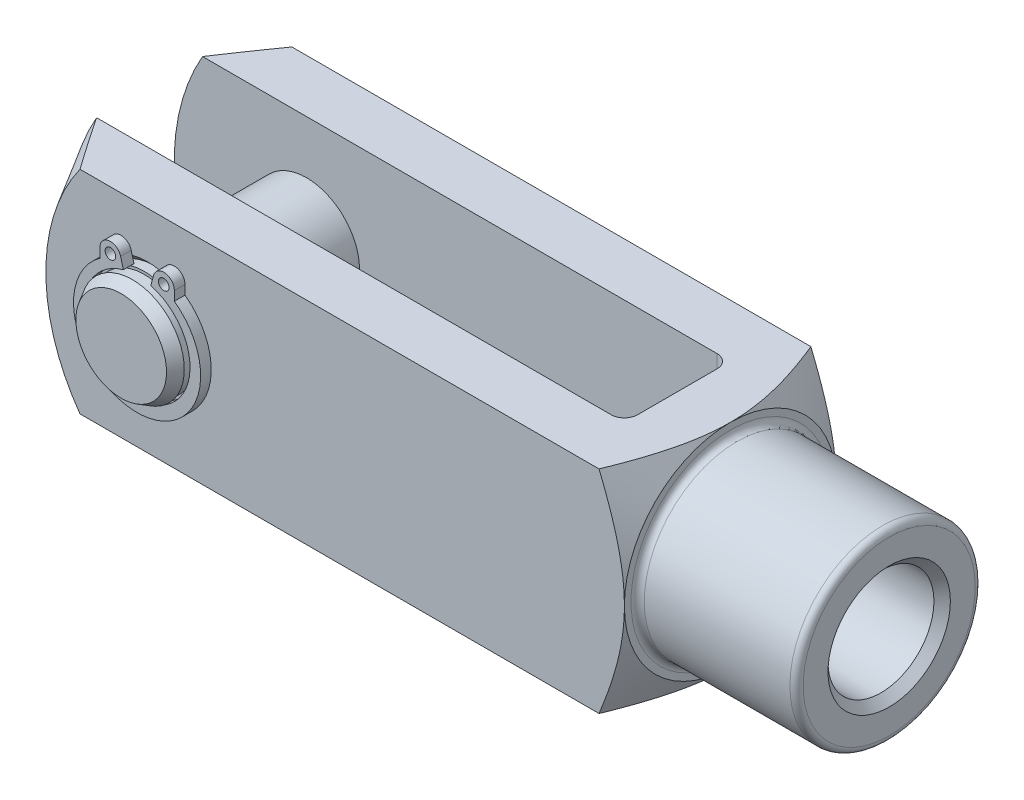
ISO-10303-21;
HEADER;
FILE_DESCRIPTION(('STEP AP214'),'2;1');
FILE_NAME('part.step','',(''),(''),'','','');
FILE_SCHEMA(('AUTOMOTIVE_DESIGN { 1 0 10303 214 1 1 1 1 }'));
ENDSEC;
DATA;
#1=APPLICATION_CONTEXT('core data for automotive mechanical design processes');
#2=APPLICATION_PROTOCOL_DEFINITION('international standard','automotive_design',2000,#1);
#3=PRODUCT_CONTEXT('',#1,'mechanical');
#4=PRODUCT('Part','Part','',(#3));
#5=PRODUCT_RELATED_PRODUCT_CATEGORY('part','',(#4));
#6=PRODUCT_DEFINITION_FORMATION('','',#4);
#7=PRODUCT_DEFINITION_CONTEXT('part definition',#1,'design');
#8=PRODUCT_DEFINITION('design','',#6,#7);
#9=PRODUCT_DEFINITION_SHAPE('','',#8);
#10=(LENGTH_UNIT() NAMED_UNIT(*) SI_UNIT(.MILLI.,.METRE.));
#11=(NAMED_UNIT(*) PLANE_ANGLE_UNIT() SI_UNIT($,.RADIAN.));
#12=(NAMED_UNIT(*) SI_UNIT($,.STERADIAN.) SOLID_ANGLE_UNIT());
#13=UNCERTAINTY_MEASURE_WITH_UNIT(LENGTH_MEASURE(1.E-05),#10,'distance_accuracy_value','');
#14=(GEOMETRIC_REPRESENTATION_CONTEXT(3) GLOBAL_UNCERTAINTY_ASSIGNED_CONTEXT((#13)) GLOBAL_UNIT_ASSIGNED_CONTEXT((#10,
#11,#12)) REPRESENTATION_CONTEXT('',''));
#15=CARTESIAN_POINT('',(0.,0.,0.));
#16=DIRECTION('',(0.,0.,1.));
#17=DIRECTION('',(1.,0.,0.));
#18=AXIS2_PLACEMENT_3D('',#15,#16,#17);
#19=CARTESIAN_POINT('',(-48.,0.,10.));
#20=DIRECTION('',(0.,0.,-1.));
#21=DIRECTION('',(-1.,0.,0.));
#22=AXIS2_PLACEMENT_3D('',#19,#20,#21);
#23=CYLINDRICAL_SURFACE('',#22,4.);
#24=CARTESIAN_POINT('',(-48.,0.,8.25));
#25=DIRECTION('',(0.,0.,1.));
#26=DIRECTION('',(1.,0.,0.));
#27=AXIS2_PLACEMENT_3D('',#24,#25,#26);
#28=CIRCLE('',#27,4.);
#29=CARTESIAN_POINT('',(-44.,0.,8.25));
#30=VERTEX_POINT('',#29);
#31=EDGE_CURVE('P0_E50',#30,#30,#28,.T.);
#32=ORIENTED_EDGE('',*,*,#31,.F.);
#33=EDGE_LOOP('',(#32));
#34=FACE_BOUND('',#33,.T.);
#35=CARTESIAN_POINT('',(-48.,0.,-8.25));
#36=DIRECTION('',(0.,0.,1.));
#37=DIRECTION('',(1.,0.,0.));
#38=AXIS2_PLACEMENT_3D('',#35,#36,#37);
#39=CIRCLE('',#38,4.);
#40=CARTESIAN_POINT('',(-44.,0.,-8.25));
#41=VERTEX_POINT('',#40);
#42=EDGE_CURVE('P0_E39',#41,#41,#39,.T.);
#43=ORIENTED_EDGE('',*,*,#42,.T.);
#44=EDGE_LOOP('',(#43));
#45=FACE_BOUND('',#44,.T.);
#46=ADVANCED_FACE('P0_F14',(#34,#45),#23,.T.);
#47=CARTESIAN_POINT('',(-48.,4.,-9.15));
#48=DIRECTION('',(0.,0.,-1.));
#49=DIRECTION('',(-1.,0.,0.));
#50=AXIS2_PLACEMENT_3D('',#47,#48,#49);
#51=PLANE('',#50);
#52=CARTESIAN_POINT('',(-48.,0.,-9.15));
#53=DIRECTION('',(0.,0.,-1.));
#54=DIRECTION('',(-1.,0.,0.));
#55=AXIS2_PLACEMENT_3D('',#52,#53,#54);
#56=CIRCLE('',#55,3.91339745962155);
#57=CARTESIAN_POINT('',(-51.9133974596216,0.,-9.15));
#58=VERTEX_POINT('',#57);
#59=EDGE_CURVE('P0_E27',#58,#58,#56,.F.);
#60=ORIENTED_EDGE('',*,*,#59,.T.);
#61=EDGE_LOOP('',(#60));
#62=FACE_BOUND('',#61,.T.);
#63=CARTESIAN_POINT('',(-48.,0.,-9.15));
#64=DIRECTION('',(0.,0.,1.));
#65=DIRECTION('',(1.,0.,0.));
#66=AXIS2_PLACEMENT_3D('',#63,#64,#65);
#67=CIRCLE('',#66,3.8);
#68=CARTESIAN_POINT('',(-44.2,0.,-9.15));
#69=VERTEX_POINT('',#68);
#70=EDGE_CURVE('P0_E31',#69,#69,#67,.T.);
#71=ORIENTED_EDGE('',*,*,#70,.F.);
#72=EDGE_LOOP('',(#71));
#73=FACE_BOUND('',#72,.T.);
#74=ADVANCED_FACE('P0_F58',(#62,#73),#51,.F.);
#75=CARTESIAN_POINT('',(-48.,0.,8.99999999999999));
#76=DIRECTION('',(0.,0.,1.));
#77=DIRECTION('',(1.,0.,0.));
#78=AXIS2_PLACEMENT_3D('',#75,#76,#77);
#79=CYLINDRICAL_SURFACE('',#78,3.8);
#80=CARTESIAN_POINT('',(-48.,0.,-8.25));
#81=DIRECTION('',(0.,0.,1.));
#82=DIRECTION('',(1.,0.,0.));
#83=AXIS2_PLACEMENT_3D('',#80,#81,#82);
#84=CIRCLE('',#83,3.8);
#85=CARTESIAN_POINT('',(-44.2,0.,-8.25));
#86=VERTEX_POINT('',#85);
#87=EDGE_CURVE('P0_E35',#86,#86,#84,.T.);
#88=ORIENTED_EDGE('',*,*,#87,.F.);
#89=EDGE_LOOP('',(#88));
#90=FACE_BOUND('',#89,.T.);
#91=ORIENTED_EDGE('',*,*,#70,.T.);
#92=EDGE_LOOP('',(#91));
#93=FACE_BOUND('',#92,.T.);
#94=ADVANCED_FACE('P0_F66',(#90,#93),#79,.T.);
#95=CARTESIAN_POINT('',(-48.,4.,-8.25));
#96=DIRECTION('',(0.,0.,1.));
#97=DIRECTION('',(1.,0.,0.));
#98=AXIS2_PLACEMENT_3D('',#95,#96,#97);
#99=PLANE('',#98);
#100=ORIENTED_EDGE('',*,*,#42,.F.);
#101=EDGE_LOOP('',(#100));
#102=FACE_BOUND('',#101,.T.);
#103=ORIENTED_EDGE('',*,*,#87,.T.);
#104=EDGE_LOOP('',(#103));
#105=FACE_BOUND('',#104,.T.);
#106=ADVANCED_FACE('P0_F62',(#102,#105),#99,.F.);
#107=CARTESIAN_POINT('',(-48.,0.,-10.));
#108=DIRECTION('',(0.,0.,1.));
#109=DIRECTION('',(1.,0.,0.));
#110=AXIS2_PLACEMENT_3D('',#107,#108,#109);
#111=PLANE('',#110);
#112=CARTESIAN_POINT('',(-48.,0.,-10.));
#113=DIRECTION('',(0.,0.,1.));
#114=DIRECTION('',(1.,0.,0.));
#115=AXIS2_PLACEMENT_3D('',#112,#113,#114);
#116=CIRCLE('',#115,3.42264973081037);
#117=CARTESIAN_POINT('',(-44.5773502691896,0.,-10.));
#118=VERTEX_POINT('',#117);
#119=EDGE_CURVE('P0_E22',#118,#118,#116,.F.);
#120=ORIENTED_EDGE('',*,*,#119,.T.);
#121=EDGE_LOOP('',(#120));
#122=FACE_BOUND('',#121,.T.);
#123=ADVANCED_FACE('P0_F65',(#122),#111,.F.);
#124=CARTESIAN_POINT('',(-48.,0.,-8.99999999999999));
#125=DIRECTION('',(0.,0.,1.));
#126=DIRECTION('',(1.,0.,0.));
#127=AXIS2_PLACEMENT_3D('',#124,#125,#126);
#128=CONICAL_SURFACE('',#127,4.,0.523598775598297);
#129=ORIENTED_EDGE('',*,*,#59,.F.);
#130=EDGE_LOOP('',(#129));
#131=FACE_BOUND('',#130,.T.);
#132=ORIENTED_EDGE('',*,*,#119,.F.);
#133=EDGE_LOOP('',(#132));
#134=FACE_BOUND('',#133,.T.);
#135=ADVANCED_FACE('P0_F84',(#131,#134),#128,.T.);
#136=CARTESIAN_POINT('',(-48.,4.,8.25));
#137=DIRECTION('',(0.,0.,-1.));
#138=DIRECTION('',(-1.,0.,0.));
#139=AXIS2_PLACEMENT_3D('',#136,#137,#138);
#140=PLANE('',#139);
#141=CARTESIAN_POINT('',(-48.,0.,8.25));
#142=DIRECTION('',(0.,0.,1.));
#143=DIRECTION('',(1.,0.,0.));
#144=AXIS2_PLACEMENT_3D('',#141,#142,#143);
#145=CIRCLE('',#144,3.8);
#146=CARTESIAN_POINT('',(-44.2,0.,8.25));
#147=VERTEX_POINT('',#146);
#148=EDGE_CURVE('P0_E44',#147,#147,#145,.T.);
#149=ORIENTED_EDGE('',*,*,#148,.F.);
#150=EDGE_LOOP('',(#149));
#151=FACE_BOUND('',#150,.T.);
#152=ORIENTED_EDGE('',*,*,#31,.T.);
#153=EDGE_LOOP('',(#152));
#154=FACE_BOUND('',#153,.T.);
#155=ADVANCED_FACE('P0_F54',(#151,#154),#140,.F.);
#156=CARTESIAN_POINT('',(-48.,0.,8.99999999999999));
#157=DIRECTION('',(0.,0.,1.));
#158=DIRECTION('',(1.,0.,0.));
#159=AXIS2_PLACEMENT_3D('',#156,#157,#158);
#160=CYLINDRICAL_SURFACE('',#159,3.8);
#161=CARTESIAN_POINT('',(-48.,0.,9.15));
#162=DIRECTION('',(0.,0.,1.));
#163=DIRECTION('',(1.,0.,0.));
#164=AXIS2_PLACEMENT_3D('',#161,#162,#163);
#165=CIRCLE('',#164,3.8);
#166=CARTESIAN_POINT('',(-44.2,0.,9.15));
#167=VERTEX_POINT('',#166);
#168=EDGE_CURVE('P0_E47',#167,#167,#165,.T.);
#169=ORIENTED_EDGE('',*,*,#168,.F.);
#170=EDGE_LOOP('',(#169));
#171=FACE_BOUND('',#170,.T.);
#172=ORIENTED_EDGE('',*,*,#148,.T.);
#173=EDGE_LOOP('',(#172));
#174=FACE_BOUND('',#173,.T.);
#175=ADVANCED_FACE('P0_F91',(#171,#174),#160,.T.);
#176=CARTESIAN_POINT('',(-48.,4.,9.15));
#177=DIRECTION('',(0.,0.,1.));
#178=DIRECTION('',(1.,0.,0.));
#179=AXIS2_PLACEMENT_3D('',#176,#177,#178);
#180=PLANE('',#179);
#181=CARTESIAN_POINT('',(-48.,0.,9.15));
#182=DIRECTION('',(0.,0.,1.));
#183=DIRECTION('',(1.,0.,0.));
#184=AXIS2_PLACEMENT_3D('',#181,#182,#183);
#185=CIRCLE('',#184,3.91339745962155);
#186=CARTESIAN_POINT('',(-44.0866025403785,0.,9.15));
#187=VERTEX_POINT('',#186);
#188=EDGE_CURVE('P0_E18',#187,#187,#185,.F.);
#189=ORIENTED_EDGE('',*,*,#188,.T.);
#190=EDGE_LOOP('',(#189));
#191=FACE_BOUND('',#190,.T.);
#192=ORIENTED_EDGE('',*,*,#168,.T.);
#193=EDGE_LOOP('',(#192));
#194=FACE_BOUND('',#193,.T.);
#195=ADVANCED_FACE('P0_F82',(#191,#194),#180,.F.);
#196=CARTESIAN_POINT('',(-48.,0.,10.));
#197=DIRECTION('',(0.,0.,1.));
#198=DIRECTION('',(1.,0.,0.));
#199=AXIS2_PLACEMENT_3D('',#196,#197,#198);
#200=PLANE('',#199);
#201=CARTESIAN_POINT('',(-48.,0.,10.));
#202=DIRECTION('',(0.,0.,1.));
#203=DIRECTION('',(1.,0.,0.));
#204=AXIS2_PLACEMENT_3D('',#201,#202,#203);
#205=CIRCLE('',#204,3.42264973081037);
#206=CARTESIAN_POINT('',(-44.5773502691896,0.,10.));
#207=VERTEX_POINT('',#206);
#208=EDGE_CURVE('P0_E10',#207,#207,#205,.T.);
#209=ORIENTED_EDGE('',*,*,#208,.T.);
#210=EDGE_LOOP('',(#209));
#211=FACE_BOUND('',#210,.T.);
#212=ADVANCED_FACE('P0_F79',(#211),#200,.T.);
#213=CARTESIAN_POINT('',(-48.,0.,10.));
#214=DIRECTION('',(0.,0.,-1.));
#215=DIRECTION('',(-1.,0.,0.));
#216=AXIS2_PLACEMENT_3D('',#213,#214,#215);
#217=CONICAL_SURFACE('',#216,3.42264973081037,0.523598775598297);
#218=ORIENTED_EDGE('',*,*,#188,.F.);
#219=EDGE_LOOP('',(#218));
#220=FACE_BOUND('',#219,.T.);
#221=ORIENTED_EDGE('',*,*,#208,.F.);
#222=EDGE_LOOP('',(#221));
#223=FACE_BOUND('',#222,.T.);
#224=ADVANCED_FACE('P0_F16',(#220,#223),#217,.T.);
#225=CLOSED_SHELL('',(#46,#74,#94,#106,#123,#135,#155,#175,#195,#212,#224));
#226=MANIFOLD_SOLID_BREP('P0_B1',#225);
#227=CARTESIAN_POINT('',(-48.,0.,8.79999999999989));
#228=DIRECTION('',(0.,0.,1.));
#229=DIRECTION('',(1.,0.,0.));
#230=AXIS2_PLACEMENT_3D('',#227,#228,#229);
#231=PLANE('',#230);
#232=CARTESIAN_POINT('',(-50.0150720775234,4.42938873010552,8.79999999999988));
#233=DIRECTION('',(0.,0.,1.));
#234=DIRECTION('',(1.,0.,0.));
#235=AXIS2_PLACEMENT_3D('',#232,#233,#234);
#236=CIRCLE('',#235,0.4);
#237=CARTESIAN_POINT('',(-49.6150720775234,4.42938873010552,8.79999999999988));
#238=VERTEX_POINT('',#237);
#239=EDGE_CURVE('P1_E117',#238,#238,#236,.T.);
#240=ORIENTED_EDGE('',*,*,#239,.F.);
#241=EDGE_LOOP('',(#240));
#242=FACE_BOUND('',#241,.T.);
#243=CARTESIAN_POINT('',(-48.,0.,8.79999999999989));
#244=DIRECTION('',(0.,0.,-1.));
#245=DIRECTION('',(1.,0.,0.));
#246=AXIS2_PLACEMENT_3D('',#243,#244,#245);
#247=CIRCLE('',#246,4.);
#248=CARTESIAN_POINT('',(-46.9647238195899,3.86370330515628,8.79999999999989));
#249=VERTEX_POINT('',#248);
#250=CARTESIAN_POINT('',(-49.0352761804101,3.86370330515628,8.79999999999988));
#251=VERTEX_POINT('',#250);
#252=EDGE_CURVE('P1_E128',#249,#251,#247,.T.);
#253=ORIENTED_EDGE('',*,*,#252,.T.);
#254=DIRECTION('',(-0.258819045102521,0.965925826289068,0.));
#255=VECTOR('',#254,1.);
#256=CARTESIAN_POINT('',(-49.0352761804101,3.86370330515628,8.79999999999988));
#257=LINE('',#256,#255);
#258=CARTESIAN_POINT('',(-49.2423314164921,4.63644396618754,8.79999999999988));
#259=VERTEX_POINT('',#258);
#260=EDGE_CURVE('P1_E76',#251,#259,#257,.T.);
#261=ORIENTED_EDGE('',*,*,#260,.T.);
#262=CARTESIAN_POINT('',(-50.0150720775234,4.42938873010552,8.79999999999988));
#263=DIRECTION('',(0.,0.,1.));
#264=DIRECTION('',(1.,0.,0.));
#265=AXIS2_PLACEMENT_3D('',#262,#263,#264);
#266=CIRCLE('',#265,0.8);
#267=CARTESIAN_POINT('',(-50.8150720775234,4.42938873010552,8.79999999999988));
#268=VERTEX_POINT('',#267);
#269=EDGE_CURVE('P1_E143',#259,#268,#266,.T.);
#270=ORIENTED_EDGE('',*,*,#269,.T.);
#271=DIRECTION('',(0.,-1.,0.));
#272=VECTOR('',#271,1.);
#273=CARTESIAN_POINT('',(-50.8150720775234,4.42938873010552,8.79999999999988));
#274=LINE('',#273,#272);
#275=CARTESIAN_POINT('',(-50.8150720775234,3.72784891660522,8.79999999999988));
#276=VERTEX_POINT('',#275);
#277=EDGE_CURVE('P1_E156',#268,#276,#274,.T.);
#278=ORIENTED_EDGE('',*,*,#277,.T.);
#279=CARTESIAN_POINT('',(-48.,-0.159999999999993,8.79999999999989));
#280=DIRECTION('',(0.,0.,1.));
#281=DIRECTION('',(1.,0.,0.));
#282=AXIS2_PLACEMENT_3D('',#279,#280,#281);
#283=CIRCLE('',#282,4.8);
#284=CARTESIAN_POINT('',(-45.1849279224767,3.72784891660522,8.7999999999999));
#285=VERTEX_POINT('',#284);
#286=EDGE_CURVE('P1_E95',#276,#285,#283,.T.);
#287=ORIENTED_EDGE('',*,*,#286,.T.);
#288=DIRECTION('',(0.,1.,0.));
#289=VECTOR('',#288,1.);
#290=CARTESIAN_POINT('',(-45.1849279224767,4.42938873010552,8.7999999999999));
#291=LINE('',#290,#289);
#292=CARTESIAN_POINT('',(-45.1849279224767,4.42938873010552,8.7999999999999));
#293=VERTEX_POINT('',#292);
#294=EDGE_CURVE('P1_E89',#285,#293,#291,.T.);
#295=ORIENTED_EDGE('',*,*,#294,.T.);
#296=CARTESIAN_POINT('',(-45.9849279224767,4.42938873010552,8.79999999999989));
#297=DIRECTION('',(0.,0.,1.));
#298=DIRECTION('',(-1.,0.,0.));
#299=AXIS2_PLACEMENT_3D('',#296,#297,#298);
#300=CIRCLE('',#299,0.8);
#301=CARTESIAN_POINT('',(-46.7576685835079,4.63644396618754,8.79999999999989));
#302=VERTEX_POINT('',#301);
#303=EDGE_CURVE('P1_E93',#293,#302,#300,.T.);
#304=ORIENTED_EDGE('',*,*,#303,.T.);
#305=DIRECTION('',(-0.258819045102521,-0.965925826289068,0.));
#306=VECTOR('',#305,1.);
#307=CARTESIAN_POINT('',(-46.9647238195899,3.86370330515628,8.79999999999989));
#308=LINE('',#307,#306);
#309=EDGE_CURVE('P1_E33',#302,#249,#308,.T.);
#310=ORIENTED_EDGE('',*,*,#309,.T.);
#311=EDGE_LOOP('',(#253,#261,#270,#278,#287,#295,#304,#310));
#312=FACE_BOUND('',#311,.T.);
#313=CARTESIAN_POINT('',(-45.9849279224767,4.42938873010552,8.79999999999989));
#314=DIRECTION('',(0.,0.,1.));
#315=DIRECTION('',(-1.,0.,0.));
#316=AXIS2_PLACEMENT_3D('',#313,#314,#315);
#317=CIRCLE('',#316,0.4);
#318=CARTESIAN_POINT('',(-46.3849279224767,4.42938873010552,8.79999999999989));
#319=VERTEX_POINT('',#318);
#320=EDGE_CURVE('P1_E165',#319,#319,#317,.T.);
#321=ORIENTED_EDGE('',*,*,#320,.F.);
#322=EDGE_LOOP('',(#321));
#323=FACE_BOUND('',#322,.T.);
#324=ADVANCED_FACE('P1_F16',(#242,#312,#323),#231,.T.);
#325=CARTESIAN_POINT('',(-48.,0.,7.99999999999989));
#326=DIRECTION('',(0.,0.,1.));
#327=DIRECTION('',(1.,0.,0.));
#328=AXIS2_PLACEMENT_3D('',#325,#326,#327);
#329=PLANE('',#328);
#330=CARTESIAN_POINT('',(-50.0150720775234,4.42938873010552,7.99999999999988));
#331=DIRECTION('',(0.,0.,1.));
#332=DIRECTION('',(1.,0.,0.));
#333=AXIS2_PLACEMENT_3D('',#330,#331,#332);
#334=CIRCLE('',#333,0.4);
#335=CARTESIAN_POINT('',(-49.6150720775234,4.42938873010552,7.99999999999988));
#336=VERTEX_POINT('',#335);
#337=EDGE_CURVE('P1_E162',#336,#336,#334,.T.);
#338=ORIENTED_EDGE('',*,*,#337,.T.);
#339=EDGE_LOOP('',(#338));
#340=FACE_BOUND('',#339,.T.);
#341=CARTESIAN_POINT('',(-48.,0.,7.99999999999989));
#342=DIRECTION('',(0.,0.,-1.));
#343=DIRECTION('',(1.,0.,0.));
#344=AXIS2_PLACEMENT_3D('',#341,#342,#343);
#345=CIRCLE('',#344,4.);
#346=CARTESIAN_POINT('',(-46.9647238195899,3.86370330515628,7.99999999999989));
#347=VERTEX_POINT('',#346);
#348=CARTESIAN_POINT('',(-49.0352761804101,3.86370330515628,7.99999999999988));
#349=VERTEX_POINT('',#348);
#350=EDGE_CURVE('P1_E113',#347,#349,#345,.T.);
#351=ORIENTED_EDGE('',*,*,#350,.F.);
#352=DIRECTION('',(-0.258819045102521,-0.965925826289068,0.));
#353=VECTOR('',#352,1.);
#354=CARTESIAN_POINT('',(-46.9647238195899,3.86370330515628,7.99999999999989));
#355=LINE('',#354,#353);
#356=CARTESIAN_POINT('',(-46.7576685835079,4.63644396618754,7.99999999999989));
#357=VERTEX_POINT('',#356);
#358=EDGE_CURVE('P1_E68',#357,#347,#355,.T.);
#359=ORIENTED_EDGE('',*,*,#358,.F.);
#360=CARTESIAN_POINT('',(-45.9849279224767,4.42938873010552,7.99999999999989));
#361=DIRECTION('',(0.,0.,1.));
#362=DIRECTION('',(-1.,0.,0.));
#363=AXIS2_PLACEMENT_3D('',#360,#361,#362);
#364=CIRCLE('',#363,0.8);
#365=CARTESIAN_POINT('',(-45.1849279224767,4.42938873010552,7.9999999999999));
#366=VERTEX_POINT('',#365);
#367=EDGE_CURVE('P1_E62',#366,#357,#364,.T.);
#368=ORIENTED_EDGE('',*,*,#367,.F.);
#369=DIRECTION('',(0.,1.,0.));
#370=VECTOR('',#369,1.);
#371=CARTESIAN_POINT('',(-45.1849279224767,4.42938873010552,7.9999999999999));
#372=LINE('',#371,#370);
#373=CARTESIAN_POINT('',(-45.1849279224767,3.72784891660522,7.9999999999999));
#374=VERTEX_POINT('',#373);
#375=EDGE_CURVE('P1_E103',#374,#366,#372,.T.);
#376=ORIENTED_EDGE('',*,*,#375,.F.);
#377=CARTESIAN_POINT('',(-48.,-0.159999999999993,7.99999999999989));
#378=DIRECTION('',(0.,0.,1.));
#379=DIRECTION('',(1.,0.,0.));
#380=AXIS2_PLACEMENT_3D('',#377,#378,#379);
#381=CIRCLE('',#380,4.8);
#382=CARTESIAN_POINT('',(-50.8150720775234,3.72784891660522,7.99999999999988));
#383=VERTEX_POINT('',#382);
#384=EDGE_CURVE('P1_E123',#383,#374,#381,.T.);
#385=ORIENTED_EDGE('',*,*,#384,.F.);
#386=DIRECTION('',(0.,-1.,0.));
#387=VECTOR('',#386,1.);
#388=CARTESIAN_POINT('',(-50.8150720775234,4.42938873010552,7.99999999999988));
#389=LINE('',#388,#387);
#390=CARTESIAN_POINT('',(-50.8150720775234,4.42938873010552,7.99999999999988));
#391=VERTEX_POINT('',#390);
#392=EDGE_CURVE('P1_E121',#391,#383,#389,.T.);
#393=ORIENTED_EDGE('',*,*,#392,.F.);
#394=CARTESIAN_POINT('',(-50.0150720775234,4.42938873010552,7.99999999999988));
#395=DIRECTION('',(0.,0.,1.));
#396=DIRECTION('',(1.,0.,0.));
#397=AXIS2_PLACEMENT_3D('',#394,#395,#396);
#398=CIRCLE('',#397,0.8);
#399=CARTESIAN_POINT('',(-49.2423314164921,4.63644396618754,7.99999999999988));
#400=VERTEX_POINT('',#399);
#401=EDGE_CURVE('P1_E119',#400,#391,#398,.T.);
#402=ORIENTED_EDGE('',*,*,#401,.F.);
#403=DIRECTION('',(-0.258819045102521,0.965925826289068,0.));
#404=VECTOR('',#403,1.);
#405=CARTESIAN_POINT('',(-49.0352761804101,3.86370330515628,7.99999999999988));
#406=LINE('',#405,#404);
#407=EDGE_CURVE('P1_E116',#349,#400,#406,.T.);
#408=ORIENTED_EDGE('',*,*,#407,.F.);
#409=EDGE_LOOP('',(#351,#359,#368,#376,#385,#393,#402,#408));
#410=FACE_BOUND('',#409,.T.);
#411=CARTESIAN_POINT('',(-45.9849279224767,4.42938873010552,7.99999999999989));
#412=DIRECTION('',(0.,0.,1.));
#413=DIRECTION('',(-1.,0.,0.));
#414=AXIS2_PLACEMENT_3D('',#411,#412,#413);
#415=CIRCLE('',#414,0.4);
#416=CARTESIAN_POINT('',(-46.3849279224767,4.42938873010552,7.99999999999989));
#417=VERTEX_POINT('',#416);
#418=EDGE_CURVE('P1_E168',#417,#417,#415,.T.);
#419=ORIENTED_EDGE('',*,*,#418,.T.);
#420=EDGE_LOOP('',(#419));
#421=FACE_BOUND('',#420,.T.);
#422=ADVANCED_FACE('P1_F147',(#340,#410,#421),#329,.F.);
#423=CARTESIAN_POINT('',(-48.,0.,8.79999999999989));
#424=DIRECTION('',(0.,0.,-1.));
#425=DIRECTION('',(-1.,0.,0.));
#426=AXIS2_PLACEMENT_3D('',#423,#424,#425);
#427=CYLINDRICAL_SURFACE('',#426,4.);
#428=ORIENTED_EDGE('',*,*,#350,.T.);
#429=DIRECTION('',(0.,0.,-1.));
#430=VECTOR('',#429,1.);
#431=CARTESIAN_POINT('',(-49.0352761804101,3.86370330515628,8.79999999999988));
#432=LINE('',#431,#430);
#433=EDGE_CURVE('P1_E11',#251,#349,#432,.T.);
#434=ORIENTED_EDGE('',*,*,#433,.F.);
#435=ORIENTED_EDGE('',*,*,#252,.F.);
#436=DIRECTION('',(0.,0.,-1.));
#437=VECTOR('',#436,1.);
#438=CARTESIAN_POINT('',(-46.9647238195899,3.86370330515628,8.79999999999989));
#439=LINE('',#438,#437);
#440=EDGE_CURVE('P1_E109',#249,#347,#439,.T.);
#441=ORIENTED_EDGE('',*,*,#440,.T.);
#442=EDGE_LOOP('',(#428,#434,#435,#441));
#443=FACE_BOUND('',#442,.T.);
#444=ADVANCED_FACE('P1_F18',(#443),#427,.F.);
#445=CARTESIAN_POINT('',(-49.0352761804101,3.86370330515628,8.79999999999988));
#446=DIRECTION('',(-0.965925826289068,-0.258819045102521,0.));
#447=DIRECTION('',(0.258819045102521,-0.965925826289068,0.));
#448=AXIS2_PLACEMENT_3D('',#445,#446,#447);
#449=PLANE('',#448);
#450=ORIENTED_EDGE('',*,*,#407,.T.);
#451=DIRECTION('',(0.,0.,-1.));
#452=VECTOR('',#451,1.);
#453=CARTESIAN_POINT('',(-49.2423314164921,4.63644396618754,8.79999999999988));
#454=LINE('',#453,#452);
#455=EDGE_CURVE('P1_E25',#259,#400,#454,.T.);
#456=ORIENTED_EDGE('',*,*,#455,.F.);
#457=ORIENTED_EDGE('',*,*,#260,.F.);
#458=ORIENTED_EDGE('',*,*,#433,.T.);
#459=EDGE_LOOP('',(#450,#456,#457,#458));
#460=FACE_BOUND('',#459,.T.);
#461=ADVANCED_FACE('P1_F202',(#460),#449,.F.);
#462=CARTESIAN_POINT('',(-50.0150720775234,4.42938873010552,8.79999999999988));
#463=DIRECTION('',(0.,0.,-1.));
#464=DIRECTION('',(-1.,0.,0.));
#465=AXIS2_PLACEMENT_3D('',#462,#463,#464);
#466=CYLINDRICAL_SURFACE('',#465,0.8);
#467=ORIENTED_EDGE('',*,*,#401,.T.);
#468=DIRECTION('',(0.,0.,-1.));
#469=VECTOR('',#468,1.);
#470=CARTESIAN_POINT('',(-50.8150720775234,4.42938873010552,8.79999999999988));
#471=LINE('',#470,#469);
#472=EDGE_CURVE('P1_E135',#268,#391,#471,.T.);
#473=ORIENTED_EDGE('',*,*,#472,.F.);
#474=ORIENTED_EDGE('',*,*,#269,.F.);
#475=ORIENTED_EDGE('',*,*,#455,.T.);
#476=EDGE_LOOP('',(#467,#473,#474,#475));
#477=FACE_BOUND('',#476,.T.);
#478=ADVANCED_FACE('P1_F141',(#477),#466,.T.);
#479=CARTESIAN_POINT('',(-50.8150720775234,4.42938873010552,8.79999999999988));
#480=DIRECTION('',(1.,0.,0.));
#481=DIRECTION('',(0.,1.,0.));
#482=AXIS2_PLACEMENT_3D('',#479,#480,#481);
#483=PLANE('',#482);
#484=ORIENTED_EDGE('',*,*,#392,.T.);
#485=DIRECTION('',(0.,0.,-1.));
#486=VECTOR('',#485,1.);
#487=CARTESIAN_POINT('',(-50.8150720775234,3.72784891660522,8.79999999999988));
#488=LINE('',#487,#486);
#489=EDGE_CURVE('P1_E132',#276,#383,#488,.T.);
#490=ORIENTED_EDGE('',*,*,#489,.F.);
#491=ORIENTED_EDGE('',*,*,#277,.F.);
#492=ORIENTED_EDGE('',*,*,#472,.T.);
#493=EDGE_LOOP('',(#484,#490,#491,#492));
#494=FACE_BOUND('',#493,.T.);
#495=ADVANCED_FACE('P1_F152',(#494),#483,.F.);
#496=CARTESIAN_POINT('',(-48.,-0.159999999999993,8.79999999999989));
#497=DIRECTION('',(0.,0.,-1.));
#498=DIRECTION('',(-1.,0.,0.));
#499=AXIS2_PLACEMENT_3D('',#496,#497,#498);
#500=CYLINDRICAL_SURFACE('',#499,4.8);
#501=ORIENTED_EDGE('',*,*,#384,.T.);
#502=DIRECTION('',(0.,0.,-1.));
#503=VECTOR('',#502,1.);
#504=CARTESIAN_POINT('',(-45.1849279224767,3.72784891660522,8.7999999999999));
#505=LINE('',#504,#503);
#506=EDGE_CURVE('P1_E104',#285,#374,#505,.T.);
#507=ORIENTED_EDGE('',*,*,#506,.F.);
#508=ORIENTED_EDGE('',*,*,#286,.F.);
#509=ORIENTED_EDGE('',*,*,#489,.T.);
#510=EDGE_LOOP('',(#501,#507,#508,#509));
#511=FACE_BOUND('',#510,.T.);
#512=ADVANCED_FACE('P1_F155',(#511),#500,.T.);
#513=CARTESIAN_POINT('',(-45.1849279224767,4.42938873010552,8.7999999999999));
#514=DIRECTION('',(-1.,0.,0.));
#515=DIRECTION('',(0.,-1.,0.));
#516=AXIS2_PLACEMENT_3D('',#513,#514,#515);
#517=PLANE('',#516);
#518=ORIENTED_EDGE('',*,*,#375,.T.);
#519=DIRECTION('',(0.,0.,-1.));
#520=VECTOR('',#519,1.);
#521=CARTESIAN_POINT('',(-45.1849279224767,4.42938873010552,8.7999999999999));
#522=LINE('',#521,#520);
#523=EDGE_CURVE('P1_E100',#293,#366,#522,.T.);
#524=ORIENTED_EDGE('',*,*,#523,.F.);
#525=ORIENTED_EDGE('',*,*,#294,.F.);
#526=ORIENTED_EDGE('',*,*,#506,.T.);
#527=EDGE_LOOP('',(#518,#524,#525,#526));
#528=FACE_BOUND('',#527,.T.);
#529=ADVANCED_FACE('P1_F101',(#528),#517,.F.);
#530=CARTESIAN_POINT('',(-45.9849279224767,4.42938873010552,8.79999999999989));
#531=DIRECTION('',(0.,0.,-1.));
#532=DIRECTION('',(-1.,0.,0.));
#533=AXIS2_PLACEMENT_3D('',#530,#531,#532);
#534=CYLINDRICAL_SURFACE('',#533,0.8);
#535=ORIENTED_EDGE('',*,*,#367,.T.);
#536=DIRECTION('',(0.,0.,-1.));
#537=VECTOR('',#536,1.);
#538=CARTESIAN_POINT('',(-46.7576685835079,4.63644396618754,8.79999999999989));
#539=LINE('',#538,#537);
#540=EDGE_CURVE('P1_E105',#302,#357,#539,.T.);
#541=ORIENTED_EDGE('',*,*,#540,.F.);
#542=ORIENTED_EDGE('',*,*,#303,.F.);
#543=ORIENTED_EDGE('',*,*,#523,.T.);
#544=EDGE_LOOP('',(#535,#541,#542,#543));
#545=FACE_BOUND('',#544,.T.);
#546=ADVANCED_FACE('P1_F107',(#545),#534,.T.);
#547=CARTESIAN_POINT('',(-46.9647238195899,3.86370330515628,8.79999999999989));
#548=DIRECTION('',(0.965925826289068,-0.258819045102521,0.));
#549=DIRECTION('',(0.258819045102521,0.965925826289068,0.));
#550=AXIS2_PLACEMENT_3D('',#547,#548,#549);
#551=PLANE('',#550);
#552=ORIENTED_EDGE('',*,*,#358,.T.);
#553=ORIENTED_EDGE('',*,*,#440,.F.);
#554=ORIENTED_EDGE('',*,*,#309,.F.);
#555=ORIENTED_EDGE('',*,*,#540,.T.);
#556=EDGE_LOOP('',(#552,#553,#554,#555));
#557=FACE_BOUND('',#556,.T.);
#558=ADVANCED_FACE('P1_F190',(#557),#551,.F.);
#559=CARTESIAN_POINT('',(-50.0150720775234,4.42938873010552,8.79999999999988));
#560=DIRECTION('',(0.,0.,-1.));
#561=DIRECTION('',(-1.,0.,0.));
#562=AXIS2_PLACEMENT_3D('',#559,#560,#561);
#563=CYLINDRICAL_SURFACE('',#562,0.4);
#564=ORIENTED_EDGE('',*,*,#239,.T.);
#565=EDGE_LOOP('',(#564));
#566=FACE_BOUND('',#565,.T.);
#567=ORIENTED_EDGE('',*,*,#337,.F.);
#568=EDGE_LOOP('',(#567));
#569=FACE_BOUND('',#568,.T.);
#570=ADVANCED_FACE('P1_F187',(#566,#569),#563,.F.);
#571=CARTESIAN_POINT('',(-45.9849279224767,4.42938873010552,8.79999999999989));
#572=DIRECTION('',(0.,0.,-1.));
#573=DIRECTION('',(-1.,0.,0.));
#574=AXIS2_PLACEMENT_3D('',#571,#572,#573);
#575=CYLINDRICAL_SURFACE('',#574,0.4);
#576=ORIENTED_EDGE('',*,*,#320,.T.);
#577=EDGE_LOOP('',(#576));
#578=FACE_BOUND('',#577,.T.);
#579=ORIENTED_EDGE('',*,*,#418,.F.);
#580=EDGE_LOOP('',(#579));
#581=FACE_BOUND('',#580,.T.);
#582=ADVANCED_FACE('P1_F174',(#578,#581),#575,.F.);
#583=CLOSED_SHELL('',(#324,#422,#444,#461,#478,#495,#512,#529,#546,#558,#570,#582));
#584=MANIFOLD_SOLID_BREP('P1_B1',#583);
#585=CARTESIAN_POINT('',(-48.,0.,-8.79999999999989));
#586=DIRECTION('',(0.,0.,-1.));
#587=DIRECTION('',(-1.,0.,0.));
#588=AXIS2_PLACEMENT_3D('',#585,#586,#587);
#589=PLANE('',#588);
#590=CARTESIAN_POINT('',(-45.9849279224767,4.42938873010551,-8.7999999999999));
#591=DIRECTION('',(0.,0.,-1.));
#592=DIRECTION('',(-1.,0.,0.));
#593=AXIS2_PLACEMENT_3D('',#590,#591,#592);
#594=CIRCLE('',#593,0.4);
#595=CARTESIAN_POINT('',(-46.3849279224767,4.42938873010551,-8.7999999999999));
#596=VERTEX_POINT('',#595);
#597=EDGE_CURVE('P2_E117',#596,#596,#594,.T.);
#598=ORIENTED_EDGE('',*,*,#597,.F.);
#599=EDGE_LOOP('',(#598));
#600=FACE_BOUND('',#599,.T.);
#601=CARTESIAN_POINT('',(-48.,0.,-8.79999999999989));
#602=DIRECTION('',(0.,0.,1.));
#603=DIRECTION('',(-1.,0.,0.));
#604=AXIS2_PLACEMENT_3D('',#601,#602,#603);
#605=CIRCLE('',#604,4.);
#606=CARTESIAN_POINT('',(-49.0352761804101,3.86370330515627,-8.79999999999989));
#607=VERTEX_POINT('',#606);
#608=CARTESIAN_POINT('',(-46.9647238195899,3.86370330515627,-8.7999999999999));
#609=VERTEX_POINT('',#608);
#610=EDGE_CURVE('P2_E128',#607,#609,#605,.T.);
#611=ORIENTED_EDGE('',*,*,#610,.T.);
#612=DIRECTION('',(0.258819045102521,0.965925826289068,0.));
#613=VECTOR('',#612,1.);
#614=CARTESIAN_POINT('',(-46.9647238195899,3.86370330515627,-8.7999999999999));
#615=LINE('',#614,#613);
#616=CARTESIAN_POINT('',(-46.7576685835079,4.63644396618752,-8.7999999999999));
#617=VERTEX_POINT('',#616);
#618=EDGE_CURVE('P2_E76',#609,#617,#615,.T.);
#619=ORIENTED_EDGE('',*,*,#618,.T.);
#620=CARTESIAN_POINT('',(-45.9849279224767,4.42938873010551,-8.7999999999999));
#621=DIRECTION('',(0.,0.,-1.));
#622=DIRECTION('',(-1.,0.,0.));
#623=AXIS2_PLACEMENT_3D('',#620,#621,#622);
#624=CIRCLE('',#623,0.8);
#625=CARTESIAN_POINT('',(-45.1849279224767,4.42938873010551,-8.7999999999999));
#626=VERTEX_POINT('',#625);
#627=EDGE_CURVE('P2_E143',#617,#626,#624,.T.);
#628=ORIENTED_EDGE('',*,*,#627,.T.);
#629=DIRECTION('',(0.,-1.,0.));
#630=VECTOR('',#629,1.);
#631=CARTESIAN_POINT('',(-45.1849279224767,4.42938873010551,-8.7999999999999));
#632=LINE('',#631,#630);
#633=CARTESIAN_POINT('',(-45.1849279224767,3.72784891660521,-8.7999999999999));
#634=VERTEX_POINT('',#633);
#635=EDGE_CURVE('P2_E156',#626,#634,#632,.T.);
#636=ORIENTED_EDGE('',*,*,#635,.T.);
#637=CARTESIAN_POINT('',(-48.,-0.160000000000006,-8.79999999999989));
#638=DIRECTION('',(0.,0.,-1.));
#639=DIRECTION('',(-1.,0.,0.));
#640=AXIS2_PLACEMENT_3D('',#637,#638,#639);
#641=CIRCLE('',#640,4.8);
#642=CARTESIAN_POINT('',(-50.8150720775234,3.72784891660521,-8.79999999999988));
#643=VERTEX_POINT('',#642);
#644=EDGE_CURVE('P2_E95',#634,#643,#641,.T.);
#645=ORIENTED_EDGE('',*,*,#644,.T.);
#646=DIRECTION('',(0.,1.,0.));
#647=VECTOR('',#646,1.);
#648=CARTESIAN_POINT('',(-50.8150720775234,4.42938873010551,-8.79999999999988));
#649=LINE('',#648,#647);
#650=CARTESIAN_POINT('',(-50.8150720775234,4.42938873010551,-8.79999999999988));
#651=VERTEX_POINT('',#650);
#652=EDGE_CURVE('P2_E89',#643,#651,#649,.T.);
#653=ORIENTED_EDGE('',*,*,#652,.T.);
#654=CARTESIAN_POINT('',(-50.0150720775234,4.42938873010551,-8.79999999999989));
#655=DIRECTION('',(0.,0.,-1.));
#656=DIRECTION('',(1.,0.,0.));
#657=AXIS2_PLACEMENT_3D('',#654,#655,#656);
#658=CIRCLE('',#657,0.8);
#659=CARTESIAN_POINT('',(-49.2423314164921,4.63644396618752,-8.79999999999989));
#660=VERTEX_POINT('',#659);
#661=EDGE_CURVE('P2_E93',#651,#660,#658,.T.);
#662=ORIENTED_EDGE('',*,*,#661,.T.);
#663=DIRECTION('',(0.258819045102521,-0.965925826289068,0.));
#664=VECTOR('',#663,1.);
#665=CARTESIAN_POINT('',(-49.0352761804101,3.86370330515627,-8.79999999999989));
#666=LINE('',#665,#664);
#667=EDGE_CURVE('P2_E33',#660,#607,#666,.T.);
#668=ORIENTED_EDGE('',*,*,#667,.T.);
#669=EDGE_LOOP('',(#611,#619,#628,#636,#645,#653,#662,#668));
#670=FACE_BOUND('',#669,.T.);
#671=CARTESIAN_POINT('',(-50.0150720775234,4.42938873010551,-8.79999999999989));
#672=DIRECTION('',(0.,0.,-1.));
#673=DIRECTION('',(1.,0.,0.));
#674=AXIS2_PLACEMENT_3D('',#671,#672,#673);
#675=CIRCLE('',#674,0.4);
#676=CARTESIAN_POINT('',(-49.6150720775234,4.42938873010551,-8.79999999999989));
#677=VERTEX_POINT('',#676);
#678=EDGE_CURVE('P2_E165',#677,#677,#675,.T.);
#679=ORIENTED_EDGE('',*,*,#678,.F.);
#680=EDGE_LOOP('',(#679));
#681=FACE_BOUND('',#680,.T.);
#682=ADVANCED_FACE('P2_F16',(#600,#670,#681),#589,.T.);
#683=CARTESIAN_POINT('',(-48.,0.,-7.99999999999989));
#684=DIRECTION('',(0.,0.,-1.));
#685=DIRECTION('',(-1.,0.,0.));
#686=AXIS2_PLACEMENT_3D('',#683,#684,#685);
#687=PLANE('',#686);
#688=CARTESIAN_POINT('',(-45.9849279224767,4.42938873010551,-7.9999999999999));
#689=DIRECTION('',(0.,0.,-1.));
#690=DIRECTION('',(-1.,0.,0.));
#691=AXIS2_PLACEMENT_3D('',#688,#689,#690);
#692=CIRCLE('',#691,0.4);
#693=CARTESIAN_POINT('',(-46.3849279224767,4.42938873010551,-7.9999999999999));
#694=VERTEX_POINT('',#693);
#695=EDGE_CURVE('P2_E162',#694,#694,#692,.T.);
#696=ORIENTED_EDGE('',*,*,#695,.T.);
#697=EDGE_LOOP('',(#696));
#698=FACE_BOUND('',#697,.T.);
#699=CARTESIAN_POINT('',(-48.,0.,-7.99999999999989));
#700=DIRECTION('',(0.,0.,1.));
#701=DIRECTION('',(-1.,0.,0.));
#702=AXIS2_PLACEMENT_3D('',#699,#700,#701);
#703=CIRCLE('',#702,4.);
#704=CARTESIAN_POINT('',(-49.0352761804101,3.86370330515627,-7.99999999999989));
#705=VERTEX_POINT('',#704);
#706=CARTESIAN_POINT('',(-46.9647238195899,3.86370330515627,-7.9999999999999));
#707=VERTEX_POINT('',#706);
#708=EDGE_CURVE('P2_E113',#705,#707,#703,.T.);
#709=ORIENTED_EDGE('',*,*,#708,.F.);
#710=DIRECTION('',(0.258819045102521,-0.965925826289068,0.));
#711=VECTOR('',#710,1.);
#712=CARTESIAN_POINT('',(-49.0352761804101,3.86370330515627,-7.99999999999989));
#713=LINE('',#712,#711);
#714=CARTESIAN_POINT('',(-49.2423314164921,4.63644396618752,-7.99999999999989));
#715=VERTEX_POINT('',#714);
#716=EDGE_CURVE('P2_E68',#715,#705,#713,.T.);
#717=ORIENTED_EDGE('',*,*,#716,.F.);
#718=CARTESIAN_POINT('',(-50.0150720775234,4.42938873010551,-7.99999999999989));
#719=DIRECTION('',(0.,0.,-1.));
#720=DIRECTION('',(1.,0.,0.));
#721=AXIS2_PLACEMENT_3D('',#718,#719,#720);
#722=CIRCLE('',#721,0.8);
#723=CARTESIAN_POINT('',(-50.8150720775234,4.42938873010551,-7.99999999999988));
#724=VERTEX_POINT('',#723);
#725=EDGE_CURVE('P2_E62',#724,#715,#722,.T.);
#726=ORIENTED_EDGE('',*,*,#725,.F.);
#727=DIRECTION('',(0.,1.,0.));
#728=VECTOR('',#727,1.);
#729=CARTESIAN_POINT('',(-50.8150720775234,4.42938873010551,-7.99999999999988));
#730=LINE('',#729,#728);
#731=CARTESIAN_POINT('',(-50.8150720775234,3.72784891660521,-7.99999999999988));
#732=VERTEX_POINT('',#731);
#733=EDGE_CURVE('P2_E103',#732,#724,#730,.T.);
#734=ORIENTED_EDGE('',*,*,#733,.F.);
#735=CARTESIAN_POINT('',(-48.,-0.160000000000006,-7.99999999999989));
#736=DIRECTION('',(0.,0.,-1.));
#737=DIRECTION('',(-1.,0.,0.));
#738=AXIS2_PLACEMENT_3D('',#735,#736,#737);
#739=CIRCLE('',#738,4.8);
#740=CARTESIAN_POINT('',(-45.1849279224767,3.72784891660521,-7.9999999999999));
#741=VERTEX_POINT('',#740);
#742=EDGE_CURVE('P2_E123',#741,#732,#739,.T.);
#743=ORIENTED_EDGE('',*,*,#742,.F.);
#744=DIRECTION('',(0.,-1.,0.));
#745=VECTOR('',#744,1.);
#746=CARTESIAN_POINT('',(-45.1849279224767,4.42938873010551,-7.9999999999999));
#747=LINE('',#746,#745);
#748=CARTESIAN_POINT('',(-45.1849279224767,4.42938873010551,-7.9999999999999));
#749=VERTEX_POINT('',#748);
#750=EDGE_CURVE('P2_E121',#749,#741,#747,.T.);
#751=ORIENTED_EDGE('',*,*,#750,.F.);
#752=CARTESIAN_POINT('',(-45.9849279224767,4.42938873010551,-7.9999999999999));
#753=DIRECTION('',(0.,0.,-1.));
#754=DIRECTION('',(-1.,0.,0.));
#755=AXIS2_PLACEMENT_3D('',#752,#753,#754);
#756=CIRCLE('',#755,0.8);
#757=CARTESIAN_POINT('',(-46.7576685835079,4.63644396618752,-7.9999999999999));
#758=VERTEX_POINT('',#757);
#759=EDGE_CURVE('P2_E119',#758,#749,#756,.T.);
#760=ORIENTED_EDGE('',*,*,#759,.F.);
#761=DIRECTION('',(0.258819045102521,0.965925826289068,0.));
#762=VECTOR('',#761,1.);
#763=CARTESIAN_POINT('',(-46.9647238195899,3.86370330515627,-7.9999999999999));
#764=LINE('',#763,#762);
#765=EDGE_CURVE('P2_E116',#707,#758,#764,.T.);
#766=ORIENTED_EDGE('',*,*,#765,.F.);
#767=EDGE_LOOP('',(#709,#717,#726,#734,#743,#751,#760,#766));
#768=FACE_BOUND('',#767,.T.);
#769=CARTESIAN_POINT('',(-50.0150720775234,4.42938873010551,-7.99999999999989));
#770=DIRECTION('',(0.,0.,-1.));
#771=DIRECTION('',(1.,0.,0.));
#772=AXIS2_PLACEMENT_3D('',#769,#770,#771);
#773=CIRCLE('',#772,0.4);
#774=CARTESIAN_POINT('',(-49.6150720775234,4.42938873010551,-7.99999999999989));
#775=VERTEX_POINT('',#774);
#776=EDGE_CURVE('P2_E168',#775,#775,#773,.T.);
#777=ORIENTED_EDGE('',*,*,#776,.T.);
#778=EDGE_LOOP('',(#777));
#779=FACE_BOUND('',#778,.T.);
#780=ADVANCED_FACE('P2_F147',(#698,#768,#779),#687,.F.);
#781=CARTESIAN_POINT('',(-48.,0.,-8.79999999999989));
#782=DIRECTION('',(0.,0.,1.));
#783=DIRECTION('',(1.,0.,0.));
#784=AXIS2_PLACEMENT_3D('',#781,#782,#783);
#785=CYLINDRICAL_SURFACE('',#784,4.);
#786=ORIENTED_EDGE('',*,*,#708,.T.);
#787=DIRECTION('',(0.,0.,1.));
#788=VECTOR('',#787,1.);
#789=CARTESIAN_POINT('',(-46.9647238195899,3.86370330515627,-8.7999999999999));
#790=LINE('',#789,#788);
#791=EDGE_CURVE('P2_E11',#609,#707,#790,.T.);
#792=ORIENTED_EDGE('',*,*,#791,.F.);
#793=ORIENTED_EDGE('',*,*,#610,.F.);
#794=DIRECTION('',(0.,0.,1.));
#795=VECTOR('',#794,1.);
#796=CARTESIAN_POINT('',(-49.0352761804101,3.86370330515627,-8.79999999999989));
#797=LINE('',#796,#795);
#798=EDGE_CURVE('P2_E109',#607,#705,#797,.T.);
#799=ORIENTED_EDGE('',*,*,#798,.T.);
#800=EDGE_LOOP('',(#786,#792,#793,#799));
#801=FACE_BOUND('',#800,.T.);
#802=ADVANCED_FACE('P2_F18',(#801),#785,.F.);
#803=CARTESIAN_POINT('',(-46.9647238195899,3.86370330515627,-8.7999999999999));
#804=DIRECTION('',(0.965925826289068,-0.258819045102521,0.));
#805=DIRECTION('',(-0.258819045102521,-0.965925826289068,0.));
#806=AXIS2_PLACEMENT_3D('',#803,#804,#805);
#807=PLANE('',#806);
#808=ORIENTED_EDGE('',*,*,#765,.T.);
#809=DIRECTION('',(0.,0.,1.));
#810=VECTOR('',#809,1.);
#811=CARTESIAN_POINT('',(-46.7576685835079,4.63644396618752,-8.7999999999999));
#812=LINE('',#811,#810);
#813=EDGE_CURVE('P2_E25',#617,#758,#812,.T.);
#814=ORIENTED_EDGE('',*,*,#813,.F.);
#815=ORIENTED_EDGE('',*,*,#618,.F.);
#816=ORIENTED_EDGE('',*,*,#791,.T.);
#817=EDGE_LOOP('',(#808,#814,#815,#816));
#818=FACE_BOUND('',#817,.T.);
#819=ADVANCED_FACE('P2_F202',(#818),#807,.F.);
#820=CARTESIAN_POINT('',(-45.9849279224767,4.42938873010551,-8.7999999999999));
#821=DIRECTION('',(0.,0.,1.));
#822=DIRECTION('',(1.,0.,0.));
#823=AXIS2_PLACEMENT_3D('',#820,#821,#822);
#824=CYLINDRICAL_SURFACE('',#823,0.8);
#825=ORIENTED_EDGE('',*,*,#759,.T.);
#826=DIRECTION('',(0.,0.,1.));
#827=VECTOR('',#826,1.);
#828=CARTESIAN_POINT('',(-45.1849279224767,4.42938873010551,-8.7999999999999));
#829=LINE('',#828,#827);
#830=EDGE_CURVE('P2_E135',#626,#749,#829,.T.);
#831=ORIENTED_EDGE('',*,*,#830,.F.);
#832=ORIENTED_EDGE('',*,*,#627,.F.);
#833=ORIENTED_EDGE('',*,*,#813,.T.);
#834=EDGE_LOOP('',(#825,#831,#832,#833));
#835=FACE_BOUND('',#834,.T.);
#836=ADVANCED_FACE('P2_F141',(#835),#824,.T.);
#837=CARTESIAN_POINT('',(-45.1849279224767,4.42938873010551,-8.7999999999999));
#838=DIRECTION('',(-1.,0.,0.));
#839=DIRECTION('',(0.,1.,0.));
#840=AXIS2_PLACEMENT_3D('',#837,#838,#839);
#841=PLANE('',#840);
#842=ORIENTED_EDGE('',*,*,#750,.T.);
#843=DIRECTION('',(0.,0.,1.));
#844=VECTOR('',#843,1.);
#845=CARTESIAN_POINT('',(-45.1849279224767,3.72784891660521,-8.7999999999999));
#846=LINE('',#845,#844);
#847=EDGE_CURVE('P2_E132',#634,#741,#846,.T.);
#848=ORIENTED_EDGE('',*,*,#847,.F.);
#849=ORIENTED_EDGE('',*,*,#635,.F.);
#850=ORIENTED_EDGE('',*,*,#830,.T.);
#851=EDGE_LOOP('',(#842,#848,#849,#850));
#852=FACE_BOUND('',#851,.T.);
#853=ADVANCED_FACE('P2_F152',(#852),#841,.F.);
#854=CARTESIAN_POINT('',(-48.,-0.160000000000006,-8.79999999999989));
#855=DIRECTION('',(0.,0.,1.));
#856=DIRECTION('',(1.,0.,0.));
#857=AXIS2_PLACEMENT_3D('',#854,#855,#856);
#858=CYLINDRICAL_SURFACE('',#857,4.8);
#859=ORIENTED_EDGE('',*,*,#742,.T.);
#860=DIRECTION('',(0.,0.,1.));
#861=VECTOR('',#860,1.);
#862=CARTESIAN_POINT('',(-50.8150720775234,3.72784891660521,-8.79999999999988));
#863=LINE('',#862,#861);
#864=EDGE_CURVE('P2_E104',#643,#732,#863,.T.);
#865=ORIENTED_EDGE('',*,*,#864,.F.);
#866=ORIENTED_EDGE('',*,*,#644,.F.);
#867=ORIENTED_EDGE('',*,*,#847,.T.);
#868=EDGE_LOOP('',(#859,#865,#866,#867));
#869=FACE_BOUND('',#868,.T.);
#870=ADVANCED_FACE('P2_F155',(#869),#858,.T.);
#871=CARTESIAN_POINT('',(-50.8150720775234,4.42938873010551,-8.79999999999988));
#872=DIRECTION('',(1.,0.,0.));
#873=DIRECTION('',(0.,-1.,0.));
#874=AXIS2_PLACEMENT_3D('',#871,#872,#873);
#875=PLANE('',#874);
#876=ORIENTED_EDGE('',*,*,#733,.T.);
#877=DIRECTION('',(0.,0.,1.));
#878=VECTOR('',#877,1.);
#879=CARTESIAN_POINT('',(-50.8150720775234,4.42938873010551,-8.79999999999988));
#880=LINE('',#879,#878);
#881=EDGE_CURVE('P2_E100',#651,#724,#880,.T.);
#882=ORIENTED_EDGE('',*,*,#881,.F.);
#883=ORIENTED_EDGE('',*,*,#652,.F.);
#884=ORIENTED_EDGE('',*,*,#864,.T.);
#885=EDGE_LOOP('',(#876,#882,#883,#884));
#886=FACE_BOUND('',#885,.T.);
#887=ADVANCED_FACE('P2_F101',(#886),#875,.F.);
#888=CARTESIAN_POINT('',(-50.0150720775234,4.42938873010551,-8.79999999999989));
#889=DIRECTION('',(0.,0.,1.));
#890=DIRECTION('',(1.,0.,0.));
#891=AXIS2_PLACEMENT_3D('',#888,#889,#890);
#892=CYLINDRICAL_SURFACE('',#891,0.8);
#893=ORIENTED_EDGE('',*,*,#725,.T.);
#894=DIRECTION('',(0.,0.,1.));
#895=VECTOR('',#894,1.);
#896=CARTESIAN_POINT('',(-49.2423314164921,4.63644396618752,-8.79999999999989));
#897=LINE('',#896,#895);
#898=EDGE_CURVE('P2_E105',#660,#715,#897,.T.);
#899=ORIENTED_EDGE('',*,*,#898,.F.);
#900=ORIENTED_EDGE('',*,*,#661,.F.);
#901=ORIENTED_EDGE('',*,*,#881,.T.);
#902=EDGE_LOOP('',(#893,#899,#900,#901));
#903=FACE_BOUND('',#902,.T.);
#904=ADVANCED_FACE('P2_F107',(#903),#892,.T.);
#905=CARTESIAN_POINT('',(-49.0352761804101,3.86370330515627,-8.79999999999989));
#906=DIRECTION('',(-0.965925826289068,-0.258819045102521,0.));
#907=DIRECTION('',(-0.258819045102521,0.965925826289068,0.));
#908=AXIS2_PLACEMENT_3D('',#905,#906,#907);
#909=PLANE('',#908);
#910=ORIENTED_EDGE('',*,*,#716,.T.);
#911=ORIENTED_EDGE('',*,*,#798,.F.);
#912=ORIENTED_EDGE('',*,*,#667,.F.);
#913=ORIENTED_EDGE('',*,*,#898,.T.);
#914=EDGE_LOOP('',(#910,#911,#912,#913));
#915=FACE_BOUND('',#914,.T.);
#916=ADVANCED_FACE('P2_F190',(#915),#909,.F.);
#917=CARTESIAN_POINT('',(-45.9849279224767,4.42938873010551,-8.7999999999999));
#918=DIRECTION('',(0.,0.,1.));
#919=DIRECTION('',(1.,0.,0.));
#920=AXIS2_PLACEMENT_3D('',#917,#918,#919);
#921=CYLINDRICAL_SURFACE('',#920,0.4);
#922=ORIENTED_EDGE('',*,*,#597,.T.);
#923=EDGE_LOOP('',(#922));
#924=FACE_BOUND('',#923,.T.);
#925=ORIENTED_EDGE('',*,*,#695,.F.);
#926=EDGE_LOOP('',(#925));
#927=FACE_BOUND('',#926,.T.);
#928=ADVANCED_FACE('P2_F187',(#924,#927),#921,.F.);
#929=CARTESIAN_POINT('',(-50.0150720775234,4.42938873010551,-8.79999999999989));
#930=DIRECTION('',(0.,0.,1.));
#931=DIRECTION('',(1.,0.,0.));
#932=AXIS2_PLACEMENT_3D('',#929,#930,#931);
#933=CYLINDRICAL_SURFACE('',#932,0.4);
#934=ORIENTED_EDGE('',*,*,#678,.T.);
#935=EDGE_LOOP('',(#934));
#936=FACE_BOUND('',#935,.T.);
#937=ORIENTED_EDGE('',*,*,#776,.F.);
#938=EDGE_LOOP('',(#937));
#939=FACE_BOUND('',#938,.T.);
#940=ADVANCED_FACE('P2_F174',(#936,#939),#933,.F.);
#941=CLOSED_SHELL('',(#682,#780,#802,#819,#836,#853,#870,#887,#904,#916,#928,#940));
#942=MANIFOLD_SOLID_BREP('P2_B1',#941);
#943=CARTESIAN_POINT('',(-17.,-8.,-2.99999999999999));
#944=DIRECTION('',(0.,-1.,0.));
#945=DIRECTION('',(0.,0.,-1.));
#946=AXIS2_PLACEMENT_3D('',#943,#944,#945);
#947=CYLINDRICAL_SURFACE('',#946,1.);
#948=DIRECTION('',(0.,1.,0.));
#949=VECTOR('',#948,1.);
#950=CARTESIAN_POINT('',(-16.,-8.,-2.99999999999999));
#951=LINE('',#950,#949);
#952=CARTESIAN_POINT('',(-16.,-2.6457513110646,-2.99999999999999));
#953=VERTEX_POINT('',#952);
#954=CARTESIAN_POINT('',(-16.,-8.,-2.99999999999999));
#955=VERTEX_POINT('',#954);
#956=EDGE_CURVE('P3_E304',#953,#955,#951,.F.);
#957=ORIENTED_EDGE('',*,*,#956,.F.);
#958=CARTESIAN_POINT('',(-16.,-2.6457513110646,-2.99999999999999));
#959=CARTESIAN_POINT('',(-16.0000222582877,-2.59691643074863,-3.04308129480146));
#960=CARTESIAN_POINT('',(-16.0027813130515,-2.54706628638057,-3.08491225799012));
#961=CARTESIAN_POINT('',(-16.012996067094,-2.44577843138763,-3.1658078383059));
#962=CARTESIAN_POINT('',(-16.0204427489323,-2.39434394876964,-3.20487760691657));
#963=CARTESIAN_POINT('',(-16.0391856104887,-2.2905622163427,-3.27984708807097));
#964=CARTESIAN_POINT('',(-16.0504501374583,-2.23822572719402,-3.31576990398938));
#965=CARTESIAN_POINT('',(-16.0762500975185,-2.1324542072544,-3.38476417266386));
#966=CARTESIAN_POINT('',(-16.0907876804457,-2.07901847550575,-3.41783373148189));
#967=CARTESIAN_POINT('',(-16.1314716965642,-1.94128133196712,-3.49869690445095));
#968=CARTESIAN_POINT('',(-16.159576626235,-1.85634962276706,-3.54444475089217));
#969=CARTESIAN_POINT('',(-16.2208922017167,-1.68494910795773,-3.62906229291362));
#970=CARTESIAN_POINT('',(-16.2541046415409,-1.59847977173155,-3.66792956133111));
#971=CARTESIAN_POINT('',(-16.3598954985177,-1.33652816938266,-3.77483346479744));
#972=CARTESIAN_POINT('',(-16.4383939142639,-1.15922544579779,-3.832754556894));
#973=CARTESIAN_POINT('',(-16.5956023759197,-0.820227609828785,-3.91850936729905));
#974=CARTESIAN_POINT('',(-16.673512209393,-0.658737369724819,-3.94876568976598));
#975=CARTESIAN_POINT('',(-16.8324153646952,-0.335223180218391,-3.98924683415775));
#976=CARTESIAN_POINT('',(-16.913399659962,-0.173201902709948,-3.99952627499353));
#977=CARTESIAN_POINT('',(-16.9962288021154,-0.00754240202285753,-3.99999466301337));
#978=CARTESIAN_POINT('',(-16.9981144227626,-0.00377116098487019,-3.99999999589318));
#979=CARTESIAN_POINT('',(-17.,0.,-3.99999999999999));
#980=B_SPLINE_CURVE_WITH_KNOTS('',3,(#958,#959,#960,#961,#962,#963,#964,#965,#966,#967,#968,
#969,#970,#971,#972,#973,#974,#975,#976,#977,#978,#979),.UNSPECIFIED.,.F.,.F.,(4,2,2,2,2,2,2,2,
2,2,4),(0.,0.19519436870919,0.39001439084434,0.583257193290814,0.776627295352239,
1.07759313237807,1.3786649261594,1.98338003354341,2.52784959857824,3.07082842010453,
3.08347754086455),.UNSPECIFIED.);
#981=CARTESIAN_POINT('',(-17.,0.,-3.99999999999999));
#982=VERTEX_POINT('',#981);
#983=EDGE_CURVE('P3_E327',#953,#982,#980,.T.);
#984=ORIENTED_EDGE('',*,*,#983,.T.);
#985=DIRECTION('',(0.,1.,0.));
#986=VECTOR('',#985,1.);
#987=CARTESIAN_POINT('',(-17.,8.,-3.99999999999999));
#988=LINE('',#987,#986);
#989=CARTESIAN_POINT('',(-17.,-8.,-3.99999999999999));
#990=VERTEX_POINT('',#989);
#991=EDGE_CURVE('P3_E153',#990,#982,#988,.T.);
#992=ORIENTED_EDGE('',*,*,#991,.F.);
#993=CARTESIAN_POINT('',(-17.,-8.,-2.99999999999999));
#994=DIRECTION('',(0.,-1.,0.));
#995=DIRECTION('',(0.,0.,-1.));
#996=AXIS2_PLACEMENT_3D('',#993,#994,#995);
#997=CIRCLE('',#996,1.);
#998=EDGE_CURVE('P3_E164',#955,#990,#997,.F.);
#999=ORIENTED_EDGE('',*,*,#998,.F.);
#1000=EDGE_LOOP('',(#957,#984,#992,#999));
#1001=FACE_BOUND('',#1000,.T.);
#1002=ADVANCED_FACE('P3_F15',(#1001),#947,.F.);
#1003=CARTESIAN_POINT('',(-16.,-8.,-3.99999999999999));
#1004=DIRECTION('',(1.,0.,0.));
#1005=DIRECTION('',(0.,0.,-1.));
#1006=AXIS2_PLACEMENT_3D('',#1003,#1004,#1005);
#1007=PLANE('',#1006);
#1008=CARTESIAN_POINT('',(-16.,8.,-2.99999999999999));
#1009=VERTEX_POINT('',#1008);
#1010=CARTESIAN_POINT('',(-16.,2.6457513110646,-2.99999999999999));
#1011=VERTEX_POINT('',#1010);
#1012=EDGE_CURVE('P3_E315',#1009,#1011,#951,.F.);
#1013=ORIENTED_EDGE('',*,*,#1012,.T.);
#1014=CARTESIAN_POINT('',(-16.,0.,0.));
#1015=DIRECTION('',(1.,0.,0.));
#1016=DIRECTION('',(0.,0.,-1.));
#1017=AXIS2_PLACEMENT_3D('',#1014,#1015,#1016);
#1018=CIRCLE('',#1017,4.);
#1019=CARTESIAN_POINT('',(-16.,2.6457513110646,2.99999999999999));
#1020=VERTEX_POINT('',#1019);
#1021=EDGE_CURVE('P3_E380',#1011,#1020,#1018,.T.);
#1022=ORIENTED_EDGE('',*,*,#1021,.T.);
#1023=DIRECTION('',(0.,1.,0.));
#1024=VECTOR('',#1023,1.);
#1025=CARTESIAN_POINT('',(-16.,8.,2.99999999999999));
#1026=LINE('',#1025,#1024);
#1027=CARTESIAN_POINT('',(-16.,8.,2.99999999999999));
#1028=VERTEX_POINT('',#1027);
#1029=EDGE_CURVE('P3_E136',#1020,#1028,#1026,.T.);
#1030=ORIENTED_EDGE('',*,*,#1029,.T.);
#1031=DIRECTION('',(0.,0.,-1.));
#1032=VECTOR('',#1031,1.);
#1033=CARTESIAN_POINT('',(-16.,8.,-3.99999999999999));
#1034=LINE('',#1033,#1032);
#1035=EDGE_CURVE('P3_E290',#1028,#1009,#1034,.T.);
#1036=ORIENTED_EDGE('',*,*,#1035,.T.);
#1037=EDGE_LOOP('',(#1013,#1022,#1030,#1036));
#1038=FACE_BOUND('',#1037,.T.);
#1039=ADVANCED_FACE('P3_F375',(#1038),#1007,.F.);
#1040=CARTESIAN_POINT('',(-17.,-8.,2.99999999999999));
#1041=DIRECTION('',(0.,-1.,0.));
#1042=DIRECTION('',(0.,0.,-1.));
#1043=AXIS2_PLACEMENT_3D('',#1040,#1041,#1042);
#1044=CYLINDRICAL_SURFACE('',#1043,1.);
#1045=ORIENTED_EDGE('',*,*,#1029,.F.);
#1046=CARTESIAN_POINT('',(-16.,2.6457513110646,2.99999999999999));
#1047=CARTESIAN_POINT('',(-16.0000222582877,2.59691643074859,3.04308129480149));
#1048=CARTESIAN_POINT('',(-16.0027813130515,2.54706628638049,3.08491225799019));
#1049=CARTESIAN_POINT('',(-16.012996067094,2.44577843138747,3.16580783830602));
#1050=CARTESIAN_POINT('',(-16.0204427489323,2.39434394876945,3.20487760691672));
#1051=CARTESIAN_POINT('',(-16.0391856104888,2.29056221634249,3.27984708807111));
#1052=CARTESIAN_POINT('',(-16.0504501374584,2.23822572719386,3.31576990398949));
#1053=CARTESIAN_POINT('',(-16.0762500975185,2.13245420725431,3.38476417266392));
#1054=CARTESIAN_POINT('',(-16.0907876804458,2.0790184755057,3.41783373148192));
#1055=CARTESIAN_POINT('',(-16.1314716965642,1.94128133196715,3.49869690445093));
#1056=CARTESIAN_POINT('',(-16.159576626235,1.8563496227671,3.54444475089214));
#1057=CARTESIAN_POINT('',(-16.2208922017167,1.68494910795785,3.62906229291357));
#1058=CARTESIAN_POINT('',(-16.2541046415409,1.59847977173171,3.66792956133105));
#1059=CARTESIAN_POINT('',(-16.3598954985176,1.33652816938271,3.7748334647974));
#1060=CARTESIAN_POINT('',(-16.4383939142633,1.15922544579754,3.83275455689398));
#1061=CARTESIAN_POINT('',(-16.5956023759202,0.820227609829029,3.91850936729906));
#1062=CARTESIAN_POINT('',(-16.673512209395,0.658737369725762,3.94876568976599));
#1063=CARTESIAN_POINT('',(-16.8324153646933,0.335223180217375,3.98924683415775));
#1064=CARTESIAN_POINT('',(-16.9133996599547,0.173201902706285,3.99952627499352));
#1065=CARTESIAN_POINT('',(-16.9962288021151,0.0075424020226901,3.99999466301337));
#1066=CARTESIAN_POINT('',(-16.9981144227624,0.00377116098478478,3.99999999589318));
#1067=CARTESIAN_POINT('',(-17.,0.,4.));
#1068=B_SPLINE_CURVE_WITH_KNOTS('',3,(#1046,#1047,#1048,#1049,#1050,#1051,#1052,#1053,#1054,
#1055,#1056,#1057,#1058,#1059,#1060,#1061,#1062,#1063,#1064,#1065,#1066,#1067),.UNSPECIFIED.,
.F.,.F.,(4,2,2,2,2,2,2,2,2,2,4),(0.,0.195194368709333,0.390014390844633,0.583257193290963,
0.77662729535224,1.07759313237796,1.3786649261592,1.98338003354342,2.52784959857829,
3.07082842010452,3.08347754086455),.UNSPECIFIED.);
#1069=CARTESIAN_POINT('',(-17.,0.,4.));
#1070=VERTEX_POINT('',#1069);
#1071=EDGE_CURVE('P3_E122',#1020,#1070,#1068,.T.);
#1072=ORIENTED_EDGE('',*,*,#1071,.T.);
#1073=DIRECTION('',(0.,1.,0.));
#1074=VECTOR('',#1073,1.);
#1075=CARTESIAN_POINT('',(-17.,-8.,3.99999999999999));
#1076=LINE('',#1075,#1074);
#1077=CARTESIAN_POINT('',(-17.,8.,3.99999999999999));
#1078=VERTEX_POINT('',#1077);
#1079=EDGE_CURVE('P3_E135',#1078,#1070,#1076,.F.);
#1080=ORIENTED_EDGE('',*,*,#1079,.F.);
#1081=CARTESIAN_POINT('',(-17.,8.,2.99999999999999));
#1082=DIRECTION('',(0.,1.,0.));
#1083=DIRECTION('',(0.,0.,1.));
#1084=AXIS2_PLACEMENT_3D('',#1081,#1082,#1083);
#1085=CIRCLE('',#1084,1.);
#1086=EDGE_CURVE('P3_E159',#1028,#1078,#1085,.F.);
#1087=ORIENTED_EDGE('',*,*,#1086,.F.);
#1088=EDGE_LOOP('',(#1045,#1072,#1080,#1087));
#1089=FACE_BOUND('',#1088,.T.);
#1090=ADVANCED_FACE('P3_F132',(#1089),#1044,.F.);
#1091=CARTESIAN_POINT('',(-58.,-8.,-3.99999999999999));
#1092=DIRECTION('',(0.,0.,-1.));
#1093=DIRECTION('',(-1.,0.,0.));
#1094=AXIS2_PLACEMENT_3D('',#1091,#1092,#1093);
#1095=PLANE('',#1094);
#1096=CARTESIAN_POINT('',(-48.,0.,-3.99999999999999));
#1097=DIRECTION('',(0.,0.,-1.));
#1098=DIRECTION('',(-1.,0.,0.));
#1099=AXIS2_PLACEMENT_3D('',#1096,#1097,#1098);
#1100=CIRCLE('',#1099,4.00000000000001);
#1101=CARTESIAN_POINT('',(-52.,0.,-3.99999999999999));
#1102=VERTEX_POINT('',#1101);
#1103=EDGE_CURVE('P3_E311',#1102,#1102,#1100,.F.);
#1104=ORIENTED_EDGE('',*,*,#1103,.F.);
#1105=EDGE_LOOP('',(#1104));
#1106=FACE_BOUND('',#1105,.T.);
#1107=CARTESIAN_POINT('',(-42.,0.,-3.99999999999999));
#1108=DIRECTION('',(0.,0.,1.));
#1109=DIRECTION('',(1.,0.,0.));
#1110=AXIS2_PLACEMENT_3D('',#1107,#1108,#1109);
#1111=CIRCLE('',#1110,16.);
#1112=CARTESIAN_POINT('',(-55.856406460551,8.,-3.99999999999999));
#1113=VERTEX_POINT('',#1112);
#1114=CARTESIAN_POINT('',(-55.856406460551,-8.,-3.99999999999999));
#1115=VERTEX_POINT('',#1114);
#1116=EDGE_CURVE('P3_E231',#1113,#1115,#1111,.T.);
#1117=ORIENTED_EDGE('',*,*,#1116,.T.);
#1118=DIRECTION('',(-1.,0.,0.));
#1119=VECTOR('',#1118,1.);
#1120=CARTESIAN_POINT('',(-58.,-8.,-3.99999999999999));
#1121=LINE('',#1120,#1119);
#1122=EDGE_CURVE('P3_E286',#990,#1115,#1121,.T.);
#1123=ORIENTED_EDGE('',*,*,#1122,.F.);
#1124=ORIENTED_EDGE('',*,*,#991,.T.);
#1125=CARTESIAN_POINT('',(-17.,8.,-3.99999999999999));
#1126=VERTEX_POINT('',#1125);
#1127=EDGE_CURVE('P3_E152',#982,#1126,#988,.T.);
#1128=ORIENTED_EDGE('',*,*,#1127,.T.);
#1129=DIRECTION('',(-1.,0.,0.));
#1130=VECTOR('',#1129,1.);
#1131=CARTESIAN_POINT('',(-58.,8.,-3.99999999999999));
#1132=LINE('',#1131,#1130);
#1133=EDGE_CURVE('P3_E296',#1126,#1113,#1132,.T.);
#1134=ORIENTED_EDGE('',*,*,#1133,.T.);
#1135=EDGE_LOOP('',(#1117,#1123,#1124,#1128,#1134));
#1136=FACE_BOUND('',#1135,.T.);
#1137=ADVANCED_FACE('P3_F330',(#1106,#1136),#1095,.F.);
#1138=CARTESIAN_POINT('',(-58.,-8.,4.));
#1139=DIRECTION('',(0.,0.,1.));
#1140=DIRECTION('',(1.,0.,0.));
#1141=AXIS2_PLACEMENT_3D('',#1138,#1139,#1140);
#1142=PLANE('',#1141);
#1143=CARTESIAN_POINT('',(-48.,0.,4.));
#1144=DIRECTION('',(0.,0.,1.));
#1145=DIRECTION('',(1.,0.,0.));
#1146=AXIS2_PLACEMENT_3D('',#1143,#1144,#1145);
#1147=CIRCLE('',#1146,4.00000000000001);
#1148=CARTESIAN_POINT('',(-44.,0.,4.));
#1149=VERTEX_POINT('',#1148);
#1150=EDGE_CURVE('P3_E295',#1149,#1149,#1147,.F.);
#1151=ORIENTED_EDGE('',*,*,#1150,.F.);
#1152=EDGE_LOOP('',(#1151));
#1153=FACE_BOUND('',#1152,.T.);
#1154=DIRECTION('',(1.,0.,0.));
#1155=VECTOR('',#1154,1.);
#1156=CARTESIAN_POINT('',(-58.,-8.,4.));
#1157=LINE('',#1156,#1155);
#1158=CARTESIAN_POINT('',(-55.856406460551,-8.,4.));
#1159=VERTEX_POINT('',#1158);
#1160=CARTESIAN_POINT('',(-17.,-8.,3.99999999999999));
#1161=VERTEX_POINT('',#1160);
#1162=EDGE_CURVE('P3_E289',#1159,#1161,#1157,.T.);
#1163=ORIENTED_EDGE('',*,*,#1162,.F.);
#1164=CARTESIAN_POINT('',(-42.,0.,4.));
#1165=DIRECTION('',(0.,0.,1.));
#1166=DIRECTION('',(1.,0.,0.));
#1167=AXIS2_PLACEMENT_3D('',#1164,#1165,#1166);
#1168=CIRCLE('',#1167,16.);
#1169=CARTESIAN_POINT('',(-55.856406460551,8.,4.));
#1170=VERTEX_POINT('',#1169);
#1171=EDGE_CURVE('P3_E370',#1170,#1159,#1168,.T.);
#1172=ORIENTED_EDGE('',*,*,#1171,.F.);
#1173=DIRECTION('',(1.,0.,0.));
#1174=VECTOR('',#1173,1.);
#1175=CARTESIAN_POINT('',(-58.,8.,4.));
#1176=LINE('',#1175,#1174);
#1177=EDGE_CURVE('P3_E150',#1170,#1078,#1176,.T.);
#1178=ORIENTED_EDGE('',*,*,#1177,.T.);
#1179=ORIENTED_EDGE('',*,*,#1079,.T.);
#1180=EDGE_CURVE('P3_E139',#1070,#1161,#1076,.F.);
#1181=ORIENTED_EDGE('',*,*,#1180,.T.);
#1182=EDGE_LOOP('',(#1163,#1172,#1178,#1179,#1181));
#1183=FACE_BOUND('',#1182,.T.);
#1184=ADVANCED_FACE('P3_F147',(#1153,#1183),#1142,.F.);
#1185=CARTESIAN_POINT('',(-58.,-8.,8.));
#1186=DIRECTION('',(0.,0.,1.));
#1187=DIRECTION('',(1.,0.,0.));
#1188=AXIS2_PLACEMENT_3D('',#1185,#1186,#1187);
#1189=PLANE('',#1188);
#1190=CARTESIAN_POINT('',(-48.,0.,8.));
#1191=DIRECTION('',(0.,0.,1.));
#1192=DIRECTION('',(1.,0.,0.));
#1193=AXIS2_PLACEMENT_3D('',#1190,#1191,#1192);
#1194=CIRCLE('',#1193,4.50000000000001);
#1195=CARTESIAN_POINT('',(-43.5,0.,8.));
#1196=VERTEX_POINT('',#1195);
#1197=EDGE_CURVE('P3_E187',#1196,#1196,#1194,.F.);
#1198=ORIENTED_EDGE('',*,*,#1197,.T.);
#1199=EDGE_LOOP('',(#1198));
#1200=FACE_BOUND('',#1199,.T.);
#1201=DIRECTION('',(1.,0.,0.));
#1202=VECTOR('',#1201,1.);
#1203=CARTESIAN_POINT('',(-58.,8.,8.));
#1204=LINE('',#1203,#1202);
#1205=CARTESIAN_POINT('',(-53.1100179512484,8.,8.));
#1206=VERTEX_POINT('',#1205);
#1207=CARTESIAN_POINT('',(-13.9131704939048,8.,8.));
#1208=VERTEX_POINT('',#1207);
#1209=EDGE_CURVE('P3_E309',#1206,#1208,#1204,.T.);
#1210=ORIENTED_EDGE('',*,*,#1209,.F.);
#1211=CARTESIAN_POINT('',(-42.,0.,8.));
#1212=DIRECTION('',(0.,0.,1.));
#1213=DIRECTION('',(1.,0.,0.));
#1214=AXIS2_PLACEMENT_3D('',#1211,#1212,#1213);
#1215=CIRCLE('',#1214,13.6905989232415);
#1216=CARTESIAN_POINT('',(-53.1100179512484,-8.,8.));
#1217=VERTEX_POINT('',#1216);
#1218=EDGE_CURVE('P3_E38',#1206,#1217,#1215,.T.);
#1219=ORIENTED_EDGE('',*,*,#1218,.T.);
#1220=DIRECTION('',(1.,0.,0.));
#1221=VECTOR('',#1220,1.);
#1222=CARTESIAN_POINT('',(-58.,-8.,8.));
#1223=LINE('',#1222,#1221);
#1224=CARTESIAN_POINT('',(-13.9131704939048,-8.,8.));
#1225=VERTEX_POINT('',#1224);
#1226=EDGE_CURVE('P3_E307',#1217,#1225,#1223,.T.);
#1227=ORIENTED_EDGE('',*,*,#1226,.T.);
#1228=CARTESIAN_POINT('',(-17.8846987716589,-16.3392348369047,8.));
#1229=CARTESIAN_POINT('',(-17.6802772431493,-15.9449469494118,8.));
#1230=CARTESIAN_POINT('',(-17.4769364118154,-15.5500935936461,8.));
#1231=CARTESIAN_POINT('',(-17.0729892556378,-14.7589649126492,8.));
#1232=CARTESIAN_POINT('',(-16.8723830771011,-14.3626895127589,8.));
#1233=CARTESIAN_POINT('',(-16.474153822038,-13.56777616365,8.));
#1234=CARTESIAN_POINT('',(-16.2765365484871,-13.1691353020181,8.));
#1235=CARTESIAN_POINT('',(-15.88546114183,-12.3698241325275,8.));
#1236=CARTESIAN_POINT('',(-15.6920029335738,-11.9691538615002,8.));
#1237=CARTESIAN_POINT('',(-15.2985635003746,-11.1406012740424,8.));
#1238=CARTESIAN_POINT('',(-15.0989132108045,-10.7125613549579,8.));
#1239=CARTESIAN_POINT('',(-14.7072115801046,-9.85297670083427,8.));
#1240=CARTESIAN_POINT('',(-14.5151606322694,-9.42143178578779,8.));
#1241=CARTESIAN_POINT('',(-14.1411578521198,-8.55419814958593,8.));
#1242=CARTESIAN_POINT('',(-13.959201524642,-8.1185113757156,8.));
#1243=CARTESIAN_POINT('',(-13.6086480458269,-7.24179288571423,8.));
#1244=CARTESIAN_POINT('',(-13.4400493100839,-6.80076181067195,8.));
#1245=CARTESIAN_POINT('',(-13.1834024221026,-6.08615976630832,8.));
#1246=CARTESIAN_POINT('',(-13.0896630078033,-5.81463561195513,8.));
#1247=CARTESIAN_POINT('',(-12.9102546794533,-5.2689424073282,8.));
#1248=CARTESIAN_POINT('',(-12.8245850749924,-4.99477358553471,8.));
#1249=CARTESIAN_POINT('',(-12.6629013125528,-4.44359021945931,8.));
#1250=CARTESIAN_POINT('',(-12.5868869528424,-4.16657573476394,8.));
#1251=CARTESIAN_POINT('',(-12.4463305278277,-3.60962774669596,8.));
#1252=CARTESIAN_POINT('',(-12.3817883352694,-3.32969427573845,8.));
#1253=CARTESIAN_POINT('',(-12.267479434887,-2.77364565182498,8.));
#1254=CARTESIAN_POINT('',(-12.2174014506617,-2.49759512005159,8.));
#1255=CARTESIAN_POINT('',(-12.1318063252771,-1.94322662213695,8.));
#1256=CARTESIAN_POINT('',(-12.0962887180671,-1.66490872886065,8.));
#1257=CARTESIAN_POINT('',(-12.0412989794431,-1.10685523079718,8.));
#1258=CARTESIAN_POINT('',(-12.0218163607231,-0.827120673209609,8.));
#1259=CARTESIAN_POINT('',(-11.9997560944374,-0.266983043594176,8.));
#1260=CARTESIAN_POINT('',(-11.9971778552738,0.0134200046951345,8.));
#1261=CARTESIAN_POINT('',(-12.0086102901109,0.55343206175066,8.));
#1262=CARTESIAN_POINT('',(-12.0214258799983,0.813067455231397,8.));
#1263=CARTESIAN_POINT('',(-12.0611642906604,1.3312448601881,8.));
#1264=CARTESIAN_POINT('',(-12.0880870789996,1.5897868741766,8.));
#1265=CARTESIAN_POINT('',(-12.155052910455,2.10528244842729,8.));
#1266=CARTESIAN_POINT('',(-12.195102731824,2.36223511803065,8.));
#1267=CARTESIAN_POINT('',(-12.2870021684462,2.87400792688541,8.));
#1268=CARTESIAN_POINT('',(-12.3388521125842,3.12882800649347,8.));
#1269=CARTESIAN_POINT('',(-12.4545600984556,3.6434629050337,8.));
#1270=CARTESIAN_POINT('',(-12.518722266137,3.90320881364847,8.));
#1271=CARTESIAN_POINT('',(-12.6564654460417,4.42017468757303,8.));
#1272=CARTESIAN_POINT('',(-12.7300465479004,4.67739462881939,8.));
#1273=CARTESIAN_POINT('',(-12.8852035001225,5.18938513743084,8.));
#1274=CARTESIAN_POINT('',(-12.9667789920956,5.44415581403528,8.));
#1275=CARTESIAN_POINT('',(-13.1366771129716,5.95141147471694,8.));
#1276=CARTESIAN_POINT('',(-13.224999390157,6.20389657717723,8.));
#1277=CARTESIAN_POINT('',(-13.4147611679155,6.7272922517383,8.));
#1278=CARTESIAN_POINT('',(-13.5166830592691,6.99802735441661,8.));
#1279=CARTESIAN_POINT('',(-13.7260618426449,7.53735530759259,8.));
#1280=CARTESIAN_POINT('',(-13.8335190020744,7.80594805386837,8.));
#1281=CARTESIAN_POINT('',(-14.0530704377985,8.3412927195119,8.));
#1282=CARTESIAN_POINT('',(-14.1651656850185,8.60804423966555,8.));
#1283=CARTESIAN_POINT('',(-14.3932328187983,9.13988748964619,8.));
#1284=CARTESIAN_POINT('',(-14.5092047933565,9.40497918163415,8.));
#1285=CARTESIAN_POINT('',(-14.8621889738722,10.1985259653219,8.));
#1286=CARTESIAN_POINT('',(-15.1040848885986,10.7248088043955,8.));
#1287=CARTESIAN_POINT('',(-15.5972155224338,11.7728810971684,8.));
#1288=CARTESIAN_POINT('',(-15.8484492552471,12.2946710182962,8.));
#1289=CARTESIAN_POINT('',(-16.3586491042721,13.3364224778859,8.));
#1290=CARTESIAN_POINT('',(-16.6176364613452,13.8563735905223,8.));
#1291=CARTESIAN_POINT('',(-17.1409123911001,14.8936090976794,8.));
#1292=CARTESIAN_POINT('',(-17.4052010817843,15.4108934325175,8.));
#1293=CARTESIAN_POINT('',(-17.9377393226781,16.4430931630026,8.));
#1294=CARTESIAN_POINT('',(-18.2059868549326,16.9580096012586,8.));
#1295=CARTESIAN_POINT('',(-18.7457004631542,17.9861456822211,8.));
#1296=CARTESIAN_POINT('',(-19.0171665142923,18.4993653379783,8.));
#1297=CARTESIAN_POINT('',(-19.754394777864,19.8847467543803,8.));
#1298=CARTESIAN_POINT('',(-20.2225895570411,20.7556134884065,8.));
#1299=CARTESIAN_POINT('',(-21.164259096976,22.494640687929,8.));
#1300=CARTESIAN_POINT('',(-21.6377345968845,23.3628007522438,8.));
#1301=CARTESIAN_POINT('',(-22.5857843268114,25.0920581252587,8.));
#1302=CARTESIAN_POINT('',(-23.0603367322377,25.9531674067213,8.));
#1303=CARTESIAN_POINT('',(-23.7742624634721,27.2435811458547,8.));
#1304=CARTESIAN_POINT('',(-24.0125683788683,27.6734768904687,8.));
#1305=CARTESIAN_POINT('',(-24.4898082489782,28.5329190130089,8.));
#1306=CARTESIAN_POINT('',(-24.7287422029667,28.9624653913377,8.));
#1307=CARTESIAN_POINT('',(-24.9679488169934,29.3918599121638,8.));
#1308=B_SPLINE_CURVE_WITH_KNOTS('',3,(#1228,#1229,#1230,#1231,#1232,#1233,#1234,#1235,#1236,
#1237,#1238,#1239,#1240,#1241,#1242,#1243,#1244,#1245,#1246,#1247,#1248,#1249,#1250,#1251,#1252,
#1253,#1254,#1255,#1256,#1257,#1258,#1259,#1260,#1261,#1262,#1263,#1264,#1265,#1266,#1267,#1268,
#1269,#1270,#1271,#1272,#1273,#1274,#1275,#1276,#1277,#1278,#1279,#1280,#1281,#1282,#1283,#1284,
#1285,#1286,#1287,#1288,#1289,#1290,#1291,#1292,#1293,#1294,#1295,#1296,#1297,#1298,#1299,#1300,
#1301,#1302,#1303,#1304,#1305,#1306,#1307),.UNSPECIFIED.,.F.,.F.,(4,2,2,2,2,2,2,2,2,2,2,2,2,2,2,
2,2,2,2,2,2,2,2,2,2,2,2,2,2,2,2,2,2,2,2,2,2,2,2,4),(0.,1.33239397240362,2.66485895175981,
3.99964423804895,5.33440538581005,6.7512847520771,8.16823735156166,9.58455382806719,
11.0007020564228,11.8623516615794,12.7239274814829,13.5854852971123,14.4470335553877,
15.2883577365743,16.1296549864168,16.9704015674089,17.8111187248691,18.590575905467,
19.3700312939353,20.149889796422,20.9297700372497,21.732223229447,22.5346840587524,
23.3371089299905,24.139491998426,25.0072719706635,25.8750939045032,26.7430984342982,
27.6111226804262,29.3486130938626,31.085920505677,32.8285250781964,34.5711684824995,
36.312952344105,38.0547227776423,41.0209268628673,43.9875514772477,46.9371849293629,
48.4117694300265,49.8863522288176),.UNSPECIFIED.);
#1309=CARTESIAN_POINT('',(-12.,0.,8.));
#1310=VERTEX_POINT('',#1309);
#1311=EDGE_CURVE('P3_E259',#1310,#1225,#1308,.F.);
#1312=ORIENTED_EDGE('',*,*,#1311,.F.);
#1313=EDGE_CURVE('P3_E257',#1208,#1310,#1308,.F.);
#1314=ORIENTED_EDGE('',*,*,#1313,.F.);
#1315=EDGE_LOOP('',(#1210,#1219,#1227,#1312,#1314));
#1316=FACE_BOUND('',#1315,.T.);
#1317=ADVANCED_FACE('P3_F242',(#1200,#1316),#1189,.T.);
#1318=CARTESIAN_POINT('',(-58.,-8.,8.));
#1319=DIRECTION('',(0.,-1.,0.));
#1320=DIRECTION('',(0.,0.,-1.));
#1321=AXIS2_PLACEMENT_3D('',#1318,#1319,#1320);
#1322=PLANE('',#1321);
#1323=ORIENTED_EDGE('',*,*,#1122,.T.);
#1324=CARTESIAN_POINT('',(-62.1857767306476,-8.,5.89565350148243));
#1325=CARTESIAN_POINT('',(-61.7965292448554,-8.,5.26892979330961));
#1326=CARTESIAN_POINT('',(-61.4062157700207,-8.,4.64286516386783));
#1327=CARTESIAN_POINT('',(-60.6229580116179,-8.,3.39236663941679));
#1328=CARTESIAN_POINT('',(-60.230013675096,-8.,2.76793277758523));
#1329=CARTESIAN_POINT('',(-59.4405400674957,-8.,1.52028939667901));
#1330=CARTESIAN_POINT('',(-59.0440070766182,-8.,0.897082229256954));
#1331=CARTESIAN_POINT('',(-58.2471530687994,-8.,-0.346899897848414));
#1332=CARTESIAN_POINT('',(-57.8468320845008,-8.,-0.96767487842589));
#1333=CARTESIAN_POINT('',(-57.0247666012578,-8.,-2.23198790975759));
#1334=CARTESIAN_POINT('',(-56.6028241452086,-8.,-2.87539744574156));
#1335=CARTESIAN_POINT('',(-55.7525673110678,-8.,-4.15798891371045));
#1336=CARTESIAN_POINT('',(-55.3242529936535,-8.,-4.79717088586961));
#1337=CARTESIAN_POINT('',(-54.4597392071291,-8.,-6.06950936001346));
#1338=CARTESIAN_POINT('',(-54.0235458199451,-8.,-6.70266997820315));
#1339=CARTESIAN_POINT('',(-53.3611233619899,-8.,-7.6466856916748));
#1340=CARTESIAN_POINT('',(-53.138964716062,-8.,-7.96039757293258));
#1341=CARTESIAN_POINT('',(-52.6914753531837,-8.,-8.58554886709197));
#1342=CARTESIAN_POINT('',(-52.4661446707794,-8.,-8.89698830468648));
#1343=CARTESIAN_POINT('',(-52.0138777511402,-8.,-9.51426261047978));
#1344=CARTESIAN_POINT('',(-51.7869759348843,-8.,-9.82012266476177));
#1345=CARTESIAN_POINT('',(-51.3288611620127,-8.,-10.428591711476));
#1346=CARTESIAN_POINT('',(-51.0976483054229,-8.,-10.7312007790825));
#1347=CARTESIAN_POINT('',(-50.6297403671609,-8.,-11.3328374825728));
#1348=CARTESIAN_POINT('',(-50.3930380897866,-8.,-11.6318595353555));
#1349=CARTESIAN_POINT('',(-49.9133962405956,-8.,-12.2248466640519));
#1350=CARTESIAN_POINT('',(-49.6704570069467,-8.,-12.5188120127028));
#1351=CARTESIAN_POINT('',(-49.1794855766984,-8.,-13.0972598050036));
#1352=CARTESIAN_POINT('',(-48.9315323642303,-8.,-13.381808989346));
#1353=CARTESIAN_POINT('',(-48.4262856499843,-8.,-13.9426547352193));
#1354=CARTESIAN_POINT('',(-48.1689897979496,-8.,-14.2189491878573));
#1355=CARTESIAN_POINT('',(-47.6433260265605,-8.,-14.759725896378));
#1356=CARTESIAN_POINT('',(-47.3749843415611,-8.,-15.0242333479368));
#1357=CARTESIAN_POINT('',(-46.9615433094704,-8.,-15.4091163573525));
#1358=CARTESIAN_POINT('',(-46.8219428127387,-8.,-15.5354022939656));
#1359=CARTESIAN_POINT('',(-46.5385996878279,-8.,-15.7832263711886));
#1360=CARTESIAN_POINT('',(-46.3948575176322,-8.,-15.9047650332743));
#1361=CARTESIAN_POINT('',(-46.0975226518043,-8.,-16.1463249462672));
#1362=CARTESIAN_POINT('',(-45.9437613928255,-8.,-16.2661397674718));
#1363=CARTESIAN_POINT('',(-45.6305832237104,-8.,-16.4982387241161));
#1364=CARTESIAN_POINT('',(-45.4711652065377,-8.,-16.6105213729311));
#1365=CARTESIAN_POINT('',(-45.1461892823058,-8.,-16.8256372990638));
#1366=CARTESIAN_POINT('',(-44.9806363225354,-8.,-16.928477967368));
#1367=CARTESIAN_POINT('',(-44.6428904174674,-8.,-17.1224621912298));
#1368=CARTESIAN_POINT('',(-44.4706992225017,-8.,-17.2136088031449));
#1369=CARTESIAN_POINT('',(-44.02365757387,-8.,-17.4270731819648));
#1370=CARTESIAN_POINT('',(-43.7438013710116,-8.,-17.5394682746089));
#1371=CARTESIAN_POINT('',(-43.3134448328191,-8.,-17.6730277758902));
#1372=CARTESIAN_POINT('',(-43.1682897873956,-8.,-17.7117004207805));
#1373=CARTESIAN_POINT('',(-42.8750748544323,-8.,-17.7760297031));
#1374=CARTESIAN_POINT('',(-42.7270150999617,-8.,-17.801686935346));
#1375=CARTESIAN_POINT('',(-42.4276254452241,-8.,-17.8390585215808));
#1376=CARTESIAN_POINT('',(-42.2762776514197,-8.,-17.8506309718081));
#1377=CARTESIAN_POINT('',(-41.9731780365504,-8.,-17.8588139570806));
#1378=CARTESIAN_POINT('',(-41.8214262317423,-8.,-17.855425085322));
#1379=CARTESIAN_POINT('',(-41.5189603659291,-8.,-17.8338479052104));
#1380=CARTESIAN_POINT('',(-41.3682465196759,-8.,-17.8156566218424));
#1381=CARTESIAN_POINT('',(-41.0691796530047,-8.,-17.7653124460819));
#1382=CARTESIAN_POINT('',(-40.9208270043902,-8.,-17.733157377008));
#1383=CARTESIAN_POINT('',(-40.6002883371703,-8.,-17.6490655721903));
#1384=CARTESIAN_POINT('',(-40.4287768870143,-8.,-17.5945681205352));
#1385=CARTESIAN_POINT('',(-40.0913326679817,-8.,-17.4703646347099));
#1386=CARTESIAN_POINT('',(-39.9254030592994,-8.,-17.4006501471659));
#1387=CARTESIAN_POINT('',(-39.5990125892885,-8.,-17.2483781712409));
#1388=CARTESIAN_POINT('',(-39.4385691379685,-8.,-17.1657837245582));
#1389=CARTESIAN_POINT('',(-39.1235514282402,-8.,-16.9902060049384));
#1390=CARTESIAN_POINT('',(-38.9689765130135,-8.,-16.897223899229));
#1391=CARTESIAN_POINT('',(-38.6154702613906,-8.,-16.670882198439));
#1392=CARTESIAN_POINT('',(-38.4186208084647,-8.,-16.534282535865));
#1393=CARTESIAN_POINT('',(-38.0333734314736,-8.,-16.2495879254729));
#1394=CARTESIAN_POINT('',(-37.8449795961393,-8.,-16.1014875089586));
#1395=CARTESIAN_POINT('',(-37.4752188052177,-8.,-15.7961052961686));
#1396=CARTESIAN_POINT('',(-37.2938660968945,-8.,-15.6388063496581));
#1397=CARTESIAN_POINT('',(-36.9375595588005,-8.,-15.3172162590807));
#1398=CARTESIAN_POINT('',(-36.7626046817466,-8.,-15.1529262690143));
#1399=CARTESIAN_POINT('',(-36.4170062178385,-8.,-14.8176183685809));
#1400=CARTESIAN_POINT('',(-36.2463993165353,-8.,-14.6465627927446));
#1401=CARTESIAN_POINT('',(-35.9099413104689,-8.,-14.2998402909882));
#1402=CARTESIAN_POINT('',(-35.7440903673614,-8.,-14.12417320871));
#1403=CARTESIAN_POINT('',(-35.4166747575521,-8.,-13.7692439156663));
#1404=CARTESIAN_POINT('',(-35.2551057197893,-8.,-13.5899857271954));
#1405=CARTESIAN_POINT('',(-34.9355274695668,-8.,-13.22832069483));
#1406=CARTESIAN_POINT('',(-34.7775183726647,-8.,-13.0459137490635));
#1407=CARTESIAN_POINT('',(-34.3998299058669,-8.,-12.6023889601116));
#1408=CARTESIAN_POINT('',(-34.181702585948,-8.,-12.3399501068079));
#1409=CARTESIAN_POINT('',(-33.7505813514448,-8.,-11.8108173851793));
#1410=CARTESIAN_POINT('',(-33.5375884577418,-8.,-11.5441226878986));
#1411=CARTESIAN_POINT('',(-33.1191841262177,-8.,-11.0114334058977));
#1412=CARTESIAN_POINT('',(-32.9137065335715,-8.,-10.7454906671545));
#1413=CARTESIAN_POINT('',(-32.506432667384,-8.,-10.2109265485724));
#1414=CARTESIAN_POINT('',(-32.3046352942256,-8.,-9.9423060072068));
#1415=CARTESIAN_POINT('',(-32.1043464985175,-8.,-9.67257983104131));
#1416=B_SPLINE_CURVE_WITH_KNOTS('',3,(#1324,#1325,#1326,#1327,#1328,#1329,#1330,#1331,#1332,
#1333,#1334,#1335,#1336,#1337,#1338,#1339,#1340,#1341,#1342,#1343,#1344,#1345,#1346,#1347,#1348,
#1349,#1350,#1351,#1352,#1353,#1354,#1355,#1356,#1357,#1358,#1359,#1360,#1361,#1362,#1363,#1364,
#1365,#1366,#1367,#1368,#1369,#1370,#1371,#1372,#1373,#1374,#1375,#1376,#1377,#1378,#1379,#1380,
#1381,#1382,#1383,#1384,#1385,#1386,#1387,#1388,#1389,#1390,#1391,#1392,#1393,#1394,#1395,#1396,
#1397,#1398,#1399,#1400,#1401,#1402,#1403,#1404,#1405,#1406,#1407,#1408,#1409,#1410,#1411,#1412,
#1413,#1414,#1415),.UNSPECIFIED.,.F.,.F.,(4,2,2,2,2,2,2,2,2,2,2,2,2,2,2,2,2,2,2,2,2,2,2,2,2,2,2,
2,2,2,2,2,2,2,2,2,2,2,2,2,2,2,2,2,2,4),(0.,2.21329571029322,4.42663610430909,6.6426188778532,
8.85858257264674,11.1668200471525,13.4750355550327,15.7815396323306,16.9347484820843,
18.0879447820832,19.2304162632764,20.3728612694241,21.5168995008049,22.6608758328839,
23.7929840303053,24.9253790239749,26.0552243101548,26.6198776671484,27.1844688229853,
27.7690691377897,28.3537844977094,28.9380381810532,29.5221388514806,30.4231831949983,
30.8733513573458,31.3234989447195,31.7781451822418,32.2327733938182,32.687492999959,
33.1422835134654,33.6813034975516,34.2206236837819,34.761520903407,35.3023574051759,
36.0205977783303,36.7391817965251,37.4591511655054,38.1790021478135,38.9036703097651,
39.6283630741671,40.352285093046,41.0762305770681,42.0999043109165,43.1237799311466,
44.1319728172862,45.1398593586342),.UNSPECIFIED.);
#1417=CARTESIAN_POINT('',(-53.1100179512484,-8.,-8.));
#1418=VERTEX_POINT('',#1417);
#1419=EDGE_CURVE('P3_E230',#1115,#1418,#1416,.T.);
#1420=ORIENTED_EDGE('',*,*,#1419,.T.);
#1421=DIRECTION('',(1.,0.,0.));
#1422=VECTOR('',#1421,1.);
#1423=CARTESIAN_POINT('',(-58.,-8.,-8.));
#1424=LINE('',#1423,#1422);
#1425=CARTESIAN_POINT('',(-13.9131704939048,-8.,-8.));
#1426=VERTEX_POINT('',#1425);
#1427=EDGE_CURVE('P3_E305',#1418,#1426,#1424,.T.);
#1428=ORIENTED_EDGE('',*,*,#1427,.T.);
#1429=CARTESIAN_POINT('',(-17.8846987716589,-8.,-16.3392348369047));
#1430=CARTESIAN_POINT('',(-17.6802772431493,-8.,-15.9449469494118));
#1431=CARTESIAN_POINT('',(-17.4769364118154,-8.,-15.550093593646));
#1432=CARTESIAN_POINT('',(-17.0729892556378,-8.,-14.7589649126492));
#1433=CARTESIAN_POINT('',(-16.8723830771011,-8.,-14.3626895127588));
#1434=CARTESIAN_POINT('',(-16.474153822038,-8.,-13.56777616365));
#1435=CARTESIAN_POINT('',(-16.2765365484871,-8.,-13.1691353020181));
#1436=CARTESIAN_POINT('',(-15.88546114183,-8.,-12.3698241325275));
#1437=CARTESIAN_POINT('',(-15.6920029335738,-8.,-11.9691538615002));
#1438=CARTESIAN_POINT('',(-15.2985635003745,-8.,-11.1406012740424));
#1439=CARTESIAN_POINT('',(-15.0989132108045,-8.,-10.7125613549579));
#1440=CARTESIAN_POINT('',(-14.7072115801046,-8.,-9.85297670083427));
#1441=CARTESIAN_POINT('',(-14.5151606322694,-8.,-9.42143178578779));
#1442=CARTESIAN_POINT('',(-14.1411578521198,-8.,-8.55419814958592));
#1443=CARTESIAN_POINT('',(-13.959201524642,-8.,-8.11851137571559));
#1444=CARTESIAN_POINT('',(-13.6086480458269,-8.,-7.24179288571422));
#1445=CARTESIAN_POINT('',(-13.4400493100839,-8.,-6.80076181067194));
#1446=CARTESIAN_POINT('',(-13.1834024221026,-8.,-6.08615976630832));
#1447=CARTESIAN_POINT('',(-13.0896630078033,-8.,-5.81463561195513));
#1448=CARTESIAN_POINT('',(-12.9102546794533,-8.,-5.2689424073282));
#1449=CARTESIAN_POINT('',(-12.8245850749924,-8.,-4.99477358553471));
#1450=CARTESIAN_POINT('',(-12.6629013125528,-8.,-4.44359021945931));
#1451=CARTESIAN_POINT('',(-12.5868869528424,-8.,-4.16657573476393));
#1452=CARTESIAN_POINT('',(-12.4463305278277,-8.,-3.60962774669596));
#1453=CARTESIAN_POINT('',(-12.3817883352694,-8.,-3.32969427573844));
#1454=CARTESIAN_POINT('',(-12.267479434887,-8.,-2.77364565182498));
#1455=CARTESIAN_POINT('',(-12.2174014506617,-8.,-2.49759512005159));
#1456=CARTESIAN_POINT('',(-12.1318063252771,-8.,-1.94322662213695));
#1457=CARTESIAN_POINT('',(-12.0962887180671,-8.,-1.66490872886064));
#1458=CARTESIAN_POINT('',(-12.0412989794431,-8.,-1.10685523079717));
#1459=CARTESIAN_POINT('',(-12.0218163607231,-8.,-0.827120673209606));
#1460=CARTESIAN_POINT('',(-11.9997560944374,-8.,-0.266983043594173));
#1461=CARTESIAN_POINT('',(-11.9971778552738,-8.,0.0134200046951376));
#1462=CARTESIAN_POINT('',(-12.0086102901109,-8.,0.553432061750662));
#1463=CARTESIAN_POINT('',(-12.0214258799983,-8.,0.813067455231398));
#1464=CARTESIAN_POINT('',(-12.0611642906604,-8.,1.3312448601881));
#1465=CARTESIAN_POINT('',(-12.0880870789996,-8.,1.58978687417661));
#1466=CARTESIAN_POINT('',(-12.155052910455,-8.,2.10528244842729));
#1467=CARTESIAN_POINT('',(-12.195102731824,-8.,2.36223511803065));
#1468=CARTESIAN_POINT('',(-12.2870021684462,-8.,2.87400792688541));
#1469=CARTESIAN_POINT('',(-12.3388521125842,-8.,3.12882800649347));
#1470=CARTESIAN_POINT('',(-12.4545600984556,-8.,3.64346290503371));
#1471=CARTESIAN_POINT('',(-12.518722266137,-8.,3.90320881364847));
#1472=CARTESIAN_POINT('',(-12.6564654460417,-8.,4.42017468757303));
#1473=CARTESIAN_POINT('',(-12.7300465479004,-8.,4.67739462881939));
#1474=CARTESIAN_POINT('',(-12.8852035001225,-8.,5.18938513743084));
#1475=CARTESIAN_POINT('',(-12.9667789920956,-8.,5.44415581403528));
#1476=CARTESIAN_POINT('',(-13.1366771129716,-8.,5.95141147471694));
#1477=CARTESIAN_POINT('',(-13.224999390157,-8.,6.20389657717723));
#1478=CARTESIAN_POINT('',(-13.4147611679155,-8.,6.7272922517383));
#1479=CARTESIAN_POINT('',(-13.5166830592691,-8.,6.99802735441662));
#1480=CARTESIAN_POINT('',(-13.7260618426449,-8.,7.5373553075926));
#1481=CARTESIAN_POINT('',(-13.8335190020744,-8.,7.80594805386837));
#1482=CARTESIAN_POINT('',(-14.0530704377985,-8.,8.3412927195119));
#1483=CARTESIAN_POINT('',(-14.1651656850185,-8.,8.60804423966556));
#1484=CARTESIAN_POINT('',(-14.3932328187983,-8.,9.13988748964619));
#1485=CARTESIAN_POINT('',(-14.5092047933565,-8.,9.40497918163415));
#1486=CARTESIAN_POINT('',(-14.8621889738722,-8.,10.1985259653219));
#1487=CARTESIAN_POINT('',(-15.1040848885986,-8.,10.7248088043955));
#1488=CARTESIAN_POINT('',(-15.5972155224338,-8.,11.7728810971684));
#1489=CARTESIAN_POINT('',(-15.8484492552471,-8.,12.2946710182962));
#1490=CARTESIAN_POINT('',(-16.3586491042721,-8.,13.3364224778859));
#1491=CARTESIAN_POINT('',(-16.6176364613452,-8.,13.8563735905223));
#1492=CARTESIAN_POINT('',(-17.1409123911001,-8.,14.8936090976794));
#1493=CARTESIAN_POINT('',(-17.4052010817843,-8.,15.4108934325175));
#1494=CARTESIAN_POINT('',(-17.9377393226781,-8.,16.4430931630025));
#1495=CARTESIAN_POINT('',(-18.2059868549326,-8.,16.9580096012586));
#1496=CARTESIAN_POINT('',(-18.7457004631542,-8.,17.9861456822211));
#1497=CARTESIAN_POINT('',(-19.0171665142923,-8.,18.4993653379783));
#1498=CARTESIAN_POINT('',(-19.754394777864,-8.,19.8847467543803));
#1499=CARTESIAN_POINT('',(-20.2225895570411,-8.,20.7556134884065));
#1500=CARTESIAN_POINT('',(-21.164259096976,-8.,22.494640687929));
#1501=CARTESIAN_POINT('',(-21.6377345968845,-8.,23.3628007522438));
#1502=CARTESIAN_POINT('',(-22.5857843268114,-8.,25.0920581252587));
#1503=CARTESIAN_POINT('',(-23.0603367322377,-8.,25.9531674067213));
#1504=CARTESIAN_POINT('',(-23.7742624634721,-8.,27.2435811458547));
#1505=CARTESIAN_POINT('',(-24.0125683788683,-8.,27.6734768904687));
#1506=CARTESIAN_POINT('',(-24.4898082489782,-8.,28.5329190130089));
#1507=CARTESIAN_POINT('',(-24.7287422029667,-8.,28.9624653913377));
#1508=CARTESIAN_POINT('',(-24.9679488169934,-8.,29.3918599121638));
#1509=B_SPLINE_CURVE_WITH_KNOTS('',3,(#1429,#1430,#1431,#1432,#1433,#1434,#1435,#1436,#1437,
#1438,#1439,#1440,#1441,#1442,#1443,#1444,#1445,#1446,#1447,#1448,#1449,#1450,#1451,#1452,#1453,
#1454,#1455,#1456,#1457,#1458,#1459,#1460,#1461,#1462,#1463,#1464,#1465,#1466,#1467,#1468,#1469,
#1470,#1471,#1472,#1473,#1474,#1475,#1476,#1477,#1478,#1479,#1480,#1481,#1482,#1483,#1484,#1485,
#1486,#1487,#1488,#1489,#1490,#1491,#1492,#1493,#1494,#1495,#1496,#1497,#1498,#1499,#1500,#1501,
#1502,#1503,#1504,#1505,#1506,#1507,#1508),.UNSPECIFIED.,.F.,.F.,(4,2,2,2,2,2,2,2,2,2,2,2,2,2,2,
2,2,2,2,2,2,2,2,2,2,2,2,2,2,2,2,2,2,2,2,2,2,2,2,4),(0.,1.33239397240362,2.66485895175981,
3.99964423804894,5.33440538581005,6.7512847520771,8.16823735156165,9.58455382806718,
11.0007020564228,11.8623516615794,12.7239274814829,13.5854852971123,14.4470335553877,
15.2883577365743,16.1296549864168,16.9704015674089,17.8111187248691,18.590575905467,
19.3700312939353,20.1498897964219,20.9297700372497,21.732223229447,22.5346840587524,
23.3371089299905,24.139491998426,25.0072719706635,25.8750939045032,26.7430984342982,
27.6111226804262,29.3486130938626,31.085920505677,32.8285250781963,34.5711684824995,
36.3129523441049,38.0547227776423,41.0209268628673,43.9875514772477,46.9371849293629,
48.4117694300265,49.8863522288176),.UNSPECIFIED.);
#1510=CARTESIAN_POINT('',(-12.,-8.,0.));
#1511=VERTEX_POINT('',#1510);
#1512=EDGE_CURVE('P3_E258',#1511,#1426,#1509,.F.);
#1513=ORIENTED_EDGE('',*,*,#1512,.F.);
#1514=EDGE_CURVE('P3_E250',#1225,#1511,#1509,.F.);
#1515=ORIENTED_EDGE('',*,*,#1514,.F.);
#1516=ORIENTED_EDGE('',*,*,#1226,.F.);
#1517=CARTESIAN_POINT('',(-32.1043464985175,-8.,9.67257983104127));
#1518=CARTESIAN_POINT('',(-32.2670589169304,-8.,9.89172310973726));
#1519=CARTESIAN_POINT('',(-32.4307769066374,-8.,10.1101254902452));
#1520=CARTESIAN_POINT('',(-32.7605411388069,-8.,10.5451887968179));
#1521=CARTESIAN_POINT('',(-32.9265875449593,-8.,10.7618495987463));
#1522=CARTESIAN_POINT('',(-33.2615996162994,-8.,11.193521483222));
#1523=CARTESIAN_POINT('',(-33.4305699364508,-8.,11.408528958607));
#1524=CARTESIAN_POINT('',(-33.7715201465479,-8.,11.8361395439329));
#1525=CARTESIAN_POINT('',(-33.943499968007,-8.,12.0487427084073));
#1526=CARTESIAN_POINT('',(-34.2926381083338,-8.,12.4731812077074));
#1527=CARTESIAN_POINT('',(-34.4698307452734,-8.,12.6849883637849));
#1528=CARTESIAN_POINT('',(-34.8283156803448,-8.,13.1051024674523));
#1529=CARTESIAN_POINT('',(-35.009607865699,-8.,13.3134095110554));
#1530=CARTESIAN_POINT('',(-35.3768683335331,-8.,13.7256241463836));
#1531=CARTESIAN_POINT('',(-35.5628334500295,-8.,13.9295345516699));
#1532=CARTESIAN_POINT('',(-35.9403853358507,-8.,14.3320667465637));
#1533=CARTESIAN_POINT('',(-36.1319715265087,-8.,14.5306890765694));
#1534=CARTESIAN_POINT('',(-36.4910790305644,-8.,14.8904806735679));
#1535=CARTESIAN_POINT('',(-36.6576300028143,-8.,15.0526161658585));
#1536=CARTESIAN_POINT('',(-36.9962433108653,-8.,15.371085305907));
#1537=CARTESIAN_POINT('',(-37.1683061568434,-8.,15.5274184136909));
#1538=CARTESIAN_POINT('',(-37.5189019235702,-8.,15.8328947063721));
#1539=CARTESIAN_POINT('',(-37.6974384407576,-8.,15.9820337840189));
#1540=CARTESIAN_POINT('',(-38.0618750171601,-8.,16.2710601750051));
#1541=CARTESIAN_POINT('',(-38.2477741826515,-8.,16.410948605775));
#1542=CARTESIAN_POINT('',(-38.6012192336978,-8.,16.6599597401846));
#1543=CARTESIAN_POINT('',(-38.7676616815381,-8.,16.7706404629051));
#1544=CARTESIAN_POINT('',(-39.1074374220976,-8.,16.9810366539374));
#1545=CARTESIAN_POINT('',(-39.2807717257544,-8.,17.080750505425));
#1546=CARTESIAN_POINT('',(-39.6341644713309,-8.,17.266126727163));
#1547=CARTESIAN_POINT('',(-39.8141997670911,-8.,17.3518327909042));
#1548=CARTESIAN_POINT('',(-40.1813997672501,-8.,17.506229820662));
#1549=CARTESIAN_POINT('',(-40.3685589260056,-8.,17.5749337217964));
#1550=CARTESIAN_POINT('',(-40.6892302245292,-8.,17.6734067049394));
#1551=CARTESIAN_POINT('',(-40.8210753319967,-8.,17.7086234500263));
#1552=CARTESIAN_POINT('',(-41.0871179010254,-8.,17.7683536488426));
#1553=CARTESIAN_POINT('',(-41.221313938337,-8.,17.7928733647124));
#1554=CARTESIAN_POINT('',(-41.491267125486,-8.,17.830372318));
#1555=CARTESIAN_POINT('',(-41.6270236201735,-8.,17.8433562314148));
#1556=CARTESIAN_POINT('',(-41.8991612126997,-8.,17.857307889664));
#1557=CARTESIAN_POINT('',(-42.0355423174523,-8.,17.8582755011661));
#1558=CARTESIAN_POINT('',(-42.307915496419,-8.,17.8481532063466));
#1559=CARTESIAN_POINT('',(-42.4439073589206,-8.,17.8370576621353));
#1560=CARTESIAN_POINT('',(-42.7144209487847,-8.,17.8032271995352));
#1561=CARTESIAN_POINT('',(-42.8489426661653,-8.,17.7804922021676));
#1562=CARTESIAN_POINT('',(-43.1157304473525,-8.,17.7241769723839));
#1563=CARTESIAN_POINT('',(-43.2479956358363,-8.,17.6905926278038));
#1564=CARTESIAN_POINT('',(-43.5096572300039,-8.,17.6136188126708));
#1565=CARTESIAN_POINT('',(-43.6390526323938,-8.,17.5702259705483));
#1566=CARTESIAN_POINT('',(-43.9668256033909,-8.,17.4477922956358));
#1567=CARTESIAN_POINT('',(-44.1628623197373,-8.,17.362464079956));
#1568=CARTESIAN_POINT('',(-44.5466114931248,-8.,17.1748002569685));
#1569=CARTESIAN_POINT('',(-44.7343181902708,-8.,17.0724531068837));
#1570=CARTESIAN_POINT('',(-45.1024964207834,-8.,16.8539318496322));
#1571=CARTESIAN_POINT('',(-45.2829346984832,-8.,16.7377021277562));
#1572=CARTESIAN_POINT('',(-45.5480246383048,-8.,16.5554465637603));
#1573=CARTESIAN_POINT('',(-45.6354476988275,-8.,16.4933858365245));
#1574=CARTESIAN_POINT('',(-45.8085665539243,-8.,16.3668994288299));
#1575=CARTESIAN_POINT('',(-45.8942623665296,-8.,16.3024737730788));
#1576=CARTESIAN_POINT('',(-46.1509068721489,-8.,16.1045124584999));
#1577=CARTESIAN_POINT('',(-46.3193520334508,-8.,15.9677243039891));
#1578=CARTESIAN_POINT('',(-46.6504524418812,-8.,15.6872833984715));
#1579=CARTESIAN_POINT('',(-46.8131062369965,-8.,15.543628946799));
#1580=CARTESIAN_POINT('',(-47.1334782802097,-8.,15.2506679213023));
#1581=CARTESIAN_POINT('',(-47.2911922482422,-8.,15.1013566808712));
#1582=CARTESIAN_POINT('',(-47.6022002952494,-8.,14.7981897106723));
#1583=CARTESIAN_POINT('',(-47.7554939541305,-8.,14.6443335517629));
#1584=CARTESIAN_POINT('',(-48.2106452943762,-8.,14.1760951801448));
#1585=CARTESIAN_POINT('',(-48.5066859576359,-8.,13.8560564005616));
#1586=CARTESIAN_POINT('',(-49.0866885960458,-8.,13.2055832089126));
#1587=CARTESIAN_POINT('',(-49.3706558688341,-8.,12.8751534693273));
#1588=CARTESIAN_POINT('',(-49.9327011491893,-8.,12.2023539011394));
#1589=CARTESIAN_POINT('',(-50.2106622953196,-8.,11.859886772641));
#1590=CARTESIAN_POINT('',(-50.7589757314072,-8.,11.1688846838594));
#1591=CARTESIAN_POINT('',(-51.0293272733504,-8.,10.8203491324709));
#1592=CARTESIAN_POINT('',(-51.5632703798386,-8.,10.1193488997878));
#1593=CARTESIAN_POINT('',(-51.8268753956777,-8.,9.76689443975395));
#1594=CARTESIAN_POINT('',(-52.3490347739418,-8.,9.05825995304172));
#1595=CARTESIAN_POINT('',(-52.6075890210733,-8.,8.70207984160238));
#1596=CARTESIAN_POINT('',(-53.2858549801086,-8.,7.75611753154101));
#1597=CARTESIAN_POINT('',(-53.7019973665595,-8.,7.16377742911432));
#1598=CARTESIAN_POINT('',(-54.5257418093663,-8.,5.97318133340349));
#1599=CARTESIAN_POINT('',(-54.9333435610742,-8.,5.37492513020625));
#1600=CARTESIAN_POINT('',(-55.7422615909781,-8.,4.17339815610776));
#1601=CARTESIAN_POINT('',(-56.143571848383,-8.,3.5701233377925));
#1602=CARTESIAN_POINT('',(-56.940913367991,-8.,2.36009537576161));
#1603=CARTESIAN_POINT('',(-57.3369445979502,-8.,1.75334221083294));
#1604=CARTESIAN_POINT('',(-58.1085410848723,-8.,0.562091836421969));
#1605=CARTESIAN_POINT('',(-58.4842781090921,-8.,-0.0222942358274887));
#1606=CARTESIAN_POINT('',(-59.2325150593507,-8.,-1.19313827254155));
#1607=CARTESIAN_POINT('',(-59.6050149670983,-8.,-1.7795962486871));
#1608=CARTESIAN_POINT('',(-60.3468640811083,-8.,-2.95351044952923));
#1609=CARTESIAN_POINT('',(-60.7162165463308,-8.,-3.54096461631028));
#1610=CARTESIAN_POINT('',(-61.4526206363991,-8.,-4.71730170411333));
#1611=CARTESIAN_POINT('',(-61.8196722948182,-8.,-5.30618460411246));
#1612=CARTESIAN_POINT('',(-62.1857767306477,-8.,-5.89565350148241));
#1613=B_SPLINE_CURVE_WITH_KNOTS('',3,(#1517,#1518,#1519,#1520,#1521,#1522,#1523,#1524,#1525,
#1526,#1527,#1528,#1529,#1530,#1531,#1532,#1533,#1534,#1535,#1536,#1537,#1538,#1539,#1540,#1541,
#1542,#1543,#1544,#1545,#1546,#1547,#1548,#1549,#1550,#1551,#1552,#1553,#1554,#1555,#1556,#1557,
#1558,#1559,#1560,#1561,#1562,#1563,#1564,#1565,#1566,#1567,#1568,#1569,#1570,#1571,#1572,#1573,
#1574,#1575,#1576,#1577,#1578,#1579,#1580,#1581,#1582,#1583,#1584,#1585,#1586,#1587,#1588,#1589,
#1590,#1591,#1592,#1593,#1594,#1595,#1596,#1597,#1598,#1599,#1600,#1601,#1602,#1603,#1604,#1605,
#1606,#1607,#1608,#1609,#1610,#1611,#1612),.UNSPECIFIED.,.F.,.F.,(4,2,2,2,2,2,2,2,2,2,2,2,2,2,2,
2,2,2,2,2,2,2,2,2,2,2,2,2,2,2,2,2,2,2,2,2,2,2,2,2,2,2,2,2,2,2,2,4),(0.,0.818839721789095,
1.63773730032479,2.45808716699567,3.27841838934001,4.10682794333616,4.93521473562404,
5.76305465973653,6.59080965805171,7.28801039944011,7.98527586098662,8.68293480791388,
9.38050932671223,9.97982031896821,10.5792195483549,11.1767118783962,11.7737482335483,
12.1827648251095,12.5915416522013,13.000152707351,13.4087682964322,13.8175749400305,
14.2263843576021,14.6353489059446,15.0444542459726,15.6847545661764,16.3254909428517,
16.9688861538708,17.2904899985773,17.6120904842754,18.2628098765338,18.9136912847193,
19.5651218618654,20.2166141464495,21.524052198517,22.830910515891,24.1539912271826,
25.4772015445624,26.7975274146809,28.1178833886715,30.2894924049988,32.4611787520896,
34.6348300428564,36.808494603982,38.8927489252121,40.9770150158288,43.058766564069,
45.1404876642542),.UNSPECIFIED.);
#1614=EDGE_CURVE('P3_E222',#1217,#1159,#1613,.T.);
#1615=ORIENTED_EDGE('',*,*,#1614,.T.);
#1616=ORIENTED_EDGE('',*,*,#1162,.T.);
#1617=CARTESIAN_POINT('',(-17.,-8.,2.99999999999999));
#1618=DIRECTION('',(0.,-1.,0.));
#1619=DIRECTION('',(0.,0.,-1.));
#1620=AXIS2_PLACEMENT_3D('',#1617,#1618,#1619);
#1621=CIRCLE('',#1620,1.);
#1622=CARTESIAN_POINT('',(-16.,-8.,2.99999999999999));
#1623=VERTEX_POINT('',#1622);
#1624=EDGE_CURVE('P3_E141',#1161,#1623,#1621,.F.);
#1625=ORIENTED_EDGE('',*,*,#1624,.T.);
#1626=DIRECTION('',(0.,0.,-1.));
#1627=VECTOR('',#1626,1.);
#1628=CARTESIAN_POINT('',(-16.,-8.,-3.99999999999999));
#1629=LINE('',#1628,#1627);
#1630=EDGE_CURVE('P3_E292',#1623,#955,#1629,.T.);
#1631=ORIENTED_EDGE('',*,*,#1630,.T.);
#1632=ORIENTED_EDGE('',*,*,#998,.T.);
#1633=EDGE_LOOP('',(#1323,#1420,#1428,#1513,#1515,#1516,#1615,#1616,#1625,#1631,#1632));
#1634=FACE_BOUND('',#1633,.T.);
#1635=ADVANCED_FACE('P3_F237',(#1634),#1322,.T.);
#1636=CARTESIAN_POINT('',(-58.,-8.,-8.));
#1637=DIRECTION('',(0.,0.,-1.));
#1638=DIRECTION('',(-1.,0.,0.));
#1639=AXIS2_PLACEMENT_3D('',#1636,#1637,#1638);
#1640=PLANE('',#1639);
#1641=CARTESIAN_POINT('',(-48.,0.,-8.));
#1642=DIRECTION('',(0.,0.,-1.));
#1643=DIRECTION('',(-1.,0.,0.));
#1644=AXIS2_PLACEMENT_3D('',#1641,#1642,#1643);
#1645=CIRCLE('',#1644,4.5);
#1646=CARTESIAN_POINT('',(-52.5,0.,-8.));
#1647=VERTEX_POINT('',#1646);
#1648=EDGE_CURVE('P3_E178',#1647,#1647,#1645,.F.);
#1649=ORIENTED_EDGE('',*,*,#1648,.T.);
#1650=EDGE_LOOP('',(#1649));
#1651=FACE_BOUND('',#1650,.T.);
#1652=ORIENTED_EDGE('',*,*,#1427,.F.);
#1653=CARTESIAN_POINT('',(-42.,0.,-8.));
#1654=DIRECTION('',(0.,0.,1.));
#1655=DIRECTION('',(1.,0.,0.));
#1656=AXIS2_PLACEMENT_3D('',#1653,#1654,#1655);
#1657=CIRCLE('',#1656,13.6905989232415);
#1658=CARTESIAN_POINT('',(-53.1100179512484,8.,-8.));
#1659=VERTEX_POINT('',#1658);
#1660=EDGE_CURVE('P3_E342',#1659,#1418,#1657,.T.);
#1661=ORIENTED_EDGE('',*,*,#1660,.F.);
#1662=DIRECTION('',(1.,0.,0.));
#1663=VECTOR('',#1662,1.);
#1664=CARTESIAN_POINT('',(-58.,8.,-8.));
#1665=LINE('',#1664,#1663);
#1666=CARTESIAN_POINT('',(-13.9131704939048,8.,-8.));
#1667=VERTEX_POINT('',#1666);
#1668=EDGE_CURVE('P3_E302',#1659,#1667,#1665,.T.);
#1669=ORIENTED_EDGE('',*,*,#1668,.T.);
#1670=CARTESIAN_POINT('',(-17.8846987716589,-16.3392348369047,-8.));
#1671=CARTESIAN_POINT('',(-17.6802772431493,-15.9449469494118,-8.));
#1672=CARTESIAN_POINT('',(-17.4769364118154,-15.5500935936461,-8.));
#1673=CARTESIAN_POINT('',(-17.0729892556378,-14.7589649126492,-8.));
#1674=CARTESIAN_POINT('',(-16.8723830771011,-14.3626895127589,-8.));
#1675=CARTESIAN_POINT('',(-16.474153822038,-13.56777616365,-8.));
#1676=CARTESIAN_POINT('',(-16.2765365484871,-13.1691353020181,-8.));
#1677=CARTESIAN_POINT('',(-15.88546114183,-12.3698241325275,-8.));
#1678=CARTESIAN_POINT('',(-15.6920029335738,-11.9691538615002,-8.));
#1679=CARTESIAN_POINT('',(-15.2985635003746,-11.1406012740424,-8.));
#1680=CARTESIAN_POINT('',(-15.0989132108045,-10.7125613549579,-8.));
#1681=CARTESIAN_POINT('',(-14.7072115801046,-9.85297670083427,-8.));
#1682=CARTESIAN_POINT('',(-14.5151606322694,-9.42143178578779,-8.));
#1683=CARTESIAN_POINT('',(-14.1411578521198,-8.55419814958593,-8.));
#1684=CARTESIAN_POINT('',(-13.959201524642,-8.1185113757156,-8.));
#1685=CARTESIAN_POINT('',(-13.6086480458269,-7.24179288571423,-8.));
#1686=CARTESIAN_POINT('',(-13.4400493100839,-6.80076181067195,-8.));
#1687=CARTESIAN_POINT('',(-13.1834024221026,-6.08615976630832,-8.));
#1688=CARTESIAN_POINT('',(-13.0896630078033,-5.81463561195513,-8.));
#1689=CARTESIAN_POINT('',(-12.9102546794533,-5.2689424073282,-8.));
#1690=CARTESIAN_POINT('',(-12.8245850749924,-4.99477358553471,-8.));
#1691=CARTESIAN_POINT('',(-12.6629013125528,-4.44359021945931,-8.));
#1692=CARTESIAN_POINT('',(-12.5868869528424,-4.16657573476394,-8.));
#1693=CARTESIAN_POINT('',(-12.4463305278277,-3.60962774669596,-8.));
#1694=CARTESIAN_POINT('',(-12.3817883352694,-3.32969427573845,-8.));
#1695=CARTESIAN_POINT('',(-12.267479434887,-2.77364565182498,-8.));
#1696=CARTESIAN_POINT('',(-12.2174014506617,-2.49759512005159,-8.));
#1697=CARTESIAN_POINT('',(-12.1318063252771,-1.94322662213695,-8.));
#1698=CARTESIAN_POINT('',(-12.0962887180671,-1.66490872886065,-8.));
#1699=CARTESIAN_POINT('',(-12.0412989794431,-1.10685523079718,-8.));
#1700=CARTESIAN_POINT('',(-12.0218163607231,-0.827120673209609,-8.));
#1701=CARTESIAN_POINT('',(-11.9997560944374,-0.266983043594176,-8.));
#1702=CARTESIAN_POINT('',(-11.9971778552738,0.0134200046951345,-8.));
#1703=CARTESIAN_POINT('',(-12.0086102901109,0.55343206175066,-8.));
#1704=CARTESIAN_POINT('',(-12.0214258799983,0.813067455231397,-8.));
#1705=CARTESIAN_POINT('',(-12.0611642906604,1.3312448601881,-8.));
#1706=CARTESIAN_POINT('',(-12.0880870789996,1.5897868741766,-8.));
#1707=CARTESIAN_POINT('',(-12.155052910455,2.10528244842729,-8.));
#1708=CARTESIAN_POINT('',(-12.195102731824,2.36223511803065,-8.));
#1709=CARTESIAN_POINT('',(-12.2870021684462,2.87400792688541,-8.));
#1710=CARTESIAN_POINT('',(-12.3388521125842,3.12882800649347,-8.));
#1711=CARTESIAN_POINT('',(-12.4545600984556,3.6434629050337,-8.));
#1712=CARTESIAN_POINT('',(-12.518722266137,3.90320881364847,-8.));
#1713=CARTESIAN_POINT('',(-12.6564654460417,4.42017468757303,-8.));
#1714=CARTESIAN_POINT('',(-12.7300465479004,4.67739462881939,-8.));
#1715=CARTESIAN_POINT('',(-12.8852035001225,5.18938513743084,-8.));
#1716=CARTESIAN_POINT('',(-12.9667789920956,5.44415581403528,-8.));
#1717=CARTESIAN_POINT('',(-13.1366771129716,5.95141147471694,-8.));
#1718=CARTESIAN_POINT('',(-13.224999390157,6.20389657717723,-8.));
#1719=CARTESIAN_POINT('',(-13.4147611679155,6.7272922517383,-8.));
#1720=CARTESIAN_POINT('',(-13.5166830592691,6.99802735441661,-8.));
#1721=CARTESIAN_POINT('',(-13.7260618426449,7.53735530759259,-8.));
#1722=CARTESIAN_POINT('',(-13.8335190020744,7.80594805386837,-8.));
#1723=CARTESIAN_POINT('',(-14.0530704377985,8.3412927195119,-8.));
#1724=CARTESIAN_POINT('',(-14.1651656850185,8.60804423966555,-8.));
#1725=CARTESIAN_POINT('',(-14.3932328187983,9.13988748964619,-8.));
#1726=CARTESIAN_POINT('',(-14.5092047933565,9.40497918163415,-8.));
#1727=CARTESIAN_POINT('',(-14.8621889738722,10.1985259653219,-8.));
#1728=CARTESIAN_POINT('',(-15.1040848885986,10.7248088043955,-8.));
#1729=CARTESIAN_POINT('',(-15.5972155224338,11.7728810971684,-8.));
#1730=CARTESIAN_POINT('',(-15.8484492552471,12.2946710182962,-8.));
#1731=CARTESIAN_POINT('',(-16.3586491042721,13.3364224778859,-8.));
#1732=CARTESIAN_POINT('',(-16.6176364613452,13.8563735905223,-8.));
#1733=CARTESIAN_POINT('',(-17.1409123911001,14.8936090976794,-8.));
#1734=CARTESIAN_POINT('',(-17.4052010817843,15.4108934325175,-8.));
#1735=CARTESIAN_POINT('',(-17.9377393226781,16.4430931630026,-8.));
#1736=CARTESIAN_POINT('',(-18.2059868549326,16.9580096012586,-8.));
#1737=CARTESIAN_POINT('',(-18.7457004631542,17.9861456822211,-8.));
#1738=CARTESIAN_POINT('',(-19.0171665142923,18.4993653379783,-8.));
#1739=CARTESIAN_POINT('',(-19.754394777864,19.8847467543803,-8.));
#1740=CARTESIAN_POINT('',(-20.2225895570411,20.7556134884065,-8.));
#1741=CARTESIAN_POINT('',(-21.164259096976,22.494640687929,-8.));
#1742=CARTESIAN_POINT('',(-21.6377345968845,23.3628007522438,-8.));
#1743=CARTESIAN_POINT('',(-22.5857843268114,25.0920581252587,-8.));
#1744=CARTESIAN_POINT('',(-23.0603367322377,25.9531674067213,-8.));
#1745=CARTESIAN_POINT('',(-23.7742624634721,27.2435811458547,-8.));
#1746=CARTESIAN_POINT('',(-24.0125683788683,27.6734768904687,-8.));
#1747=CARTESIAN_POINT('',(-24.4898082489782,28.5329190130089,-8.));
#1748=CARTESIAN_POINT('',(-24.7287422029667,28.9624653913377,-8.));
#1749=CARTESIAN_POINT('',(-24.9679488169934,29.3918599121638,-8.));
#1750=B_SPLINE_CURVE_WITH_KNOTS('',3,(#1670,#1671,#1672,#1673,#1674,#1675,#1676,#1677,#1678,
#1679,#1680,#1681,#1682,#1683,#1684,#1685,#1686,#1687,#1688,#1689,#1690,#1691,#1692,#1693,#1694,
#1695,#1696,#1697,#1698,#1699,#1700,#1701,#1702,#1703,#1704,#1705,#1706,#1707,#1708,#1709,#1710,
#1711,#1712,#1713,#1714,#1715,#1716,#1717,#1718,#1719,#1720,#1721,#1722,#1723,#1724,#1725,#1726,
#1727,#1728,#1729,#1730,#1731,#1732,#1733,#1734,#1735,#1736,#1737,#1738,#1739,#1740,#1741,#1742,
#1743,#1744,#1745,#1746,#1747,#1748,#1749),.UNSPECIFIED.,.F.,.F.,(4,2,2,2,2,2,2,2,2,2,2,2,2,2,2,
2,2,2,2,2,2,2,2,2,2,2,2,2,2,2,2,2,2,2,2,2,2,2,2,4),(0.,1.33239397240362,2.66485895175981,
3.99964423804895,5.33440538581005,6.7512847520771,8.16823735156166,9.58455382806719,
11.0007020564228,11.8623516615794,12.7239274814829,13.5854852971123,14.4470335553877,
15.2883577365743,16.1296549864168,16.9704015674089,17.8111187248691,18.590575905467,
19.3700312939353,20.149889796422,20.9297700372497,21.732223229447,22.5346840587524,
23.3371089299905,24.139491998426,25.0072719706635,25.8750939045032,26.7430984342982,
27.6111226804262,29.3486130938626,31.085920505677,32.8285250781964,34.5711684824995,
36.312952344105,38.0547227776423,41.0209268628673,43.9875514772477,46.9371849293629,
48.4117694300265,49.8863522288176),.UNSPECIFIED.);
#1751=CARTESIAN_POINT('',(-12.,0.,-8.));
#1752=VERTEX_POINT('',#1751);
#1753=EDGE_CURVE('P3_E279',#1752,#1667,#1750,.T.);
#1754=ORIENTED_EDGE('',*,*,#1753,.F.);
#1755=EDGE_CURVE('P3_E285',#1426,#1752,#1750,.T.);
#1756=ORIENTED_EDGE('',*,*,#1755,.F.);
#1757=EDGE_LOOP('',(#1652,#1661,#1669,#1754,#1756));
#1758=FACE_BOUND('',#1757,.T.);
#1759=ADVANCED_FACE('P3_F241',(#1651,#1758),#1640,.T.);
#1760=CARTESIAN_POINT('',(-58.,8.,8.));
#1761=DIRECTION('',(0.,1.,0.));
#1762=DIRECTION('',(0.,0.,1.));
#1763=AXIS2_PLACEMENT_3D('',#1760,#1761,#1762);
#1764=PLANE('',#1763);
#1765=ORIENTED_EDGE('',*,*,#1668,.F.);
#1766=CARTESIAN_POINT('',(-32.1043464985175,8.,-9.67257983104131));
#1767=CARTESIAN_POINT('',(-32.2670589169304,8.,-9.8917231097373));
#1768=CARTESIAN_POINT('',(-32.4307769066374,8.,-10.1101254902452));
#1769=CARTESIAN_POINT('',(-32.7605411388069,8.,-10.5451887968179));
#1770=CARTESIAN_POINT('',(-32.9265875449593,8.,-10.7618495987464));
#1771=CARTESIAN_POINT('',(-33.2615996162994,8.,-11.193521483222));
#1772=CARTESIAN_POINT('',(-33.4305699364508,8.,-11.4085289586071));
#1773=CARTESIAN_POINT('',(-33.7715201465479,8.,-11.8361395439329));
#1774=CARTESIAN_POINT('',(-33.9434999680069,8.,-12.0487427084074));
#1775=CARTESIAN_POINT('',(-34.2926381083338,8.,-12.4731812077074));
#1776=CARTESIAN_POINT('',(-34.4698307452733,8.,-12.6849883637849));
#1777=CARTESIAN_POINT('',(-34.8283156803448,8.,-13.1051024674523));
#1778=CARTESIAN_POINT('',(-35.0096078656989,8.,-13.3134095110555));
#1779=CARTESIAN_POINT('',(-35.376868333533,8.,-13.7256241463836));
#1780=CARTESIAN_POINT('',(-35.5628334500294,8.,-13.92953455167));
#1781=CARTESIAN_POINT('',(-35.9403853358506,8.,-14.3320667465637));
#1782=CARTESIAN_POINT('',(-36.1319715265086,8.,-14.5306890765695));
#1783=CARTESIAN_POINT('',(-36.4910790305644,8.,-14.8904806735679));
#1784=CARTESIAN_POINT('',(-36.6576300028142,8.,-15.0526161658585));
#1785=CARTESIAN_POINT('',(-36.9962433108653,8.,-15.3710853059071));
#1786=CARTESIAN_POINT('',(-37.1683061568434,8.,-15.527418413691));
#1787=CARTESIAN_POINT('',(-37.5189019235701,8.,-15.8328947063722));
#1788=CARTESIAN_POINT('',(-37.6974384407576,8.,-15.982033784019));
#1789=CARTESIAN_POINT('',(-38.0618750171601,8.,-16.2710601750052));
#1790=CARTESIAN_POINT('',(-38.2477741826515,8.,-16.4109486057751));
#1791=CARTESIAN_POINT('',(-38.6012192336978,8.,-16.6599597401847));
#1792=CARTESIAN_POINT('',(-38.7676616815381,8.,-16.7706404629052));
#1793=CARTESIAN_POINT('',(-39.1074374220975,8.,-16.9810366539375));
#1794=CARTESIAN_POINT('',(-39.2807717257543,8.,-17.0807505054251));
#1795=CARTESIAN_POINT('',(-39.6341644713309,8.,-17.2661267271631));
#1796=CARTESIAN_POINT('',(-39.8141997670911,8.,-17.3518327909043));
#1797=CARTESIAN_POINT('',(-40.18139976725,8.,-17.5062298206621));
#1798=CARTESIAN_POINT('',(-40.3685589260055,8.,-17.5749337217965));
#1799=CARTESIAN_POINT('',(-40.6892302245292,8.,-17.6734067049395));
#1800=CARTESIAN_POINT('',(-40.8210753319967,8.,-17.7086234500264));
#1801=CARTESIAN_POINT('',(-41.0871179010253,8.,-17.7683536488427));
#1802=CARTESIAN_POINT('',(-41.221313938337,8.,-17.7928733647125));
#1803=CARTESIAN_POINT('',(-41.491267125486,8.,-17.8303723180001));
#1804=CARTESIAN_POINT('',(-41.6270236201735,8.,-17.8433562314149));
#1805=CARTESIAN_POINT('',(-41.8991612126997,8.,-17.8573078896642));
#1806=CARTESIAN_POINT('',(-42.0355423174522,8.,-17.8582755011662));
#1807=CARTESIAN_POINT('',(-42.3079154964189,8.,-17.8481532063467));
#1808=CARTESIAN_POINT('',(-42.4439073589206,8.,-17.8370576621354));
#1809=CARTESIAN_POINT('',(-42.7144209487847,8.,-17.8032271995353));
#1810=CARTESIAN_POINT('',(-42.8489426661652,8.,-17.7804922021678));
#1811=CARTESIAN_POINT('',(-43.1157304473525,8.,-17.724176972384));
#1812=CARTESIAN_POINT('',(-43.2479956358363,8.,-17.690592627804));
#1813=CARTESIAN_POINT('',(-43.5096572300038,8.,-17.6136188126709));
#1814=CARTESIAN_POINT('',(-43.6390526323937,8.,-17.5702259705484));
#1815=CARTESIAN_POINT('',(-43.9668256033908,8.,-17.4477922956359));
#1816=CARTESIAN_POINT('',(-44.1628623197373,8.,-17.3624640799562));
#1817=CARTESIAN_POINT('',(-44.5466114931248,8.,-17.1748002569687));
#1818=CARTESIAN_POINT('',(-44.7343181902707,8.,-17.0724531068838));
#1819=CARTESIAN_POINT('',(-45.1024964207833,8.,-16.8539318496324));
#1820=CARTESIAN_POINT('',(-45.2829346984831,8.,-16.7377021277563));
#1821=CARTESIAN_POINT('',(-45.5480246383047,8.,-16.5554465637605));
#1822=CARTESIAN_POINT('',(-45.6354476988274,8.,-16.4933858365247));
#1823=CARTESIAN_POINT('',(-45.8085665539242,8.,-16.3668994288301));
#1824=CARTESIAN_POINT('',(-45.8942623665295,8.,-16.302473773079));
#1825=CARTESIAN_POINT('',(-46.1509068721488,8.,-16.1045124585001));
#1826=CARTESIAN_POINT('',(-46.3193520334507,8.,-15.9677243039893));
#1827=CARTESIAN_POINT('',(-46.6504524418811,8.,-15.6872833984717));
#1828=CARTESIAN_POINT('',(-46.8131062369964,8.,-15.5436289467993));
#1829=CARTESIAN_POINT('',(-47.1334782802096,8.,-15.2506679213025));
#1830=CARTESIAN_POINT('',(-47.291192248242,8.,-15.1013566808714));
#1831=CARTESIAN_POINT('',(-47.6022002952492,8.,-14.7981897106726));
#1832=CARTESIAN_POINT('',(-47.7554939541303,8.,-14.6443335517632));
#1833=CARTESIAN_POINT('',(-48.210645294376,8.,-14.1760951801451));
#1834=CARTESIAN_POINT('',(-48.5066859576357,8.,-13.8560564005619));
#1835=CARTESIAN_POINT('',(-49.0866885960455,8.,-13.205583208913));
#1836=CARTESIAN_POINT('',(-49.3706558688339,8.,-12.8751534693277));
#1837=CARTESIAN_POINT('',(-49.932701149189,8.,-12.2023539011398));
#1838=CARTESIAN_POINT('',(-50.2106622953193,8.,-11.8598867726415));
#1839=CARTESIAN_POINT('',(-50.7589757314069,8.,-11.1688846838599));
#1840=CARTESIAN_POINT('',(-51.02932727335,8.,-10.8203491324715));
#1841=CARTESIAN_POINT('',(-51.5632703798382,8.,-10.1193488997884));
#1842=CARTESIAN_POINT('',(-51.8268753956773,8.,-9.76689443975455));
#1843=CARTESIAN_POINT('',(-52.3490347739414,8.,-9.05825995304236));
#1844=CARTESIAN_POINT('',(-52.6075890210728,8.,-8.70207984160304));
#1845=CARTESIAN_POINT('',(-53.2858549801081,8.,-7.75611753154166));
#1846=CARTESIAN_POINT('',(-53.7019973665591,8.,-7.16377742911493));
#1847=CARTESIAN_POINT('',(-54.5257418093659,8.,-5.97318133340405));
#1848=CARTESIAN_POINT('',(-54.9333435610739,8.,-5.37492513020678));
#1849=CARTESIAN_POINT('',(-55.7422615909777,8.,-4.17339815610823));
#1850=CARTESIAN_POINT('',(-56.1435718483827,8.,-3.57012333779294));
#1851=CARTESIAN_POINT('',(-56.9409133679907,8.,-2.36009537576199));
#1852=CARTESIAN_POINT('',(-57.33694459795,8.,-1.75334221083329));
#1853=CARTESIAN_POINT('',(-58.1085410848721,8.,-0.562091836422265));
#1854=CARTESIAN_POINT('',(-58.4842781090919,8.,0.0222942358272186));
#1855=CARTESIAN_POINT('',(-59.2325150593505,8.,1.19313827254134));
#1856=CARTESIAN_POINT('',(-59.6050149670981,8.,1.77959624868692));
#1857=CARTESIAN_POINT('',(-60.3468640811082,8.,2.95351044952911));
#1858=CARTESIAN_POINT('',(-60.7162165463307,8.,3.54096461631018));
#1859=CARTESIAN_POINT('',(-61.452620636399,8.,4.71730170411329));
#1860=CARTESIAN_POINT('',(-61.8196722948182,8.,5.30618460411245));
#1861=CARTESIAN_POINT('',(-62.1857767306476,8.,5.89565350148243));
#1862=B_SPLINE_CURVE_WITH_KNOTS('',3,(#1766,#1767,#1768,#1769,#1770,#1771,#1772,#1773,#1774,
#1775,#1776,#1777,#1778,#1779,#1780,#1781,#1782,#1783,#1784,#1785,#1786,#1787,#1788,#1789,#1790,
#1791,#1792,#1793,#1794,#1795,#1796,#1797,#1798,#1799,#1800,#1801,#1802,#1803,#1804,#1805,#1806,
#1807,#1808,#1809,#1810,#1811,#1812,#1813,#1814,#1815,#1816,#1817,#1818,#1819,#1820,#1821,#1822,
#1823,#1824,#1825,#1826,#1827,#1828,#1829,#1830,#1831,#1832,#1833,#1834,#1835,#1836,#1837,#1838,
#1839,#1840,#1841,#1842,#1843,#1844,#1845,#1846,#1847,#1848,#1849,#1850,#1851,#1852,#1853,#1854,
#1855,#1856,#1857,#1858,#1859,#1860,#1861),.UNSPECIFIED.,.F.,.F.,(4,2,2,2,2,2,2,2,2,2,2,2,2,2,2,
2,2,2,2,2,2,2,2,2,2,2,2,2,2,2,2,2,2,2,2,2,2,2,2,2,2,2,2,2,2,2,2,4),(0.,0.81883972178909,
1.63773730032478,2.45808716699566,3.27841838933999,4.10682794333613,4.93521473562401,
5.76305465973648,6.59080965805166,7.28801039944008,7.98527586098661,8.68293480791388,
9.38050932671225,9.97982031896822,10.5792195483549,11.1767118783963,11.7737482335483,
12.1827648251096,12.5915416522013,13.000152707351,13.4087682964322,13.8175749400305,
14.2263843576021,14.6353489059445,15.0444542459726,15.6847545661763,16.3254909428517,
16.9688861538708,17.2904899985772,17.6120904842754,18.2628098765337,18.9136912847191,
19.5651218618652,20.2166141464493,21.5240521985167,22.8309105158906,24.1539912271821,
25.4772015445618,26.7975274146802,28.1178833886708,30.2894924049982,32.4611787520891,
34.634830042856,36.8084946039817,38.892748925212,40.9770150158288,43.058766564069,
45.1404876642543),.UNSPECIFIED.);
#1863=EDGE_CURVE('P3_E202',#1659,#1113,#1862,.T.);
#1864=ORIENTED_EDGE('',*,*,#1863,.T.);
#1865=ORIENTED_EDGE('',*,*,#1133,.F.);
#1866=CARTESIAN_POINT('',(-17.,8.,-2.99999999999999));
#1867=DIRECTION('',(0.,1.,0.));
#1868=DIRECTION('',(0.,0.,1.));
#1869=AXIS2_PLACEMENT_3D('',#1866,#1867,#1868);
#1870=CIRCLE('',#1869,1.);
#1871=EDGE_CURVE('P3_E162',#1126,#1009,#1870,.F.);
#1872=ORIENTED_EDGE('',*,*,#1871,.T.);
#1873=ORIENTED_EDGE('',*,*,#1035,.F.);
#1874=ORIENTED_EDGE('',*,*,#1086,.T.);
#1875=ORIENTED_EDGE('',*,*,#1177,.F.);
#1876=CARTESIAN_POINT('',(-62.1857767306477,8.,-5.89565350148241));
#1877=CARTESIAN_POINT('',(-61.7965292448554,8.,-5.26892979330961));
#1878=CARTESIAN_POINT('',(-61.4062157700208,8.,-4.64286516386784));
#1879=CARTESIAN_POINT('',(-60.6229580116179,8.,-3.39236663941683));
#1880=CARTESIAN_POINT('',(-60.2300136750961,8.,-2.76793277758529));
#1881=CARTESIAN_POINT('',(-59.4405400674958,8.,-1.5202893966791));
#1882=CARTESIAN_POINT('',(-59.0440070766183,8.,-0.897082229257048));
#1883=CARTESIAN_POINT('',(-58.2471530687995,8.,0.346899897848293));
#1884=CARTESIAN_POINT('',(-57.8468320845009,8.,0.967674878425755));
#1885=CARTESIAN_POINT('',(-57.0247666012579,8.,2.23198790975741));
#1886=CARTESIAN_POINT('',(-56.6028241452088,8.,2.87539744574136));
#1887=CARTESIAN_POINT('',(-55.752567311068,8.,4.1579889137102));
#1888=CARTESIAN_POINT('',(-55.3242529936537,8.,4.79717088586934));
#1889=CARTESIAN_POINT('',(-54.4597392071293,8.,6.06950936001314));
#1890=CARTESIAN_POINT('',(-54.0235458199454,8.,6.7026699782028));
#1891=CARTESIAN_POINT('',(-53.3611233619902,8.,7.64668569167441));
#1892=CARTESIAN_POINT('',(-53.1389647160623,8.,7.96039757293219));
#1893=CARTESIAN_POINT('',(-52.6914753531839,8.,8.58554886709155));
#1894=CARTESIAN_POINT('',(-52.4661446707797,8.,8.89698830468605));
#1895=CARTESIAN_POINT('',(-52.0138777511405,8.,9.51426261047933));
#1896=CARTESIAN_POINT('',(-51.7869759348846,8.,9.82012266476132));
#1897=CARTESIAN_POINT('',(-51.328861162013,8.,10.4285917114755));
#1898=CARTESIAN_POINT('',(-51.0976483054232,8.,10.731200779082));
#1899=CARTESIAN_POINT('',(-50.6297403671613,8.,11.3328374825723));
#1900=CARTESIAN_POINT('',(-50.393038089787,8.,11.631859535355));
#1901=CARTESIAN_POINT('',(-49.9133962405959,8.,12.2248466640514));
#1902=CARTESIAN_POINT('',(-49.670457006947,8.,12.5188120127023));
#1903=CARTESIAN_POINT('',(-49.1794855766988,8.,13.0972598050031));
#1904=CARTESIAN_POINT('',(-48.9315323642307,8.,13.3818089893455));
#1905=CARTESIAN_POINT('',(-48.4262856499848,8.,13.9426547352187));
#1906=CARTESIAN_POINT('',(-48.16898979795,8.,14.2189491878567));
#1907=CARTESIAN_POINT('',(-47.643326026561,8.,14.7597258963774));
#1908=CARTESIAN_POINT('',(-47.3749843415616,8.,15.0242333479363));
#1909=CARTESIAN_POINT('',(-46.9615433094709,8.,15.4091163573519));
#1910=CARTESIAN_POINT('',(-46.8219428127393,8.,15.535402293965));
#1911=CARTESIAN_POINT('',(-46.5385996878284,8.,15.783226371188));
#1912=CARTESIAN_POINT('',(-46.3948575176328,8.,15.9047650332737));
#1913=CARTESIAN_POINT('',(-46.0975226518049,8.,16.1463249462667));
#1914=CARTESIAN_POINT('',(-45.943761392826,8.,16.2661397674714));
#1915=CARTESIAN_POINT('',(-45.6305832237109,8.,16.4982387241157));
#1916=CARTESIAN_POINT('',(-45.4711652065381,8.,16.6105213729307));
#1917=CARTESIAN_POINT('',(-45.1461892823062,8.,16.8256372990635));
#1918=CARTESIAN_POINT('',(-44.9806363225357,8.,16.9284779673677));
#1919=CARTESIAN_POINT('',(-44.6428904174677,8.,17.1224621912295));
#1920=CARTESIAN_POINT('',(-44.470699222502,8.,17.2136088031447));
#1921=CARTESIAN_POINT('',(-44.0236575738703,8.,17.4270731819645));
#1922=CARTESIAN_POINT('',(-43.7438013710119,8.,17.5394682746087));
#1923=CARTESIAN_POINT('',(-43.3134448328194,8.,17.67302777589));
#1924=CARTESIAN_POINT('',(-43.1682897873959,8.,17.7117004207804));
#1925=CARTESIAN_POINT('',(-42.8750748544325,8.,17.7760297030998));
#1926=CARTESIAN_POINT('',(-42.727015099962,8.,17.8016869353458));
#1927=CARTESIAN_POINT('',(-42.4276254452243,8.,17.8390585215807));
#1928=CARTESIAN_POINT('',(-42.27627765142,8.,17.850630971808));
#1929=CARTESIAN_POINT('',(-41.9731780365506,8.,17.8588139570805));
#1930=CARTESIAN_POINT('',(-41.8214262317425,8.,17.8554250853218));
#1931=CARTESIAN_POINT('',(-41.5189603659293,8.,17.8338479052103));
#1932=CARTESIAN_POINT('',(-41.3682465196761,8.,17.8156566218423));
#1933=CARTESIAN_POINT('',(-41.0691796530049,8.,17.7653124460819));
#1934=CARTESIAN_POINT('',(-40.9208270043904,8.,17.733157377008));
#1935=CARTESIAN_POINT('',(-40.6002883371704,8.,17.6490655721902));
#1936=CARTESIAN_POINT('',(-40.4287768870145,8.,17.5945681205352));
#1937=CARTESIAN_POINT('',(-40.0913326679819,8.,17.4703646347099));
#1938=CARTESIAN_POINT('',(-39.9254030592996,8.,17.4006501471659));
#1939=CARTESIAN_POINT('',(-39.5990125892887,8.,17.2483781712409));
#1940=CARTESIAN_POINT('',(-39.4385691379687,8.,17.1657837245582));
#1941=CARTESIAN_POINT('',(-39.1235514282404,8.,16.9902060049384));
#1942=CARTESIAN_POINT('',(-38.9689765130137,8.,16.897223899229));
#1943=CARTESIAN_POINT('',(-38.6154702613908,8.,16.670882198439));
#1944=CARTESIAN_POINT('',(-38.418620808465,8.,16.5342825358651));
#1945=CARTESIAN_POINT('',(-38.0333734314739,8.,16.249587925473));
#1946=CARTESIAN_POINT('',(-37.8449795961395,8.,16.1014875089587));
#1947=CARTESIAN_POINT('',(-37.475218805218,8.,15.7961052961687));
#1948=CARTESIAN_POINT('',(-37.2938660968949,8.,15.6388063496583));
#1949=CARTESIAN_POINT('',(-36.9375595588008,8.,15.317216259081));
#1950=CARTESIAN_POINT('',(-36.762604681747,8.,15.1529262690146));
#1951=CARTESIAN_POINT('',(-36.4170062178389,8.,14.8176183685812));
#1952=CARTESIAN_POINT('',(-36.2463993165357,8.,14.646562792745));
#1953=CARTESIAN_POINT('',(-35.9099413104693,8.,14.2998402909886));
#1954=CARTESIAN_POINT('',(-35.7440903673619,8.,14.1241732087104));
#1955=CARTESIAN_POINT('',(-35.4166747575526,8.,13.7692439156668));
#1956=CARTESIAN_POINT('',(-35.2551057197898,8.,13.5899857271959));
#1957=CARTESIAN_POINT('',(-34.9355274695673,8.,13.2283206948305));
#1958=CARTESIAN_POINT('',(-34.7775183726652,8.,13.0459137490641));
#1959=CARTESIAN_POINT('',(-34.3998299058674,8.,12.6023889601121));
#1960=CARTESIAN_POINT('',(-34.1817025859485,8.,12.3399501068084));
#1961=CARTESIAN_POINT('',(-33.7505813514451,8.,11.8108173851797));
#1962=CARTESIAN_POINT('',(-33.5375884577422,8.,11.5441226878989));
#1963=CARTESIAN_POINT('',(-33.1191841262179,8.,11.0114334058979));
#1964=CARTESIAN_POINT('',(-32.9137065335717,8.,10.7454906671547));
#1965=CARTESIAN_POINT('',(-32.5064326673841,8.,10.2109265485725));
#1966=CARTESIAN_POINT('',(-32.3046352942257,8.,9.94230600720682));
#1967=CARTESIAN_POINT('',(-32.1043464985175,8.,9.67257983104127));
#1968=B_SPLINE_CURVE_WITH_KNOTS('',3,(#1876,#1877,#1878,#1879,#1880,#1881,#1882,#1883,#1884,
#1885,#1886,#1887,#1888,#1889,#1890,#1891,#1892,#1893,#1894,#1895,#1896,#1897,#1898,#1899,#1900,
#1901,#1902,#1903,#1904,#1905,#1906,#1907,#1908,#1909,#1910,#1911,#1912,#1913,#1914,#1915,#1916,
#1917,#1918,#1919,#1920,#1921,#1922,#1923,#1924,#1925,#1926,#1927,#1928,#1929,#1930,#1931,#1932,
#1933,#1934,#1935,#1936,#1937,#1938,#1939,#1940,#1941,#1942,#1943,#1944,#1945,#1946,#1947,#1948,
#1949,#1950,#1951,#1952,#1953,#1954,#1955,#1956,#1957,#1958,#1959,#1960,#1961,#1962,#1963,#1964,
#1965,#1966,#1967),.UNSPECIFIED.,.F.,.F.,(4,2,2,2,2,2,2,2,2,2,2,2,2,2,2,2,2,2,2,2,2,2,2,2,2,2,2,
2,2,2,2,2,2,2,2,2,2,2,2,2,2,2,2,2,2,4),(0.,2.21329571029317,4.42663610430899,6.64261887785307,
8.85858257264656,11.1668200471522,13.4750355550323,15.7815396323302,16.9347484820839,
18.0879447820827,19.2304162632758,20.3728612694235,21.5168995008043,22.6608758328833,
23.7929840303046,24.9253790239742,26.0552243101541,26.6198776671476,27.1844688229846,
27.769069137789,28.3537844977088,28.9380381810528,29.5221388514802,30.4231831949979,
30.8733513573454,31.3234989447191,31.7781451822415,32.2327733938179,32.6874929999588,
33.1422835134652,33.6813034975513,34.2206236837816,34.7615209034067,35.3023574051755,
36.0205977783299,36.7391817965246,37.4591511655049,38.1790021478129,38.9036703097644,
39.6283630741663,40.3522850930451,41.0762305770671,42.0999043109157,43.1237799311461,
44.1319728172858,45.1398593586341),.UNSPECIFIED.);
#1969=EDGE_CURVE('P3_E195',#1170,#1206,#1968,.T.);
#1970=ORIENTED_EDGE('',*,*,#1969,.T.);
#1971=ORIENTED_EDGE('',*,*,#1209,.T.);
#1972=CARTESIAN_POINT('',(-17.8846987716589,8.,-16.3392348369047));
#1973=CARTESIAN_POINT('',(-17.6802772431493,8.,-15.9449469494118));
#1974=CARTESIAN_POINT('',(-17.4769364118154,8.,-15.550093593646));
#1975=CARTESIAN_POINT('',(-17.0729892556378,8.,-14.7589649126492));
#1976=CARTESIAN_POINT('',(-16.8723830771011,8.,-14.3626895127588));
#1977=CARTESIAN_POINT('',(-16.474153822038,8.,-13.56777616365));
#1978=CARTESIAN_POINT('',(-16.2765365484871,8.,-13.1691353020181));
#1979=CARTESIAN_POINT('',(-15.88546114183,8.,-12.3698241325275));
#1980=CARTESIAN_POINT('',(-15.6920029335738,8.,-11.9691538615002));
#1981=CARTESIAN_POINT('',(-15.2985635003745,8.,-11.1406012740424));
#1982=CARTESIAN_POINT('',(-15.0989132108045,8.,-10.7125613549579));
#1983=CARTESIAN_POINT('',(-14.7072115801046,8.,-9.85297670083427));
#1984=CARTESIAN_POINT('',(-14.5151606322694,8.,-9.42143178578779));
#1985=CARTESIAN_POINT('',(-14.1411578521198,8.,-8.55419814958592));
#1986=CARTESIAN_POINT('',(-13.959201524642,8.,-8.11851137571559));
#1987=CARTESIAN_POINT('',(-13.6086480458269,8.,-7.24179288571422));
#1988=CARTESIAN_POINT('',(-13.4400493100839,8.,-6.80076181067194));
#1989=CARTESIAN_POINT('',(-13.1834024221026,8.,-6.08615976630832));
#1990=CARTESIAN_POINT('',(-13.0896630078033,8.,-5.81463561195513));
#1991=CARTESIAN_POINT('',(-12.9102546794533,8.,-5.2689424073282));
#1992=CARTESIAN_POINT('',(-12.8245850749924,8.,-4.99477358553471));
#1993=CARTESIAN_POINT('',(-12.6629013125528,8.,-4.44359021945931));
#1994=CARTESIAN_POINT('',(-12.5868869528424,8.,-4.16657573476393));
#1995=CARTESIAN_POINT('',(-12.4463305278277,8.,-3.60962774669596));
#1996=CARTESIAN_POINT('',(-12.3817883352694,8.,-3.32969427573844));
#1997=CARTESIAN_POINT('',(-12.267479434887,8.,-2.77364565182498));
#1998=CARTESIAN_POINT('',(-12.2174014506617,8.,-2.49759512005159));
#1999=CARTESIAN_POINT('',(-12.1318063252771,8.,-1.94322662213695));
#2000=CARTESIAN_POINT('',(-12.0962887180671,8.,-1.66490872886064));
#2001=CARTESIAN_POINT('',(-12.0412989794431,8.,-1.10685523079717));
#2002=CARTESIAN_POINT('',(-12.0218163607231,8.,-0.827120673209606));
#2003=CARTESIAN_POINT('',(-11.9997560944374,8.,-0.266983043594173));
#2004=CARTESIAN_POINT('',(-11.9971778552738,8.,0.0134200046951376));
#2005=CARTESIAN_POINT('',(-12.0086102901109,8.,0.553432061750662));
#2006=CARTESIAN_POINT('',(-12.0214258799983,8.,0.813067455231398));
#2007=CARTESIAN_POINT('',(-12.0611642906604,8.,1.3312448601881));
#2008=CARTESIAN_POINT('',(-12.0880870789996,8.,1.58978687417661));
#2009=CARTESIAN_POINT('',(-12.155052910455,8.,2.10528244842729));
#2010=CARTESIAN_POINT('',(-12.195102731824,8.,2.36223511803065));
#2011=CARTESIAN_POINT('',(-12.2870021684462,8.,2.87400792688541));
#2012=CARTESIAN_POINT('',(-12.3388521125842,8.,3.12882800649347));
#2013=CARTESIAN_POINT('',(-12.4545600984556,8.,3.64346290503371));
#2014=CARTESIAN_POINT('',(-12.518722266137,8.,3.90320881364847));
#2015=CARTESIAN_POINT('',(-12.6564654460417,8.,4.42017468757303));
#2016=CARTESIAN_POINT('',(-12.7300465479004,8.,4.67739462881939));
#2017=CARTESIAN_POINT('',(-12.8852035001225,8.,5.18938513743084));
#2018=CARTESIAN_POINT('',(-12.9667789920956,8.,5.44415581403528));
#2019=CARTESIAN_POINT('',(-13.1366771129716,8.,5.95141147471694));
#2020=CARTESIAN_POINT('',(-13.224999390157,8.,6.20389657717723));
#2021=CARTESIAN_POINT('',(-13.4147611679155,8.,6.7272922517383));
#2022=CARTESIAN_POINT('',(-13.5166830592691,8.,6.99802735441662));
#2023=CARTESIAN_POINT('',(-13.7260618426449,8.,7.5373553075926));
#2024=CARTESIAN_POINT('',(-13.8335190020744,8.,7.80594805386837));
#2025=CARTESIAN_POINT('',(-14.0530704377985,8.,8.3412927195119));
#2026=CARTESIAN_POINT('',(-14.1651656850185,8.,8.60804423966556));
#2027=CARTESIAN_POINT('',(-14.3932328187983,8.,9.13988748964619));
#2028=CARTESIAN_POINT('',(-14.5092047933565,8.,9.40497918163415));
#2029=CARTESIAN_POINT('',(-14.8621889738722,8.,10.1985259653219));
#2030=CARTESIAN_POINT('',(-15.1040848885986,8.,10.7248088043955));
#2031=CARTESIAN_POINT('',(-15.5972155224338,8.,11.7728810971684));
#2032=CARTESIAN_POINT('',(-15.8484492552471,8.,12.2946710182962));
#2033=CARTESIAN_POINT('',(-16.3586491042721,8.,13.3364224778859));
#2034=CARTESIAN_POINT('',(-16.6176364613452,8.,13.8563735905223));
#2035=CARTESIAN_POINT('',(-17.1409123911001,8.,14.8936090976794));
#2036=CARTESIAN_POINT('',(-17.4052010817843,8.,15.4108934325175));
#2037=CARTESIAN_POINT('',(-17.9377393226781,8.,16.4430931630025));
#2038=CARTESIAN_POINT('',(-18.2059868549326,8.,16.9580096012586));
#2039=CARTESIAN_POINT('',(-18.7457004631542,8.,17.9861456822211));
#2040=CARTESIAN_POINT('',(-19.0171665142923,8.,18.4993653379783));
#2041=CARTESIAN_POINT('',(-19.754394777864,8.,19.8847467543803));
#2042=CARTESIAN_POINT('',(-20.2225895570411,8.,20.7556134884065));
#2043=CARTESIAN_POINT('',(-21.164259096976,8.,22.494640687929));
#2044=CARTESIAN_POINT('',(-21.6377345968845,8.,23.3628007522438));
#2045=CARTESIAN_POINT('',(-22.5857843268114,8.,25.0920581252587));
#2046=CARTESIAN_POINT('',(-23.0603367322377,8.,25.9531674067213));
#2047=CARTESIAN_POINT('',(-23.7742624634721,8.,27.2435811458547));
#2048=CARTESIAN_POINT('',(-24.0125683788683,8.,27.6734768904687));
#2049=CARTESIAN_POINT('',(-24.4898082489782,8.,28.5329190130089));
#2050=CARTESIAN_POINT('',(-24.7287422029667,8.,28.9624653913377));
#2051=CARTESIAN_POINT('',(-24.9679488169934,8.,29.3918599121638));
#2052=B_SPLINE_CURVE_WITH_KNOTS('',3,(#1972,#1973,#1974,#1975,#1976,#1977,#1978,#1979,#1980,
#1981,#1982,#1983,#1984,#1985,#1986,#1987,#1988,#1989,#1990,#1991,#1992,#1993,#1994,#1995,#1996,
#1997,#1998,#1999,#2000,#2001,#2002,#2003,#2004,#2005,#2006,#2007,#2008,#2009,#2010,#2011,#2012,
#2013,#2014,#2015,#2016,#2017,#2018,#2019,#2020,#2021,#2022,#2023,#2024,#2025,#2026,#2027,#2028,
#2029,#2030,#2031,#2032,#2033,#2034,#2035,#2036,#2037,#2038,#2039,#2040,#2041,#2042,#2043,#2044,
#2045,#2046,#2047,#2048,#2049,#2050,#2051),.UNSPECIFIED.,.F.,.F.,(4,2,2,2,2,2,2,2,2,2,2,2,2,2,2,
2,2,2,2,2,2,2,2,2,2,2,2,2,2,2,2,2,2,2,2,2,2,2,2,4),(0.,1.33239397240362,2.66485895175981,
3.99964423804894,5.33440538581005,6.7512847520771,8.16823735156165,9.58455382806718,
11.0007020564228,11.8623516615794,12.7239274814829,13.5854852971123,14.4470335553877,
15.2883577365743,16.1296549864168,16.9704015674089,17.8111187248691,18.590575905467,
19.3700312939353,20.1498897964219,20.9297700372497,21.732223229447,22.5346840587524,
23.3371089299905,24.139491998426,25.0072719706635,25.8750939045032,26.7430984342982,
27.6111226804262,29.3486130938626,31.085920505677,32.8285250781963,34.5711684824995,
36.3129523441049,38.0547227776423,41.0209268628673,43.9875514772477,46.9371849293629,
48.4117694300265,49.8863522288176),.UNSPECIFIED.);
#2053=CARTESIAN_POINT('',(-12.,8.,0.));
#2054=VERTEX_POINT('',#2053);
#2055=EDGE_CURVE('P3_E256',#2054,#1208,#2052,.T.);
#2056=ORIENTED_EDGE('',*,*,#2055,.F.);
#2057=EDGE_CURVE('P3_E354',#1667,#2054,#2052,.T.);
#2058=ORIENTED_EDGE('',*,*,#2057,.F.);
#2059=EDGE_LOOP('',(#1765,#1864,#1865,#1872,#1873,#1874,#1875,#1970,#1971,#2056,#2058));
#2060=FACE_BOUND('',#2059,.T.);
#2061=ADVANCED_FACE('P3_F207',(#2060),#1764,.T.);
#2062=CARTESIAN_POINT('',(-12.,0.,0.));
#2063=DIRECTION('',(1.,0.,0.));
#2064=DIRECTION('',(0.,0.,-1.));
#2065=AXIS2_PLACEMENT_3D('',#2062,#2063,#2064);
#2066=PLANE('',#2065);
#2067=CARTESIAN_POINT('',(-12.,0.,0.));
#2068=DIRECTION('',(1.,0.,0.));
#2069=DIRECTION('',(0.,0.,-1.));
#2070=AXIS2_PLACEMENT_3D('',#2067,#2068,#2069);
#2071=CIRCLE('',#2070,7.99999999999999);
#2072=EDGE_CURVE('P3_E194',#1752,#1511,#2071,.F.);
#2073=ORIENTED_EDGE('',*,*,#2072,.F.);
#2074=EDGE_CURVE('P3_E190',#2054,#1752,#2071,.F.);
#2075=ORIENTED_EDGE('',*,*,#2074,.F.);
#2076=CARTESIAN_POINT('',(-12.,0.,0.));
#2077=DIRECTION('',(-1.,0.,0.));
#2078=DIRECTION('',(0.,0.,1.));
#2079=AXIS2_PLACEMENT_3D('',#2076,#2077,#2078);
#2080=CIRCLE('',#2079,8.);
#2081=EDGE_CURVE('P3_E338',#1310,#2054,#2080,.T.);
#2082=ORIENTED_EDGE('',*,*,#2081,.F.);
#2083=EDGE_CURVE('P3_E193',#1511,#1310,#2071,.F.);
#2084=ORIENTED_EDGE('',*,*,#2083,.F.);
#2085=EDGE_LOOP('',(#2073,#2075,#2082,#2084));
#2086=FACE_BOUND('',#2085,.T.);
#2087=CARTESIAN_POINT('',(-12.,0.,0.));
#2088=DIRECTION('',(1.,0.,0.));
#2089=DIRECTION('',(0.,0.,-1.));
#2090=AXIS2_PLACEMENT_3D('',#2087,#2088,#2089);
#2091=CIRCLE('',#2090,7.5);
#2092=CARTESIAN_POINT('',(-12.,0.,-7.5));
#2093=VERTEX_POINT('',#2092);
#2094=EDGE_CURVE('P3_E175',#2093,#2093,#2091,.F.);
#2095=ORIENTED_EDGE('',*,*,#2094,.T.);
#2096=EDGE_LOOP('',(#2095));
#2097=FACE_BOUND('',#2096,.T.);
#2098=ADVANCED_FACE('P3_F357',(#2086,#2097),#2066,.T.);
#2099=CARTESIAN_POINT('',(-12.,0.,0.));
#2100=DIRECTION('',(1.,0.,0.));
#2101=DIRECTION('',(0.,0.,-1.));
#2102=AXIS2_PLACEMENT_3D('',#2099,#2100,#2101);
#2103=CYLINDRICAL_SURFACE('',#2102,7.);
#2104=CARTESIAN_POINT('',(-0.5,0.,0.));
#2105=DIRECTION('',(1.,0.,0.));
#2106=DIRECTION('',(0.,0.,-1.));
#2107=AXIS2_PLACEMENT_3D('',#2104,#2105,#2106);
#2108=CIRCLE('',#2107,7.);
#2109=CARTESIAN_POINT('',(-0.5,0.,-7.));
#2110=VERTEX_POINT('',#2109);
#2111=EDGE_CURVE('P3_E172',#2110,#2110,#2108,.F.);
#2112=ORIENTED_EDGE('',*,*,#2111,.T.);
#2113=EDGE_LOOP('',(#2112));
#2114=FACE_BOUND('',#2113,.T.);
#2115=CARTESIAN_POINT('',(-11.5,0.,0.));
#2116=DIRECTION('',(1.,0.,0.));
#2117=DIRECTION('',(0.,0.,-1.));
#2118=AXIS2_PLACEMENT_3D('',#2115,#2116,#2117);
#2119=CIRCLE('',#2118,7.);
#2120=CARTESIAN_POINT('',(-11.5,0.,-7.));
#2121=VERTEX_POINT('',#2120);
#2122=EDGE_CURVE('P3_E169',#2121,#2121,#2119,.T.);
#2123=ORIENTED_EDGE('',*,*,#2122,.T.);
#2124=EDGE_LOOP('',(#2123));
#2125=FACE_BOUND('',#2124,.T.);
#2126=ADVANCED_FACE('P3_F446',(#2114,#2125),#2103,.T.);
#2127=CARTESIAN_POINT('',(0.,8.,-8.));
#2128=DIRECTION('',(1.,0.,0.));
#2129=DIRECTION('',(0.,0.,-1.));
#2130=AXIS2_PLACEMENT_3D('',#2127,#2128,#2129);
#2131=PLANE('',#2130);
#2132=CARTESIAN_POINT('',(0.,0.,0.));
#2133=DIRECTION('',(1.,0.,0.));
#2134=DIRECTION('',(0.,0.,-1.));
#2135=AXIS2_PLACEMENT_3D('',#2132,#2133,#2134);
#2136=CIRCLE('',#2135,4.61999999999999);
#2137=CARTESIAN_POINT('',(0.,0.,-4.61999999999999));
#2138=VERTEX_POINT('',#2137);
#2139=EDGE_CURVE('P3_E10',#2138,#2138,#2136,.F.);
#2140=ORIENTED_EDGE('',*,*,#2139,.T.);
#2141=EDGE_LOOP('',(#2140));
#2142=FACE_BOUND('',#2141,.T.);
#2143=CARTESIAN_POINT('',(0.,0.,0.));
#2144=DIRECTION('',(1.,0.,0.));
#2145=DIRECTION('',(0.,0.,-1.));
#2146=AXIS2_PLACEMENT_3D('',#2143,#2144,#2145);
#2147=CIRCLE('',#2146,6.5);
#2148=CARTESIAN_POINT('',(0.,0.,-6.5));
#2149=VERTEX_POINT('',#2148);
#2150=EDGE_CURVE('P3_E166',#2149,#2149,#2147,.T.);
#2151=ORIENTED_EDGE('',*,*,#2150,.T.);
#2152=EDGE_LOOP('',(#2151));
#2153=FACE_BOUND('',#2152,.T.);
#2154=ADVANCED_FACE('P3_F401',(#2142,#2153),#2131,.T.);
#2155=CARTESIAN_POINT('',(-0.5,0.,0.));
#2156=DIRECTION('',(1.,0.,0.));
#2157=DIRECTION('',(0.,0.,-1.));
#2158=AXIS2_PLACEMENT_3D('',#2155,#2156,#2157);
#2159=TOROIDAL_SURFACE('',#2158,6.5,0.5);
#2160=ORIENTED_EDGE('',*,*,#2111,.F.);
#2161=EDGE_LOOP('',(#2160));
#2162=FACE_BOUND('',#2161,.T.);
#2163=ORIENTED_EDGE('',*,*,#2150,.F.);
#2164=EDGE_LOOP('',(#2163));
#2165=FACE_BOUND('',#2164,.T.);
#2166=ADVANCED_FACE('P3_F396',(#2162,#2165),#2159,.T.);
#2167=CARTESIAN_POINT('',(-11.5,0.,0.));
#2168=DIRECTION('',(1.,0.,0.));
#2169=DIRECTION('',(0.,0.,-1.));
#2170=AXIS2_PLACEMENT_3D('',#2167,#2168,#2169);
#2171=TOROIDAL_SURFACE('',#2170,7.5,0.5);
#2172=ORIENTED_EDGE('',*,*,#2094,.F.);
#2173=EDGE_LOOP('',(#2172));
#2174=FACE_BOUND('',#2173,.T.);
#2175=ORIENTED_EDGE('',*,*,#2122,.F.);
#2176=EDGE_LOOP('',(#2175));
#2177=FACE_BOUND('',#2176,.T.);
#2178=ADVANCED_FACE('P3_F400',(#2174,#2177),#2171,.F.);
#2179=CARTESIAN_POINT('',(-12.,0.,0.));
#2180=DIRECTION('',(-1.,0.,0.));
#2181=DIRECTION('',(0.,0.,1.));
#2182=AXIS2_PLACEMENT_3D('',#2179,#2180,#2181);
#2183=CONICAL_SURFACE('',#2182,8.,1.0471975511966);
#2184=ORIENTED_EDGE('',*,*,#1753,.T.);
#2185=ORIENTED_EDGE('',*,*,#2057,.T.);
#2186=ORIENTED_EDGE('',*,*,#2074,.T.);
#2187=EDGE_LOOP('',(#2184,#2185,#2186));
#2188=FACE_BOUND('',#2187,.T.);
#2189=ADVANCED_FACE('P3_F352',(#2188),#2183,.T.);
#2190=ORIENTED_EDGE('',*,*,#2055,.T.);
#2191=ORIENTED_EDGE('',*,*,#1313,.T.);
#2192=ORIENTED_EDGE('',*,*,#2081,.T.);
#2193=EDGE_LOOP('',(#2190,#2191,#2192));
#2194=FACE_BOUND('',#2193,.T.);
#2195=ADVANCED_FACE('P3_F272',(#2194),#2183,.T.);
#2196=ORIENTED_EDGE('',*,*,#1514,.T.);
#2197=ORIENTED_EDGE('',*,*,#2083,.T.);
#2198=ORIENTED_EDGE('',*,*,#1311,.T.);
#2199=EDGE_LOOP('',(#2196,#2197,#2198));
#2200=FACE_BOUND('',#2199,.T.);
#2201=ADVANCED_FACE('P3_F267',(#2200),#2183,.T.);
#2202=ORIENTED_EDGE('',*,*,#1755,.T.);
#2203=ORIENTED_EDGE('',*,*,#2072,.T.);
#2204=ORIENTED_EDGE('',*,*,#1512,.T.);
#2205=EDGE_LOOP('',(#2202,#2203,#2204));
#2206=FACE_BOUND('',#2205,.T.);
#2207=ADVANCED_FACE('P3_F271',(#2206),#2183,.T.);
#2208=CARTESIAN_POINT('',(-48.,0.,-8.));
#2209=DIRECTION('',(0.,0.,1.));
#2210=DIRECTION('',(1.,0.,0.));
#2211=AXIS2_PLACEMENT_3D('',#2208,#2209,#2210);
#2212=CYLINDRICAL_SURFACE('',#2211,4.00000000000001);
#2213=CARTESIAN_POINT('',(-48.,0.,-7.50000000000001));
#2214=DIRECTION('',(0.,0.,-1.));
#2215=DIRECTION('',(-1.,0.,0.));
#2216=AXIS2_PLACEMENT_3D('',#2213,#2214,#2215);
#2217=CIRCLE('',#2216,4.00000000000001);
#2218=CARTESIAN_POINT('',(-52.,0.,-7.50000000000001));
#2219=VERTEX_POINT('',#2218);
#2220=EDGE_CURVE('P3_E181',#2219,#2219,#2217,.T.);
#2221=ORIENTED_EDGE('',*,*,#2220,.T.);
#2222=EDGE_LOOP('',(#2221));
#2223=FACE_BOUND('',#2222,.T.);
#2224=ORIENTED_EDGE('',*,*,#1103,.T.);
#2225=EDGE_LOOP('',(#2224));
#2226=FACE_BOUND('',#2225,.T.);
#2227=ADVANCED_FACE('P3_F460',(#2223,#2226),#2212,.F.);
#2228=CARTESIAN_POINT('',(-48.,0.,7.5));
#2229=DIRECTION('',(0.,0.,1.));
#2230=DIRECTION('',(1.,0.,0.));
#2231=AXIS2_PLACEMENT_3D('',#2228,#2229,#2230);
#2232=CIRCLE('',#2231,4.00000000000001);
#2233=CARTESIAN_POINT('',(-44.,0.,7.5));
#2234=VERTEX_POINT('',#2233);
#2235=EDGE_CURVE('P3_E184',#2234,#2234,#2232,.T.);
#2236=ORIENTED_EDGE('',*,*,#2235,.T.);
#2237=EDGE_LOOP('',(#2236));
#2238=FACE_BOUND('',#2237,.T.);
#2239=ORIENTED_EDGE('',*,*,#1150,.T.);
#2240=EDGE_LOOP('',(#2239));
#2241=FACE_BOUND('',#2240,.T.);
#2242=ADVANCED_FACE('P3_F407',(#2238,#2241),#2212,.F.);
#2243=CARTESIAN_POINT('',(-48.,0.,-8.));
#2244=DIRECTION('',(0.,0.,-1.));
#2245=DIRECTION('',(-1.,0.,0.));
#2246=AXIS2_PLACEMENT_3D('',#2243,#2244,#2245);
#2247=CONICAL_SURFACE('',#2246,4.5,0.785398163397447);
#2248=ORIENTED_EDGE('',*,*,#2220,.F.);
#2249=EDGE_LOOP('',(#2248));
#2250=FACE_BOUND('',#2249,.T.);
#2251=ORIENTED_EDGE('',*,*,#1648,.F.);
#2252=EDGE_LOOP('',(#2251));
#2253=FACE_BOUND('',#2252,.T.);
#2254=ADVANCED_FACE('P3_F394',(#2250,#2253),#2247,.F.);
#2255=ORIENTED_EDGE('',*,*,#1127,.F.);
#2256=CARTESIAN_POINT('',(-16.,2.6457513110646,-2.99999999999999));
#2257=CARTESIAN_POINT('',(-16.0000222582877,2.59691643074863,-3.04308129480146));
#2258=CARTESIAN_POINT('',(-16.0027813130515,2.54706628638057,-3.08491225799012));
#2259=CARTESIAN_POINT('',(-16.012996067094,2.44577843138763,-3.1658078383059));
#2260=CARTESIAN_POINT('',(-16.0204427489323,2.39434394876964,-3.20487760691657));
#2261=CARTESIAN_POINT('',(-16.0391856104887,2.2905622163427,-3.27984708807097));
#2262=CARTESIAN_POINT('',(-16.0504501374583,2.23822572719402,-3.31576990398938));
#2263=CARTESIAN_POINT('',(-16.0762500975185,2.1324542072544,-3.38476417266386));
#2264=CARTESIAN_POINT('',(-16.0907876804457,2.07901847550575,-3.41783373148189));
#2265=CARTESIAN_POINT('',(-16.1314716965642,1.94128133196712,-3.49869690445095));
#2266=CARTESIAN_POINT('',(-16.159576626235,1.85634962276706,-3.54444475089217));
#2267=CARTESIAN_POINT('',(-16.2208922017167,1.68494910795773,-3.62906229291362));
#2268=CARTESIAN_POINT('',(-16.2541046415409,1.59847977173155,-3.66792956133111));
#2269=CARTESIAN_POINT('',(-16.3598954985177,1.33652816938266,-3.77483346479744));
#2270=CARTESIAN_POINT('',(-16.4383939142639,1.15922544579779,-3.832754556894));
#2271=CARTESIAN_POINT('',(-16.5956023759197,0.820227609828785,-3.91850936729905));
#2272=CARTESIAN_POINT('',(-16.673512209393,0.658737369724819,-3.94876568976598));
#2273=CARTESIAN_POINT('',(-16.8324153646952,0.335223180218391,-3.98924683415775));
#2274=CARTESIAN_POINT('',(-16.913399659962,0.173201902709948,-3.99952627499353));
#2275=CARTESIAN_POINT('',(-16.9962288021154,0.00754240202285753,-3.99999466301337));
#2276=CARTESIAN_POINT('',(-16.9981144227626,0.00377116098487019,-3.99999999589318));
#2277=CARTESIAN_POINT('',(-17.,0.,-3.99999999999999));
#2278=B_SPLINE_CURVE_WITH_KNOTS('',3,(#2256,#2257,#2258,#2259,#2260,#2261,#2262,#2263,#2264,
#2265,#2266,#2267,#2268,#2269,#2270,#2271,#2272,#2273,#2274,#2275,#2276,#2277),.UNSPECIFIED.,
.F.,.F.,(4,2,2,2,2,2,2,2,2,2,4),(0.,0.19519436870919,0.39001439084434,0.583257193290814,
0.776627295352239,1.07759313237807,1.3786649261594,1.98338003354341,2.52784959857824,
3.07082842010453,3.08347754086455),.UNSPECIFIED.);
#2279=EDGE_CURVE('P3_E379',#982,#1011,#2278,.F.);
#2280=ORIENTED_EDGE('',*,*,#2279,.T.);
#2281=ORIENTED_EDGE('',*,*,#1012,.F.);
#2282=ORIENTED_EDGE('',*,*,#1871,.F.);
#2283=EDGE_LOOP('',(#2255,#2280,#2281,#2282));
#2284=FACE_BOUND('',#2283,.T.);
#2285=ADVANCED_FACE('P3_F378',(#2284),#947,.F.);
#2286=CARTESIAN_POINT('',(-16.,-2.6457513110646,2.99999999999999));
#2287=VERTEX_POINT('',#2286);
#2288=EDGE_CURVE('P3_E145',#1623,#2287,#1026,.T.);
#2289=ORIENTED_EDGE('',*,*,#2288,.T.);
#2290=EDGE_CURVE('P3_E30',#2287,#953,#1018,.T.);
#2291=ORIENTED_EDGE('',*,*,#2290,.T.);
#2292=ORIENTED_EDGE('',*,*,#956,.T.);
#2293=ORIENTED_EDGE('',*,*,#1630,.F.);
#2294=EDGE_LOOP('',(#2289,#2291,#2292,#2293));
#2295=FACE_BOUND('',#2294,.T.);
#2296=ADVANCED_FACE('P3_F274',(#2295),#1007,.F.);
#2297=ORIENTED_EDGE('',*,*,#1180,.F.);
#2298=CARTESIAN_POINT('',(-16.,-2.6457513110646,2.99999999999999));
#2299=CARTESIAN_POINT('',(-16.0000222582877,-2.59691643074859,3.04308129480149));
#2300=CARTESIAN_POINT('',(-16.0027813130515,-2.54706628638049,3.08491225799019));
#2301=CARTESIAN_POINT('',(-16.012996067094,-2.44577843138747,3.16580783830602));
#2302=CARTESIAN_POINT('',(-16.0204427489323,-2.39434394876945,3.20487760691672));
#2303=CARTESIAN_POINT('',(-16.0391856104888,-2.29056221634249,3.27984708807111));
#2304=CARTESIAN_POINT('',(-16.0504501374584,-2.23822572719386,3.31576990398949));
#2305=CARTESIAN_POINT('',(-16.0762500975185,-2.13245420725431,3.38476417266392));
#2306=CARTESIAN_POINT('',(-16.0907876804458,-2.0790184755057,3.41783373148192));
#2307=CARTESIAN_POINT('',(-16.1314716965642,-1.94128133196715,3.49869690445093));
#2308=CARTESIAN_POINT('',(-16.159576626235,-1.8563496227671,3.54444475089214));
#2309=CARTESIAN_POINT('',(-16.2208922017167,-1.68494910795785,3.62906229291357));
#2310=CARTESIAN_POINT('',(-16.2541046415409,-1.59847977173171,3.66792956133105));
#2311=CARTESIAN_POINT('',(-16.3598954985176,-1.33652816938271,3.7748334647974));
#2312=CARTESIAN_POINT('',(-16.4383939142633,-1.15922544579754,3.83275455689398));
#2313=CARTESIAN_POINT('',(-16.5956023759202,-0.820227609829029,3.91850936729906));
#2314=CARTESIAN_POINT('',(-16.673512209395,-0.658737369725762,3.94876568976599));
#2315=CARTESIAN_POINT('',(-16.8324153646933,-0.335223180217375,3.98924683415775));
#2316=CARTESIAN_POINT('',(-16.9133996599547,-0.173201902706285,3.99952627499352));
#2317=CARTESIAN_POINT('',(-16.9962288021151,-0.0075424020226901,3.99999466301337));
#2318=CARTESIAN_POINT('',(-16.9981144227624,-0.00377116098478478,3.99999999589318));
#2319=CARTESIAN_POINT('',(-17.,0.,4.));
#2320=B_SPLINE_CURVE_WITH_KNOTS('',3,(#2298,#2299,#2300,#2301,#2302,#2303,#2304,#2305,#2306,
#2307,#2308,#2309,#2310,#2311,#2312,#2313,#2314,#2315,#2316,#2317,#2318,#2319),.UNSPECIFIED.,
.F.,.F.,(4,2,2,2,2,2,2,2,2,2,4),(0.,0.195194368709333,0.390014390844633,0.583257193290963,
0.77662729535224,1.07759313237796,1.3786649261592,1.98338003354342,2.52784959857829,
3.07082842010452,3.08347754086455),.UNSPECIFIED.);
#2321=EDGE_CURVE('P3_E119',#1070,#2287,#2320,.F.);
#2322=ORIENTED_EDGE('',*,*,#2321,.T.);
#2323=ORIENTED_EDGE('',*,*,#2288,.F.);
#2324=ORIENTED_EDGE('',*,*,#1624,.F.);
#2325=EDGE_LOOP('',(#2297,#2322,#2323,#2324));
#2326=FACE_BOUND('',#2325,.T.);
#2327=ADVANCED_FACE('P3_F140',(#2326),#1044,.F.);
#2328=CARTESIAN_POINT('',(-48.,0.,7.5));
#2329=DIRECTION('',(0.,0.,1.));
#2330=DIRECTION('',(1.,0.,0.));
#2331=AXIS2_PLACEMENT_3D('',#2328,#2329,#2330);
#2332=CONICAL_SURFACE('',#2331,4.00000000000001,0.785398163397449);
#2333=ORIENTED_EDGE('',*,*,#1197,.F.);
#2334=EDGE_LOOP('',(#2333));
#2335=FACE_BOUND('',#2334,.T.);
#2336=ORIENTED_EDGE('',*,*,#2235,.F.);
#2337=EDGE_LOOP('',(#2336));
#2338=FACE_BOUND('',#2337,.T.);
#2339=ADVANCED_FACE('P3_F216',(#2335,#2338),#2332,.F.);
#2340=CARTESIAN_POINT('',(-42.,0.,8.));
#2341=DIRECTION('',(0.,0.,-1.));
#2342=DIRECTION('',(-1.,0.,0.));
#2343=AXIS2_PLACEMENT_3D('',#2340,#2341,#2342);
#2344=CONICAL_SURFACE('',#2343,13.6905989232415,0.523598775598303);
#2345=ORIENTED_EDGE('',*,*,#1218,.F.);
#2346=ORIENTED_EDGE('',*,*,#1969,.F.);
#2347=ORIENTED_EDGE('',*,*,#1171,.T.);
#2348=ORIENTED_EDGE('',*,*,#1614,.F.);
#2349=EDGE_LOOP('',(#2345,#2346,#2347,#2348));
#2350=FACE_BOUND('',#2349,.T.);
#2351=ADVANCED_FACE('P3_F211',(#2350),#2344,.T.);
#2352=CARTESIAN_POINT('',(-42.,0.,-3.99999999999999));
#2353=DIRECTION('',(0.,0.,1.));
#2354=DIRECTION('',(1.,0.,0.));
#2355=AXIS2_PLACEMENT_3D('',#2352,#2353,#2354);
#2356=CONICAL_SURFACE('',#2355,16.,0.523598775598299);
#2357=ORIENTED_EDGE('',*,*,#1116,.F.);
#2358=ORIENTED_EDGE('',*,*,#1863,.F.);
#2359=ORIENTED_EDGE('',*,*,#1660,.T.);
#2360=ORIENTED_EDGE('',*,*,#1419,.F.);
#2361=EDGE_LOOP('',(#2357,#2358,#2359,#2360));
#2362=FACE_BOUND('',#2361,.T.);
#2363=ADVANCED_FACE('P3_F215',(#2362),#2356,.T.);
#2364=CARTESIAN_POINT('',(-58.,0.,0.));
#2365=DIRECTION('',(1.,0.,0.));
#2366=DIRECTION('',(0.,0.,-1.));
#2367=AXIS2_PLACEMENT_3D('',#2364,#2365,#2366);
#2368=CYLINDRICAL_SURFACE('',#2367,4.);
#2369=CARTESIAN_POINT('',(-0.619999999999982,0.,0.));
#2370=DIRECTION('',(1.,0.,0.));
#2371=DIRECTION('',(0.,0.,-1.));
#2372=AXIS2_PLACEMENT_3D('',#2369,#2370,#2371);
#2373=CIRCLE('',#2372,4.);
#2374=CARTESIAN_POINT('',(-0.619999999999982,0.,-4.));
#2375=VERTEX_POINT('',#2374);
#2376=EDGE_CURVE('P3_E23',#2375,#2375,#2373,.T.);
#2377=ORIENTED_EDGE('',*,*,#2376,.T.);
#2378=EDGE_LOOP('',(#2377));
#2379=FACE_BOUND('',#2378,.T.);
#2380=ORIENTED_EDGE('',*,*,#2290,.F.);
#2381=ORIENTED_EDGE('',*,*,#2321,.F.);
#2382=ORIENTED_EDGE('',*,*,#1071,.F.);
#2383=ORIENTED_EDGE('',*,*,#1021,.F.);
#2384=ORIENTED_EDGE('',*,*,#2279,.F.);
#2385=ORIENTED_EDGE('',*,*,#983,.F.);
#2386=EDGE_LOOP('',(#2380,#2381,#2382,#2383,#2384,#2385));
#2387=FACE_BOUND('',#2386,.T.);
#2388=ADVANCED_FACE('P3_F121',(#2379,#2387),#2368,.F.);
#2389=CARTESIAN_POINT('',(-0.619999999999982,0.,0.));
#2390=DIRECTION('',(1.,0.,0.));
#2391=DIRECTION('',(0.,0.,-1.));
#2392=AXIS2_PLACEMENT_3D('',#2389,#2390,#2391);
#2393=CONICAL_SURFACE('',#2392,4.,0.785398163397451);
#2394=ORIENTED_EDGE('',*,*,#2139,.F.);
#2395=EDGE_LOOP('',(#2394));
#2396=FACE_BOUND('',#2395,.T.);
#2397=ORIENTED_EDGE('',*,*,#2376,.F.);
#2398=EDGE_LOOP('',(#2397));
#2399=FACE_BOUND('',#2398,.T.);
#2400=ADVANCED_FACE('P3_F17',(#2396,#2399),#2393,.F.);
#2401=CLOSED_SHELL('',(#1002,#1039,#1090,#1137,#1184,#1317,#1635,#1759,#2061,#2098,#2126,#2154,
#2166,#2178,#2189,#2195,#2201,#2207,#2227,#2242,#2254,#2285,#2296,#2327,#2339,#2351,#2363,#2388,#2400));
#2402=MANIFOLD_SOLID_BREP('P3_B1',#2401);
#2403=ADVANCED_BREP_SHAPE_REPRESENTATION('',(#18,#226,#584,#942,#2402),#14);
#2404=SHAPE_DEFINITION_REPRESENTATION(#9,#2403);
ENDSEC;
END-ISO-10303-21;
